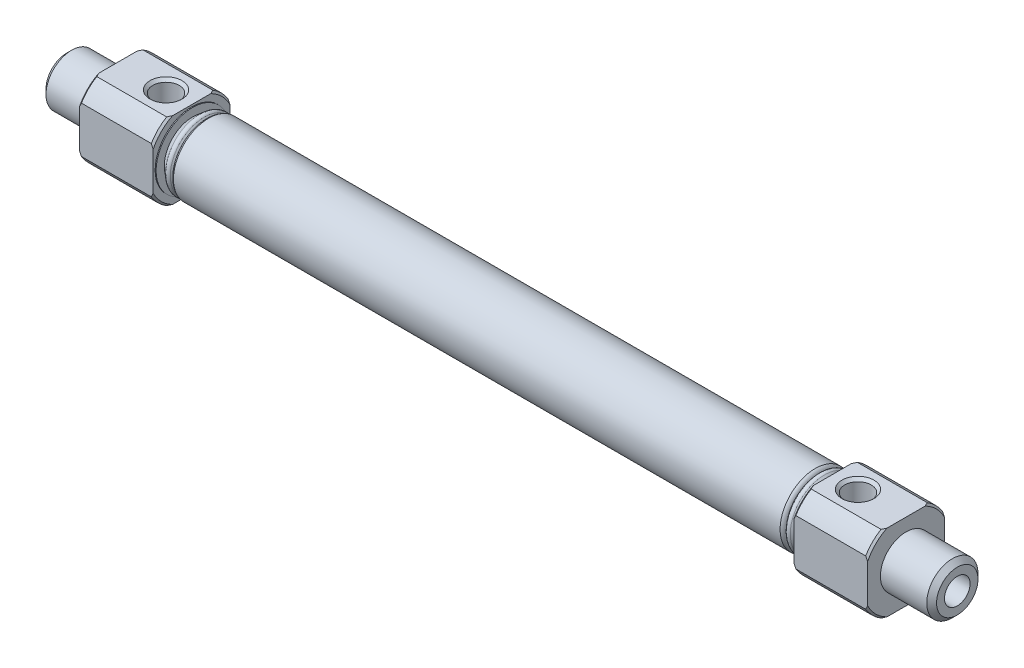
ISO-10303-21;
HEADER;
FILE_DESCRIPTION(('STEP AP214'),'2;1');
FILE_NAME('part.step','',(''),(''),'','','');
FILE_SCHEMA(('AUTOMOTIVE_DESIGN { 1 0 10303 214 1 1 1 1 }'));
ENDSEC;
DATA;
#1=APPLICATION_CONTEXT('core data for automotive mechanical design processes');
#2=APPLICATION_PROTOCOL_DEFINITION('international standard','automotive_design',2000,#1);
#3=PRODUCT_CONTEXT('',#1,'mechanical');
#4=PRODUCT('Part','Part','',(#3));
#5=PRODUCT_RELATED_PRODUCT_CATEGORY('part','',(#4));
#6=PRODUCT_DEFINITION_FORMATION('','',#4);
#7=PRODUCT_DEFINITION_CONTEXT('part definition',#1,'design');
#8=PRODUCT_DEFINITION('design','',#6,#7);
#9=PRODUCT_DEFINITION_SHAPE('','',#8);
#10=(LENGTH_UNIT() NAMED_UNIT(*) SI_UNIT(.MILLI.,.METRE.));
#11=(NAMED_UNIT(*) PLANE_ANGLE_UNIT() SI_UNIT($,.RADIAN.));
#12=(NAMED_UNIT(*) SI_UNIT($,.STERADIAN.) SOLID_ANGLE_UNIT());
#13=UNCERTAINTY_MEASURE_WITH_UNIT(LENGTH_MEASURE(1.E-05),#10,'distance_accuracy_value','');
#14=(GEOMETRIC_REPRESENTATION_CONTEXT(3) GLOBAL_UNCERTAINTY_ASSIGNED_CONTEXT((#13)) GLOBAL_UNIT_ASSIGNED_CONTEXT((#10,
#11,#12)) REPRESENTATION_CONTEXT('',''));
#15=CARTESIAN_POINT('',(0.,0.,0.));
#16=DIRECTION('',(0.,0.,1.));
#17=DIRECTION('',(1.,0.,0.));
#18=AXIS2_PLACEMENT_3D('',#15,#16,#17);
#19=CARTESIAN_POINT('',(139.,0.,0.));
#20=DIRECTION('',(-1.,0.,0.));
#21=DIRECTION('',(0.,0.,1.));
#22=AXIS2_PLACEMENT_3D('',#19,#20,#21);
#23=CYLINDRICAL_SURFACE('',#22,5.);
#24=CARTESIAN_POINT('',(25.5,0.,0.));
#25=DIRECTION('',(-1.,0.,0.));
#26=DIRECTION('',(0.,0.,1.));
#27=AXIS2_PLACEMENT_3D('',#24,#25,#26);
#28=CIRCLE('',#27,5.);
#29=CARTESIAN_POINT('',(25.5,0.,5.));
#30=VERTEX_POINT('',#29);
#31=EDGE_CURVE('E1446',#30,#30,#28,.F.);
#32=ORIENTED_EDGE('',*,*,#31,.F.);
#33=EDGE_LOOP('',(#32));
#34=FACE_BOUND('',#33,.T.);
#35=CARTESIAN_POINT('',(113.5,0.,0.));
#36=DIRECTION('',(-1.,0.,0.));
#37=DIRECTION('',(0.,0.,1.));
#38=AXIS2_PLACEMENT_3D('',#35,#36,#37);
#39=CIRCLE('',#38,5.);
#40=CARTESIAN_POINT('',(113.5,0.,5.));
#41=VERTEX_POINT('',#40);
#42=EDGE_CURVE('E20',#41,#41,#39,.T.);
#43=ORIENTED_EDGE('',*,*,#42,.F.);
#44=EDGE_LOOP('',(#43));
#45=FACE_BOUND('',#44,.T.);
#46=ADVANCED_FACE('F17',(#34,#45),#23,.F.);
#47=CARTESIAN_POINT('',(113.5,5.,0.));
#48=DIRECTION('',(-1.,0.,0.));
#49=DIRECTION('',(0.,0.,1.));
#50=AXIS2_PLACEMENT_3D('',#47,#48,#49);
#51=PLANE('',#50);
#52=CARTESIAN_POINT('',(113.5,0.,0.));
#53=DIRECTION('',(-1.,0.,0.));
#54=DIRECTION('',(0.,0.,1.));
#55=AXIS2_PLACEMENT_3D('',#52,#53,#54);
#56=CIRCLE('',#55,2.);
#57=CARTESIAN_POINT('',(113.5,0.,2.));
#58=VERTEX_POINT('',#57);
#59=EDGE_CURVE('E1450',#58,#58,#56,.F.);
#60=ORIENTED_EDGE('',*,*,#59,.T.);
#61=EDGE_LOOP('',(#60));
#62=FACE_BOUND('',#61,.T.);
#63=ORIENTED_EDGE('',*,*,#42,.T.);
#64=EDGE_LOOP('',(#63));
#65=FACE_BOUND('',#64,.T.);
#66=ADVANCED_FACE('F1420',(#62,#65),#51,.T.);
#67=CARTESIAN_POINT('',(139.,3.233,0.));
#68=DIRECTION('',(-1.,0.,0.));
#69=DIRECTION('',(0.,0.,1.));
#70=AXIS2_PLACEMENT_3D('',#67,#68,#69);
#71=PLANE('',#70);
#72=CARTESIAN_POINT('',(139.,0.,0.));
#73=DIRECTION('',(-1.,0.,0.));
#74=DIRECTION('',(0.,0.,1.));
#75=AXIS2_PLACEMENT_3D('',#72,#73,#74);
#76=CIRCLE('',#75,2.);
#77=CARTESIAN_POINT('',(139.,0.,2.));
#78=VERTEX_POINT('',#77);
#79=EDGE_CURVE('E265',#78,#78,#76,.T.);
#80=ORIENTED_EDGE('',*,*,#79,.T.);
#81=EDGE_LOOP('',(#80));
#82=FACE_BOUND('',#81,.T.);
#83=CARTESIAN_POINT('',(139.000000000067,0.,0.));
#84=DIRECTION('',(-1.,0.,0.));
#85=DIRECTION('',(0.,0.,1.));
#86=AXIS2_PLACEMENT_3D('',#83,#84,#85);
#87=CIRCLE('',#86,3.23299999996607);
#88=CARTESIAN_POINT('',(139.000000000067,0.,3.23299999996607));
#89=VERTEX_POINT('',#88);
#90=EDGE_CURVE('E427',#89,#89,#87,.T.);
#91=ORIENTED_EDGE('',*,*,#90,.F.);
#92=EDGE_LOOP('',(#91));
#93=FACE_BOUND('',#92,.T.);
#94=ADVANCED_FACE('F1410',(#82,#93),#71,.F.);
#95=CARTESIAN_POINT('',(25.5,2.,0.));
#96=DIRECTION('',(1.,0.,0.));
#97=DIRECTION('',(0.,0.,-1.));
#98=AXIS2_PLACEMENT_3D('',#95,#96,#97);
#99=PLANE('',#98);
#100=ORIENTED_EDGE('',*,*,#31,.T.);
#101=EDGE_LOOP('',(#100));
#102=FACE_BOUND('',#101,.T.);
#103=CARTESIAN_POINT('',(25.5,0.,0.));
#104=DIRECTION('',(-1.,0.,0.));
#105=DIRECTION('',(0.,0.,1.));
#106=AXIS2_PLACEMENT_3D('',#103,#104,#105);
#107=CIRCLE('',#106,2.);
#108=CARTESIAN_POINT('',(25.5,0.,2.));
#109=VERTEX_POINT('',#108);
#110=EDGE_CURVE('E498',#109,#109,#107,.T.);
#111=ORIENTED_EDGE('',*,*,#110,.T.);
#112=EDGE_LOOP('',(#111));
#113=FACE_BOUND('',#112,.T.);
#114=ADVANCED_FACE('F1400',(#102,#113),#99,.T.);
#115=CARTESIAN_POINT('',(0.,0.,0.));
#116=DIRECTION('',(1.,0.,0.));
#117=DIRECTION('',(0.,0.,-1.));
#118=AXIS2_PLACEMENT_3D('',#115,#116,#117);
#119=PLANE('',#118);
#120=CARTESIAN_POINT('',(0.,0.,0.));
#121=DIRECTION('',(-1.,0.,0.));
#122=DIRECTION('',(0.,0.,1.));
#123=AXIS2_PLACEMENT_3D('',#120,#121,#122);
#124=CIRCLE('',#123,2.);
#125=CARTESIAN_POINT('',(0.,0.,2.));
#126=VERTEX_POINT('',#125);
#127=EDGE_CURVE('E1458',#126,#126,#124,.F.);
#128=ORIENTED_EDGE('',*,*,#127,.T.);
#129=EDGE_LOOP('',(#128));
#130=FACE_BOUND('',#129,.T.);
#131=CARTESIAN_POINT('',(-5.6843418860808E-11,0.,0.));
#132=DIRECTION('',(1.,0.,0.));
#133=DIRECTION('',(0.,0.,-1.));
#134=AXIS2_PLACEMENT_3D('',#131,#132,#133);
#135=CIRCLE('',#134,3.23299999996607);
#136=CARTESIAN_POINT('',(-5.6843418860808E-11,0.,-3.23299999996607));
#137=VERTEX_POINT('',#136);
#138=EDGE_CURVE('E269',#137,#137,#135,.T.);
#139=ORIENTED_EDGE('',*,*,#138,.F.);
#140=EDGE_LOOP('',(#139));
#141=FACE_BOUND('',#140,.T.);
#142=ADVANCED_FACE('F1392',(#130,#141),#119,.F.);
#143=CARTESIAN_POINT('',(125.567,0.6,0.));
#144=DIRECTION('',(0.,1.,0.));
#145=DIRECTION('',(0.,0.,1.));
#146=AXIS2_PLACEMENT_3D('',#143,#144,#145);
#147=PLANE('',#146);
#148=CARTESIAN_POINT('',(123.5,0.6,0.));
#149=DIRECTION('',(0.,1.,0.));
#150=DIRECTION('',(0.,0.,1.));
#151=AXIS2_PLACEMENT_3D('',#148,#149,#150);
#152=CIRCLE('',#151,2.06700000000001);
#153=CARTESIAN_POINT('',(122.704708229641,0.599999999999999,1.90787840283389));
#154=VERTEX_POINT('',#153);
#155=CARTESIAN_POINT('',(124.295291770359,0.6,1.90787840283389));
#156=VERTEX_POINT('',#155);
#157=EDGE_CURVE('E251',#154,#156,#152,.T.);
#158=ORIENTED_EDGE('',*,*,#157,.T.);
#159=DIRECTION('',(-1.,0.,0.));
#160=VECTOR('',#159,1.);
#161=CARTESIAN_POINT('',(139.,0.6,1.90787840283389));
#162=LINE('',#161,#160);
#163=EDGE_CURVE('E261',#156,#154,#162,.T.);
#164=ORIENTED_EDGE('',*,*,#163,.T.);
#165=EDGE_LOOP('',(#158,#164));
#166=FACE_BOUND('',#165,.T.);
#167=ADVANCED_FACE('F262',(#166),#147,.T.);
#168=CARTESIAN_POINT('',(139.,0.,0.));
#169=DIRECTION('',(-1.,0.,0.));
#170=DIRECTION('',(0.,0.,1.));
#171=AXIS2_PLACEMENT_3D('',#168,#169,#170);
#172=CYLINDRICAL_SURFACE('',#171,2.);
#173=ORIENTED_EDGE('',*,*,#79,.F.);
#174=EDGE_LOOP('',(#173));
#175=FACE_BOUND('',#174,.T.);
#176=ORIENTED_EDGE('',*,*,#163,.F.);
#177=CARTESIAN_POINT('',(124.295291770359,0.6,1.90787840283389));
#178=CARTESIAN_POINT('',(124.319956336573,0.632652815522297,1.89760263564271));
#179=CARTESIAN_POINT('',(124.345013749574,0.664761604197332,1.88659072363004));
#180=CARTESIAN_POINT('',(124.395624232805,0.728028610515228,1.86309398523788));
#181=CARTESIAN_POINT('',(124.421177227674,0.759186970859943,1.85060938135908));
#182=CARTESIAN_POINT('',(124.498203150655,0.851513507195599,1.81091634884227));
#183=CARTESIAN_POINT('',(124.549996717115,0.911473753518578,1.78148754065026));
#184=CARTESIAN_POINT('',(124.653607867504,1.02912331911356,1.71623791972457));
#185=CARTESIAN_POINT('',(124.70541986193,1.0867817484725,1.68035252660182));
#186=CARTESIAN_POINT('',(124.80749671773,1.19899902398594,1.60220840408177));
#187=CARTESIAN_POINT('',(124.857762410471,1.25355954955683,1.55995317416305));
#188=CARTESIAN_POINT('',(124.978451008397,1.38352867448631,1.44783648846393));
#189=CARTESIAN_POINT('',(125.04753192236,1.45700703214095,1.37420792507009));
#190=CARTESIAN_POINT('',(125.177300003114,1.59415422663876,1.21237579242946));
#191=CARTESIAN_POINT('',(125.238019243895,1.65786066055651,1.12423093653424));
#192=CARTESIAN_POINT('',(125.335417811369,1.75966930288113,0.954495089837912));
#193=CARTESIAN_POINT('',(125.37444158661,1.80031601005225,0.875792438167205));
#194=CARTESIAN_POINT('',(125.443228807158,1.87182930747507,0.710192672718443));
#195=CARTESIAN_POINT('',(125.472993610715,1.90269733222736,0.623296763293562));
#196=CARTESIAN_POINT('',(125.521319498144,1.95276388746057,0.442263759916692));
#197=CARTESIAN_POINT('',(125.539779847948,1.97185750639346,0.348069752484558));
#198=CARTESIAN_POINT('',(125.563337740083,1.99621733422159,0.156293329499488));
#199=CARTESIAN_POINT('',(125.568448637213,2.0014973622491,0.0587143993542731));
#200=CARTESIAN_POINT('',(125.565088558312,1.99802435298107,-0.122031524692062));
#201=CARTESIAN_POINT('',(125.558440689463,1.99115499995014,-0.205280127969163));
#202=CARTESIAN_POINT('',(125.535482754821,1.96741205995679,-0.368955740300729));
#203=CARTESIAN_POINT('',(125.519171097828,1.95053682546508,-0.449382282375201));
#204=CARTESIAN_POINT('',(125.478015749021,1.90790154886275,-0.605346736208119));
#205=CARTESIAN_POINT('',(125.453186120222,1.88215615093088,-0.680892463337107));
#206=CARTESIAN_POINT('',(125.396381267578,1.82313912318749,-0.826020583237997));
#207=CARTESIAN_POINT('',(125.364406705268,1.78986819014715,-0.895603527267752));
#208=CARTESIAN_POINT('',(125.277613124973,1.6993123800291,-1.06066202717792));
#209=CARTESIAN_POINT('',(125.219256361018,1.63822772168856,-1.15222355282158));
#210=CARTESIAN_POINT('',(125.124995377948,1.53890521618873,-1.27854351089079));
#211=CARTESIAN_POINT('',(125.092342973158,1.50439679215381,-1.31892032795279));
#212=CARTESIAN_POINT('',(125.025196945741,1.43313604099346,-1.39601997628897));
#213=CARTESIAN_POINT('',(124.990703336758,1.39638373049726,-1.432742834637));
#214=CARTESIAN_POINT('',(124.903160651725,1.30260474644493,-1.51955936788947));
#215=CARTESIAN_POINT('',(124.849231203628,1.24439550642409,-1.5674918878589));
#216=CARTESIAN_POINT('',(124.73929101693,1.12425205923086,-1.65578419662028));
#217=CARTESIAN_POINT('',(124.68327853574,1.0623147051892,-1.69613746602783));
#218=CARTESIAN_POINT('',(124.571170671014,0.935830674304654,-1.76903437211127));
#219=CARTESIAN_POINT('',(124.515086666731,0.871330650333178,-1.80167630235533));
#220=CARTESIAN_POINT('',(124.431626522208,0.77185677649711,-1.84541208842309));
#221=CARTESIAN_POINT('',(124.403937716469,0.738270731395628,-1.85911128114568));
#222=CARTESIAN_POINT('',(124.349112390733,0.670000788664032,-1.88478659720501));
#223=CARTESIAN_POINT('',(124.321975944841,0.635316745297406,-1.89676249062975));
#224=CARTESIAN_POINT('',(124.295291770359,0.599999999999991,-1.90787840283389));
#225=B_SPLINE_CURVE_WITH_KNOTS('',3,(#177,#178,#179,#180,#181,#182,#183,#184,#185,#186,#187,
#188,#189,#190,#191,#192,#193,#194,#195,#196,#197,#198,#199,#200,#201,#202,#203,#204,#205,#206,
#207,#208,#209,#210,#211,#212,#213,#214,#215,#216,#217,#218,#219,#220,#221,#222,#223,#224),
.UNSPECIFIED.,.F.,.F.,(4,2,2,2,2,2,2,2,2,2,2,2,2,2,2,2,2,2,2,2,2,2,2,4),(0.,0.126543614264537,
0.253068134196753,0.506349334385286,0.762321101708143,1.01815275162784,1.39145172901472,
1.76327634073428,2.05256540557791,2.34181201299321,2.63359995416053,2.9250958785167,
3.17525855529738,3.42546243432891,3.67525520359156,3.92502485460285,4.29655635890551,
4.48347764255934,4.67039754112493,4.94803963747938,5.22591946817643,5.50003890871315,
5.63689601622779,5.77377136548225),.UNSPECIFIED.);
#226=CARTESIAN_POINT('',(124.295291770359,0.599999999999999,-1.90787840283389));
#227=VERTEX_POINT('',#226);
#228=EDGE_CURVE('E257',#156,#227,#225,.T.);
#229=ORIENTED_EDGE('',*,*,#228,.T.);
#230=DIRECTION('',(1.,0.,0.));
#231=VECTOR('',#230,1.);
#232=CARTESIAN_POINT('',(125.567,0.6,-1.90787840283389));
#233=LINE('',#232,#231);
#234=CARTESIAN_POINT('',(122.704708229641,0.6,-1.90787840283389));
#235=VERTEX_POINT('',#234);
#236=EDGE_CURVE('E264',#235,#227,#233,.T.);
#237=ORIENTED_EDGE('',*,*,#236,.F.);
#238=CARTESIAN_POINT('',(122.704708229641,0.6,-1.90787840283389));
#239=CARTESIAN_POINT('',(122.680043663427,0.632652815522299,-1.8976026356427));
#240=CARTESIAN_POINT('',(122.654986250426,0.664761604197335,-1.88659072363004));
#241=CARTESIAN_POINT('',(122.604375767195,0.72802861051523,-1.86309398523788));
#242=CARTESIAN_POINT('',(122.578822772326,0.759186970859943,-1.85060938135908));
#243=CARTESIAN_POINT('',(122.501796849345,0.851513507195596,-1.81091634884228));
#244=CARTESIAN_POINT('',(122.450003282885,0.911473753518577,-1.78148754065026));
#245=CARTESIAN_POINT('',(122.346392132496,1.02912331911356,-1.71623791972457));
#246=CARTESIAN_POINT('',(122.29458013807,1.0867817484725,-1.68035252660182));
#247=CARTESIAN_POINT('',(122.19250328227,1.19899902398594,-1.60220840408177));
#248=CARTESIAN_POINT('',(122.142237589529,1.25355954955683,-1.55995317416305));
#249=CARTESIAN_POINT('',(122.021548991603,1.38352867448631,-1.44783648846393));
#250=CARTESIAN_POINT('',(121.95246807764,1.45700703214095,-1.37420792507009));
#251=CARTESIAN_POINT('',(121.822699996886,1.59415422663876,-1.21237579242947));
#252=CARTESIAN_POINT('',(121.761980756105,1.65786066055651,-1.12423093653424));
#253=CARTESIAN_POINT('',(121.664582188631,1.75966930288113,-0.954495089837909));
#254=CARTESIAN_POINT('',(121.62555841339,1.80031601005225,-0.875792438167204));
#255=CARTESIAN_POINT('',(121.556771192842,1.87182930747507,-0.710192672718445));
#256=CARTESIAN_POINT('',(121.527006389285,1.90269733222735,-0.623296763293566));
#257=CARTESIAN_POINT('',(121.478680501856,1.95276388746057,-0.442263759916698));
#258=CARTESIAN_POINT('',(121.460220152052,1.97185750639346,-0.348069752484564));
#259=CARTESIAN_POINT('',(121.436662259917,1.99621733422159,-0.156293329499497));
#260=CARTESIAN_POINT('',(121.431551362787,2.0014973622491,-0.0587143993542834));
#261=CARTESIAN_POINT('',(121.434911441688,1.99802435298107,0.12203152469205));
#262=CARTESIAN_POINT('',(121.441559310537,1.99115499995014,0.205280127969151));
#263=CARTESIAN_POINT('',(121.464517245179,1.96741205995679,0.368955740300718));
#264=CARTESIAN_POINT('',(121.480828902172,1.95053682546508,0.44938228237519));
#265=CARTESIAN_POINT('',(121.521984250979,1.90790154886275,0.605346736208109));
#266=CARTESIAN_POINT('',(121.546813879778,1.88215615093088,0.680892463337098));
#267=CARTESIAN_POINT('',(121.603618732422,1.82313912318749,0.826020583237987));
#268=CARTESIAN_POINT('',(121.635593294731,1.78986819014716,0.895603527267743));
#269=CARTESIAN_POINT('',(121.722386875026,1.6993123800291,1.06066202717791));
#270=CARTESIAN_POINT('',(121.780743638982,1.63822772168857,1.15222355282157));
#271=CARTESIAN_POINT('',(121.875004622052,1.53890521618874,1.27854351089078));
#272=CARTESIAN_POINT('',(121.907657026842,1.50439679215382,1.31892032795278));
#273=CARTESIAN_POINT('',(121.974803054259,1.43313604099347,1.39601997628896));
#274=CARTESIAN_POINT('',(122.009296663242,1.39638373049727,1.43274283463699));
#275=CARTESIAN_POINT('',(122.096839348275,1.30260474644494,1.51955936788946));
#276=CARTESIAN_POINT('',(122.150768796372,1.2443955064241,1.56749188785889));
#277=CARTESIAN_POINT('',(122.26070898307,1.12425205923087,1.65578419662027));
#278=CARTESIAN_POINT('',(122.31672146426,1.06231470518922,1.69613746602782));
#279=CARTESIAN_POINT('',(122.428829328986,0.935830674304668,1.76903437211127));
#280=CARTESIAN_POINT('',(122.484913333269,0.87133065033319,1.80167630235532));
#281=CARTESIAN_POINT('',(122.568373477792,0.771856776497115,1.84541208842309));
#282=CARTESIAN_POINT('',(122.596062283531,0.738270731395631,1.85911128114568));
#283=CARTESIAN_POINT('',(122.650887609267,0.670000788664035,1.88478659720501));
#284=CARTESIAN_POINT('',(122.678024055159,0.635316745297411,1.89676249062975));
#285=CARTESIAN_POINT('',(122.704708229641,0.600000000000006,1.90787840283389));
#286=B_SPLINE_CURVE_WITH_KNOTS('',3,(#238,#239,#240,#241,#242,#243,#244,#245,#246,#247,#248,
#249,#250,#251,#252,#253,#254,#255,#256,#257,#258,#259,#260,#261,#262,#263,#264,#265,#266,#267,
#268,#269,#270,#271,#272,#273,#274,#275,#276,#277,#278,#279,#280,#281,#282,#283,#284,#285),
.UNSPECIFIED.,.F.,.F.,(4,2,2,2,2,2,2,2,2,2,2,2,2,2,2,2,2,2,2,2,2,2,2,4),(0.,0.12654361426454,
0.253068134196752,0.506349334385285,0.762321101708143,1.01815275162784,1.39145172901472,
1.76327634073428,2.05256540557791,2.34181201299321,2.63359995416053,2.9250958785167,
3.17525855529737,3.42546243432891,3.67525520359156,3.92502485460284,4.2965563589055,
4.48347764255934,4.67039754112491,4.94803963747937,5.22591946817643,5.50003890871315,
5.63689601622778,5.77377136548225),.UNSPECIFIED.);
#287=EDGE_CURVE('E256',#235,#154,#286,.T.);
#288=ORIENTED_EDGE('',*,*,#287,.T.);
#289=EDGE_LOOP('',(#176,#229,#237,#288));
#290=FACE_BOUND('',#289,.T.);
#291=ORIENTED_EDGE('',*,*,#59,.F.);
#292=EDGE_LOOP('',(#291));
#293=FACE_BOUND('',#292,.T.);
#294=ADVANCED_FACE('F267',(#175,#290,#293),#172,.F.);
#295=CARTESIAN_POINT('',(125.567,0.6,0.));
#296=DIRECTION('',(0.,1.,0.));
#297=DIRECTION('',(0.,0.,1.));
#298=AXIS2_PLACEMENT_3D('',#295,#296,#297);
#299=PLANE('',#298);
#300=CARTESIAN_POINT('',(123.5,0.6,0.));
#301=DIRECTION('',(0.,1.,0.));
#302=DIRECTION('',(0.,0.,1.));
#303=AXIS2_PLACEMENT_3D('',#300,#301,#302);
#304=CIRCLE('',#303,2.06700000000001);
#305=EDGE_CURVE('E245',#227,#235,#304,.T.);
#306=ORIENTED_EDGE('',*,*,#305,.T.);
#307=ORIENTED_EDGE('',*,*,#236,.T.);
#308=EDGE_LOOP('',(#306,#307));
#309=FACE_BOUND('',#308,.T.);
#310=ADVANCED_FACE('F1367',(#309),#299,.T.);
#311=CARTESIAN_POINT('',(138.233000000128,0.,0.));
#312=DIRECTION('',(-1.,0.,0.));
#313=DIRECTION('',(0.,0.,1.));
#314=AXIS2_PLACEMENT_3D('',#311,#312,#313);
#315=CONICAL_SURFACE('',#314,3.99999999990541,0.785398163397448);
#316=ORIENTED_EDGE('',*,*,#90,.T.);
#317=EDGE_LOOP('',(#316));
#318=FACE_BOUND('',#317,.T.);
#319=CARTESIAN_POINT('',(138.233,0.,0.));
#320=DIRECTION('',(-1.,0.,0.));
#321=DIRECTION('',(0.,0.,1.));
#322=AXIS2_PLACEMENT_3D('',#319,#320,#321);
#323=CIRCLE('',#322,4.);
#324=CARTESIAN_POINT('',(138.233,0.,4.));
#325=VERTEX_POINT('',#324);
#326=EDGE_CURVE('E472',#325,#325,#323,.T.);
#327=ORIENTED_EDGE('',*,*,#326,.F.);
#328=EDGE_LOOP('',(#327));
#329=FACE_BOUND('',#328,.T.);
#330=ADVANCED_FACE('F1358',(#318,#329),#315,.T.);
#331=CARTESIAN_POINT('',(17.567,0.6,0.));
#332=DIRECTION('',(0.,1.,0.));
#333=DIRECTION('',(0.,0.,1.));
#334=AXIS2_PLACEMENT_3D('',#331,#332,#333);
#335=PLANE('',#334);
#336=CARTESIAN_POINT('',(15.5,0.6,0.));
#337=DIRECTION('',(0.,1.,0.));
#338=DIRECTION('',(0.,0.,1.));
#339=AXIS2_PLACEMENT_3D('',#336,#337,#338);
#340=CIRCLE('',#339,2.067);
#341=CARTESIAN_POINT('',(14.7047082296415,0.6,1.90787840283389));
#342=VERTEX_POINT('',#341);
#343=CARTESIAN_POINT('',(16.2952917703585,0.6,1.90787840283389));
#344=VERTEX_POINT('',#343);
#345=EDGE_CURVE('E308',#342,#344,#340,.T.);
#346=ORIENTED_EDGE('',*,*,#345,.T.);
#347=DIRECTION('',(-1.,0.,0.));
#348=VECTOR('',#347,1.);
#349=CARTESIAN_POINT('',(139.,0.6,1.90787840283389));
#350=LINE('',#349,#348);
#351=EDGE_CURVE('E490',#344,#342,#350,.T.);
#352=ORIENTED_EDGE('',*,*,#351,.T.);
#353=EDGE_LOOP('',(#346,#352));
#354=FACE_BOUND('',#353,.T.);
#355=ADVANCED_FACE('F1349',(#354),#335,.T.);
#356=CARTESIAN_POINT('',(139.,0.,0.));
#357=DIRECTION('',(-1.,0.,0.));
#358=DIRECTION('',(0.,0.,1.));
#359=AXIS2_PLACEMENT_3D('',#356,#357,#358);
#360=CYLINDRICAL_SURFACE('',#359,2.);
#361=ORIENTED_EDGE('',*,*,#110,.F.);
#362=EDGE_LOOP('',(#361));
#363=FACE_BOUND('',#362,.T.);
#364=ORIENTED_EDGE('',*,*,#351,.F.);
#365=CARTESIAN_POINT('',(16.2952917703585,0.6,1.90787840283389));
#366=CARTESIAN_POINT('',(16.319956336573,0.632652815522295,1.89760263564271));
#367=CARTESIAN_POINT('',(16.3450137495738,0.664761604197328,1.88659072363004));
#368=CARTESIAN_POINT('',(16.3956242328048,0.728028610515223,1.86309398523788));
#369=CARTESIAN_POINT('',(16.4211772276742,0.759186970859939,1.85060938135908));
#370=CARTESIAN_POINT('',(16.4982031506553,0.851513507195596,1.81091634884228));
#371=CARTESIAN_POINT('',(16.5499967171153,0.911473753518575,1.78148754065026));
#372=CARTESIAN_POINT('',(16.6536078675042,1.02912331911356,1.71623791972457));
#373=CARTESIAN_POINT('',(16.7054198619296,1.0867817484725,1.68035252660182));
#374=CARTESIAN_POINT('',(16.8074967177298,1.19899902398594,1.60220840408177));
#375=CARTESIAN_POINT('',(16.8577624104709,1.25355954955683,1.55995317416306));
#376=CARTESIAN_POINT('',(16.978451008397,1.3835286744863,1.44783648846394));
#377=CARTESIAN_POINT('',(17.0475319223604,1.45700703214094,1.3742079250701));
#378=CARTESIAN_POINT('',(17.1773000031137,1.59415422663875,1.21237579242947));
#379=CARTESIAN_POINT('',(17.2380192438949,1.65786066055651,1.12423093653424));
#380=CARTESIAN_POINT('',(17.3354178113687,1.75966930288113,0.954495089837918));
#381=CARTESIAN_POINT('',(17.3744415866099,1.80031601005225,0.875792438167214));
#382=CARTESIAN_POINT('',(17.4432288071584,1.87182930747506,0.710192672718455));
#383=CARTESIAN_POINT('',(17.4729936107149,1.90269733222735,0.623296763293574));
#384=CARTESIAN_POINT('',(17.521319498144,1.95276388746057,0.442263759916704));
#385=CARTESIAN_POINT('',(17.539779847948,1.97185750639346,0.34806975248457));
#386=CARTESIAN_POINT('',(17.5633377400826,1.99621733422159,0.156293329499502));
#387=CARTESIAN_POINT('',(17.5684486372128,2.0014973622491,0.0587143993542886));
#388=CARTESIAN_POINT('',(17.5650885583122,1.99802435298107,-0.122031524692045));
#389=CARTESIAN_POINT('',(17.5584406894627,1.99115499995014,-0.205280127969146));
#390=CARTESIAN_POINT('',(17.5354827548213,1.9674120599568,-0.368955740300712));
#391=CARTESIAN_POINT('',(17.5191710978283,1.95053682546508,-0.449382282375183));
#392=CARTESIAN_POINT('',(17.4780157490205,1.90790154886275,-0.605346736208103));
#393=CARTESIAN_POINT('',(17.4531861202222,1.88215615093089,-0.680892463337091));
#394=CARTESIAN_POINT('',(17.3963812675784,1.8231391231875,-0.826020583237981));
#395=CARTESIAN_POINT('',(17.3644067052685,1.78986819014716,-0.895603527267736));
#396=CARTESIAN_POINT('',(17.2776131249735,1.69931238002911,-1.0606620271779));
#397=CARTESIAN_POINT('',(17.219256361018,1.63822772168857,-1.15222355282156));
#398=CARTESIAN_POINT('',(17.1249953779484,1.53890521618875,-1.27854351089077));
#399=CARTESIAN_POINT('',(17.0923429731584,1.50439679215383,-1.31892032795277));
#400=CARTESIAN_POINT('',(17.0251969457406,1.43313604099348,-1.39601997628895));
#401=CARTESIAN_POINT('',(16.990703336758,1.39638373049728,-1.43274283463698));
#402=CARTESIAN_POINT('',(16.9031606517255,1.30260474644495,-1.51955936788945));
#403=CARTESIAN_POINT('',(16.8492312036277,1.24439550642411,-1.56749188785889));
#404=CARTESIAN_POINT('',(16.7392910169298,1.12425205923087,-1.65578419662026));
#405=CARTESIAN_POINT('',(16.6832785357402,1.06231470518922,-1.69613746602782));
#406=CARTESIAN_POINT('',(16.5711706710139,0.935830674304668,-1.76903437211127));
#407=CARTESIAN_POINT('',(16.5150866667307,0.871330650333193,-1.80167630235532));
#408=CARTESIAN_POINT('',(16.4316265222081,0.771856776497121,-1.84541208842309));
#409=CARTESIAN_POINT('',(16.4039377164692,0.738270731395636,-1.85911128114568));
#410=CARTESIAN_POINT('',(16.3491123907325,0.670000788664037,-1.88478659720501));
#411=CARTESIAN_POINT('',(16.3219759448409,0.635316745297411,-1.89676249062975));
#412=CARTESIAN_POINT('',(16.2952917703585,0.600000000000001,-1.90787840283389));
#413=B_SPLINE_CURVE_WITH_KNOTS('',3,(#365,#366,#367,#368,#369,#370,#371,#372,#373,#374,#375,
#376,#377,#378,#379,#380,#381,#382,#383,#384,#385,#386,#387,#388,#389,#390,#391,#392,#393,#394,
#395,#396,#397,#398,#399,#400,#401,#402,#403,#404,#405,#406,#407,#408,#409,#410,#411,#412),
.UNSPECIFIED.,.F.,.F.,(4,2,2,2,2,2,2,2,2,2,2,2,2,2,2,2,2,2,2,2,2,2,2,4),(0.,0.126543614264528,
0.253068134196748,0.506349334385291,0.762321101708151,1.01815275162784,1.39145172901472,
1.76327634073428,2.05256540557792,2.34181201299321,2.63359995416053,2.9250958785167,
3.17525855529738,3.42546243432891,3.67525520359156,3.92502485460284,4.29655635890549,
4.48347764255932,4.67039754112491,4.94803963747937,5.22591946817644,5.50003890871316,
5.6368960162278,5.77377136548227),.UNSPECIFIED.);
#414=CARTESIAN_POINT('',(16.2952917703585,0.599999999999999,-1.90787840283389));
#415=VERTEX_POINT('',#414);
#416=EDGE_CURVE('E326',#344,#415,#413,.T.);
#417=ORIENTED_EDGE('',*,*,#416,.T.);
#418=DIRECTION('',(1.,0.,0.));
#419=VECTOR('',#418,1.);
#420=CARTESIAN_POINT('',(17.567,0.6,-1.90787840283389));
#421=LINE('',#420,#419);
#422=CARTESIAN_POINT('',(14.7047082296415,0.6,-1.90787840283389));
#423=VERTEX_POINT('',#422);
#424=EDGE_CURVE('E272',#423,#415,#421,.T.);
#425=ORIENTED_EDGE('',*,*,#424,.F.);
#426=CARTESIAN_POINT('',(14.7047082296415,0.6,-1.90787840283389));
#427=CARTESIAN_POINT('',(14.680043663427,0.632652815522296,-1.89760263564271));
#428=CARTESIAN_POINT('',(14.6549862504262,0.66476160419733,-1.88659072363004));
#429=CARTESIAN_POINT('',(14.6043757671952,0.728028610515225,-1.86309398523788));
#430=CARTESIAN_POINT('',(14.5788227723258,0.759186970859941,-1.85060938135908));
#431=CARTESIAN_POINT('',(14.5017968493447,0.851513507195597,-1.81091634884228));
#432=CARTESIAN_POINT('',(14.4500032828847,0.911473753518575,-1.78148754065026));
#433=CARTESIAN_POINT('',(14.3463921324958,1.02912331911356,-1.71623791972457));
#434=CARTESIAN_POINT('',(14.2945801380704,1.0867817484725,-1.68035252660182));
#435=CARTESIAN_POINT('',(14.1925032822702,1.19899902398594,-1.60220840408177));
#436=CARTESIAN_POINT('',(14.1422375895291,1.25355954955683,-1.55995317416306));
#437=CARTESIAN_POINT('',(14.021548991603,1.3835286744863,-1.44783648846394));
#438=CARTESIAN_POINT('',(13.9524680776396,1.45700703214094,-1.3742079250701));
#439=CARTESIAN_POINT('',(13.8226999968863,1.59415422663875,-1.21237579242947));
#440=CARTESIAN_POINT('',(13.7619807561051,1.65786066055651,-1.12423093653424));
#441=CARTESIAN_POINT('',(13.6645821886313,1.75966930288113,-0.954495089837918));
#442=CARTESIAN_POINT('',(13.6255584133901,1.80031601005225,-0.875792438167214));
#443=CARTESIAN_POINT('',(13.5567711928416,1.87182930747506,-0.710192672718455));
#444=CARTESIAN_POINT('',(13.5270063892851,1.90269733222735,-0.623296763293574));
#445=CARTESIAN_POINT('',(13.478680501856,1.95276388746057,-0.442263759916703));
#446=CARTESIAN_POINT('',(13.460220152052,1.97185750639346,-0.34806975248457));
#447=CARTESIAN_POINT('',(13.4366622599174,1.99621733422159,-0.156293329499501));
#448=CARTESIAN_POINT('',(13.4315513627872,2.0014973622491,-0.0587143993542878));
#449=CARTESIAN_POINT('',(13.4349114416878,1.99802435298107,0.122031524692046));
#450=CARTESIAN_POINT('',(13.4415593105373,1.99115499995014,0.205280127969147));
#451=CARTESIAN_POINT('',(13.4645172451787,1.9674120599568,0.368955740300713));
#452=CARTESIAN_POINT('',(13.4808289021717,1.95053682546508,0.449382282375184));
#453=CARTESIAN_POINT('',(13.5219842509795,1.90790154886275,0.605346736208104));
#454=CARTESIAN_POINT('',(13.5468138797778,1.88215615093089,0.680892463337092));
#455=CARTESIAN_POINT('',(13.6036187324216,1.8231391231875,0.826020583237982));
#456=CARTESIAN_POINT('',(13.6355932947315,1.78986819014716,0.895603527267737));
#457=CARTESIAN_POINT('',(13.7223868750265,1.69931238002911,1.0606620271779));
#458=CARTESIAN_POINT('',(13.7807436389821,1.63822772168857,1.15222355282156));
#459=CARTESIAN_POINT('',(13.8750046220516,1.53890521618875,1.27854351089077));
#460=CARTESIAN_POINT('',(13.9076570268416,1.50439679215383,1.31892032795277));
#461=CARTESIAN_POINT('',(13.9748030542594,1.43313604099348,1.39601997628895));
#462=CARTESIAN_POINT('',(14.009296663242,1.39638373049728,1.43274283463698));
#463=CARTESIAN_POINT('',(14.0968393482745,1.30260474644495,1.51955936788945));
#464=CARTESIAN_POINT('',(14.1507687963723,1.24439550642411,1.56749188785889));
#465=CARTESIAN_POINT('',(14.2607089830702,1.12425205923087,1.65578419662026));
#466=CARTESIAN_POINT('',(14.3167214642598,1.06231470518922,1.69613746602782));
#467=CARTESIAN_POINT('',(14.4288293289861,0.935830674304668,1.76903437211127));
#468=CARTESIAN_POINT('',(14.4849133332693,0.871330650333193,1.80167630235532));
#469=CARTESIAN_POINT('',(14.5683734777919,0.77185677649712,1.84541208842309));
#470=CARTESIAN_POINT('',(14.5960622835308,0.738270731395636,1.85911128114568));
#471=CARTESIAN_POINT('',(14.6508876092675,0.670000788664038,1.88478659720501));
#472=CARTESIAN_POINT('',(14.6780240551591,0.635316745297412,1.89676249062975));
#473=CARTESIAN_POINT('',(14.7047082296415,0.600000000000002,1.90787840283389));
#474=B_SPLINE_CURVE_WITH_KNOTS('',3,(#426,#427,#428,#429,#430,#431,#432,#433,#434,#435,#436,
#437,#438,#439,#440,#441,#442,#443,#444,#445,#446,#447,#448,#449,#450,#451,#452,#453,#454,#455,
#456,#457,#458,#459,#460,#461,#462,#463,#464,#465,#466,#467,#468,#469,#470,#471,#472,#473),
.UNSPECIFIED.,.F.,.F.,(4,2,2,2,2,2,2,2,2,2,2,2,2,2,2,2,2,2,2,2,2,2,2,4),(0.,0.126543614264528,
0.253068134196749,0.506349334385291,0.762321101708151,1.01815275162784,1.39145172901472,
1.76327634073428,2.05256540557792,2.34181201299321,2.63359995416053,2.9250958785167,
3.17525855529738,3.42546243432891,3.67525520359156,3.92502485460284,4.29655635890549,
4.48347764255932,4.67039754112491,4.94803963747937,5.22591946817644,5.50003890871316,
5.6368960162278,5.77377136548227),.UNSPECIFIED.);
#475=EDGE_CURVE('E300',#423,#342,#474,.T.);
#476=ORIENTED_EDGE('',*,*,#475,.T.);
#477=EDGE_LOOP('',(#364,#417,#425,#476));
#478=FACE_BOUND('',#477,.T.);
#479=ORIENTED_EDGE('',*,*,#127,.F.);
#480=EDGE_LOOP('',(#479));
#481=FACE_BOUND('',#480,.T.);
#482=ADVANCED_FACE('F311',(#363,#478,#481),#360,.F.);
#483=CARTESIAN_POINT('',(17.567,0.6,0.));
#484=DIRECTION('',(0.,1.,0.));
#485=DIRECTION('',(0.,0.,1.));
#486=AXIS2_PLACEMENT_3D('',#483,#484,#485);
#487=PLANE('',#486);
#488=CARTESIAN_POINT('',(15.5,0.6,0.));
#489=DIRECTION('',(0.,1.,0.));
#490=DIRECTION('',(0.,0.,1.));
#491=AXIS2_PLACEMENT_3D('',#488,#489,#490);
#492=CIRCLE('',#491,2.067);
#493=EDGE_CURVE('E331',#415,#423,#492,.T.);
#494=ORIENTED_EDGE('',*,*,#493,.T.);
#495=ORIENTED_EDGE('',*,*,#424,.T.);
#496=EDGE_LOOP('',(#494,#495));
#497=FACE_BOUND('',#496,.T.);
#498=ADVANCED_FACE('F1332',(#497),#487,.T.);
#499=CARTESIAN_POINT('',(0.766999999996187,0.,0.));
#500=DIRECTION('',(1.,0.,0.));
#501=DIRECTION('',(0.,0.,-1.));
#502=AXIS2_PLACEMENT_3D('',#499,#500,#501);
#503=CONICAL_SURFACE('',#502,4.0000000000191,0.785398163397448);
#504=ORIENTED_EDGE('',*,*,#138,.T.);
#505=EDGE_LOOP('',(#504));
#506=FACE_BOUND('',#505,.T.);
#507=CARTESIAN_POINT('',(0.767,0.,0.));
#508=DIRECTION('',(-1.,0.,0.));
#509=DIRECTION('',(0.,0.,1.));
#510=AXIS2_PLACEMENT_3D('',#507,#508,#509);
#511=CIRCLE('',#510,4.);
#512=CARTESIAN_POINT('',(0.767,0.,4.));
#513=VERTEX_POINT('',#512);
#514=EDGE_CURVE('E333',#513,#513,#511,.F.);
#515=ORIENTED_EDGE('',*,*,#514,.F.);
#516=EDGE_LOOP('',(#515));
#517=FACE_BOUND('',#516,.T.);
#518=ADVANCED_FACE('F289',(#506,#517),#503,.T.);
#519=CARTESIAN_POINT('',(123.5,0.6,0.));
#520=DIRECTION('',(0.,1.,0.));
#521=DIRECTION('',(0.,0.,1.));
#522=AXIS2_PLACEMENT_3D('',#519,#520,#521);
#523=CYLINDRICAL_SURFACE('',#522,2.06700000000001);
#524=ORIENTED_EDGE('',*,*,#157,.F.);
#525=ORIENTED_EDGE('',*,*,#287,.F.);
#526=ORIENTED_EDGE('',*,*,#305,.F.);
#527=ORIENTED_EDGE('',*,*,#228,.F.);
#528=EDGE_LOOP('',(#524,#525,#526,#527));
#529=FACE_BOUND('',#528,.T.);
#530=CARTESIAN_POINT('',(123.5,5.56699999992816,0.));
#531=DIRECTION('',(0.,1.,0.));
#532=DIRECTION('',(0.,0.,1.));
#533=AXIS2_PLACEMENT_3D('',#530,#531,#532);
#534=CIRCLE('',#533,2.06700000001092);
#535=CARTESIAN_POINT('',(123.5,5.56699999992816,2.06700000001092));
#536=VERTEX_POINT('',#535);
#537=EDGE_CURVE('E654',#536,#536,#534,.T.);
#538=ORIENTED_EDGE('',*,*,#537,.T.);
#539=EDGE_LOOP('',(#538));
#540=FACE_BOUND('',#539,.T.);
#541=ADVANCED_FACE('F253',(#529,#540),#523,.F.);
#542=CARTESIAN_POINT('',(130.7,0.,0.));
#543=DIRECTION('',(-1.,0.,0.));
#544=DIRECTION('',(0.,0.,1.));
#545=AXIS2_PLACEMENT_3D('',#542,#543,#544);
#546=CONICAL_SURFACE('',#545,7.,0.785398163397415);
#547=CARTESIAN_POINT('',(131.,6.,2.98161030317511));
#548=CARTESIAN_POINT('',(130.988535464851,5.99999999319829,3.007372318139));
#549=CARTESIAN_POINT('',(130.976971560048,5.99999993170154,3.03309006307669));
#550=CARTESIAN_POINT('',(130.953577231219,5.99999976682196,3.08459929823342));
#551=CARTESIAN_POINT('',(130.941745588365,5.99999966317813,3.11039023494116));
#552=CARTESIAN_POINT('',(130.917815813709,5.99999948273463,3.16204931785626));
#553=CARTESIAN_POINT('',(130.905716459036,5.99999940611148,3.18791689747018));
#554=CARTESIAN_POINT('',(130.881251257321,5.99999930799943,3.23973266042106));
#555=CARTESIAN_POINT('',(130.86888418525,5.99999928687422,3.26568026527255));
#556=CARTESIAN_POINT('',(130.843883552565,5.99999930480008,3.3176593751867));
#557=CARTESIAN_POINT('',(130.831248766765,5.99999934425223,3.34369029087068));
#558=CARTESIAN_POINT('',(130.805712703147,5.99999946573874,3.39583923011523));
#559=CARTESIAN_POINT('',(130.792810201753,5.99999954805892,3.4219566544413));
#560=CARTESIAN_POINT('',(130.766738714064,5.99999972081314,3.47428172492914));
#561=CARTESIAN_POINT('',(130.753568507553,5.9999998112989,3.50048876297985));
#562=CARTESIAN_POINT('',(130.726961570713,5.99999995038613,3.55299609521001));
#563=CARTESIAN_POINT('',(130.71352362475,5.99999999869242,3.57929577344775));
#564=CARTESIAN_POINT('',(130.7,6.,3.60555127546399));
#565=B_SPLINE_CURVE_WITH_KNOTS('',3,(#547,#548,#549,#550,#551,#552,#553,#554,#555,#556,#557,
#558,#559,#560,#561,#562,#563,#564),.UNSPECIFIED.,.F.,.F.,(4,2,2,2,2,2,2,2,4),(0.,
0.0845931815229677,0.169718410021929,0.255389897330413,0.341621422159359,0.428426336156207,
0.515817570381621,0.60380764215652,0.692408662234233),.UNSPECIFIED.);
#566=CARTESIAN_POINT('',(131.,6.,2.98161030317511));
#567=VERTEX_POINT('',#566);
#568=CARTESIAN_POINT('',(130.7,6.,3.60555127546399));
#569=VERTEX_POINT('',#568);
#570=EDGE_CURVE('E430',#567,#569,#565,.T.);
#571=ORIENTED_EDGE('',*,*,#570,.T.);
#572=CARTESIAN_POINT('',(130.7,0.,0.));
#573=DIRECTION('',(-1.,0.,0.));
#574=DIRECTION('',(0.,0.,1.));
#575=AXIS2_PLACEMENT_3D('',#572,#573,#574);
#576=CIRCLE('',#575,7.);
#577=CARTESIAN_POINT('',(130.7,3.60555127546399,6.));
#578=VERTEX_POINT('',#577);
#579=EDGE_CURVE('E646',#578,#569,#576,.T.);
#580=ORIENTED_EDGE('',*,*,#579,.F.);
#581=CARTESIAN_POINT('',(130.7,3.60555127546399,6.));
#582=CARTESIAN_POINT('',(130.71352362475,3.57929577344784,5.99999999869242));
#583=CARTESIAN_POINT('',(130.726961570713,3.5529960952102,5.99999995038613));
#584=CARTESIAN_POINT('',(130.753568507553,3.50048876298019,5.99999981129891));
#585=CARTESIAN_POINT('',(130.766738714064,3.47428172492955,5.99999972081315));
#586=CARTESIAN_POINT('',(130.792810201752,3.42195665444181,5.99999954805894));
#587=CARTESIAN_POINT('',(130.805712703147,3.39583923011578,5.99999946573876));
#588=CARTESIAN_POINT('',(130.831248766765,3.34369029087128,5.99999934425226));
#589=CARTESIAN_POINT('',(130.843883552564,3.31765937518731,5.99999930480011));
#590=CARTESIAN_POINT('',(130.868884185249,3.26568026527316,5.99999928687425));
#591=CARTESIAN_POINT('',(130.881251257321,3.23973266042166,5.99999930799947));
#592=CARTESIAN_POINT('',(130.905716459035,3.18791689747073,5.99999940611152));
#593=CARTESIAN_POINT('',(130.917815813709,3.16204931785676,5.99999948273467));
#594=CARTESIAN_POINT('',(130.941745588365,3.11039023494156,5.99999966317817));
#595=CARTESIAN_POINT('',(130.953577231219,3.08459929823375,5.99999976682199));
#596=CARTESIAN_POINT('',(130.976971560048,3.03309006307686,5.99999993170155));
#597=CARTESIAN_POINT('',(130.988535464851,3.00737231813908,5.99999999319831));
#598=CARTESIAN_POINT('',(131.,2.98161030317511,6.));
#599=B_SPLINE_CURVE_WITH_KNOTS('',3,(#581,#582,#583,#584,#585,#586,#587,#588,#589,#590,#591,
#592,#593,#594,#595,#596,#597,#598),.UNSPECIFIED.,.F.,.F.,(4,2,2,2,2,2,2,2,4),(0.,
0.0886010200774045,0.176591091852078,0.263982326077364,0.350787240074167,0.437018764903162,
0.522690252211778,0.60781548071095,0.692408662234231),.UNSPECIFIED.);
#600=CARTESIAN_POINT('',(131.,2.98161030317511,6.));
#601=VERTEX_POINT('',#600);
#602=EDGE_CURVE('E299',#578,#601,#599,.T.);
#603=ORIENTED_EDGE('',*,*,#602,.T.);
#604=CARTESIAN_POINT('',(131.,0.,0.));
#605=DIRECTION('',(-1.,0.,0.));
#606=DIRECTION('',(0.,0.,1.));
#607=AXIS2_PLACEMENT_3D('',#604,#605,#606);
#608=CIRCLE('',#607,6.7);
#609=EDGE_CURVE('E337',#567,#601,#608,.F.);
#610=ORIENTED_EDGE('',*,*,#609,.F.);
#611=EDGE_LOOP('',(#571,#580,#603,#610));
#612=FACE_BOUND('',#611,.T.);
#613=ADVANCED_FACE('F288',(#612),#546,.T.);
#614=CARTESIAN_POINT('',(130.7,0.,0.));
#615=DIRECTION('',(-1.,0.,0.));
#616=DIRECTION('',(0.,0.,1.));
#617=AXIS2_PLACEMENT_3D('',#614,#615,#616);
#618=CONICAL_SURFACE('',#617,7.,0.785398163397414);
#619=CARTESIAN_POINT('',(130.7,-6.,3.60555127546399));
#620=CARTESIAN_POINT('',(130.71352362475,-5.99999999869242,3.57929577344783));
#621=CARTESIAN_POINT('',(130.726961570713,-5.99999995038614,3.55299609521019));
#622=CARTESIAN_POINT('',(130.753568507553,-5.99999981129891,3.50048876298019));
#623=CARTESIAN_POINT('',(130.766738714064,-5.99999972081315,3.47428172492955));
#624=CARTESIAN_POINT('',(130.792810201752,-5.99999954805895,3.42195665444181));
#625=CARTESIAN_POINT('',(130.805712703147,-5.99999946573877,3.39583923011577));
#626=CARTESIAN_POINT('',(130.831248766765,-5.99999934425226,3.34369029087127));
#627=CARTESIAN_POINT('',(130.843883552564,-5.99999930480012,3.31765937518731));
#628=CARTESIAN_POINT('',(130.868884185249,-5.99999928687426,3.26568026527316));
#629=CARTESIAN_POINT('',(130.881251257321,-5.99999930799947,3.23973266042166));
#630=CARTESIAN_POINT('',(130.905716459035,-5.99999940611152,3.18791689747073));
#631=CARTESIAN_POINT('',(130.917815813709,-5.99999948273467,3.16204931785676));
#632=CARTESIAN_POINT('',(130.941745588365,-5.99999966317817,3.11039023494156));
#633=CARTESIAN_POINT('',(130.953577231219,-5.99999976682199,3.08459929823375));
#634=CARTESIAN_POINT('',(130.976971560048,-5.99999993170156,3.03309006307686));
#635=CARTESIAN_POINT('',(130.988535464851,-5.99999999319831,3.00737231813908));
#636=CARTESIAN_POINT('',(131.,-6.,2.98161030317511));
#637=B_SPLINE_CURVE_WITH_KNOTS('',3,(#619,#620,#621,#622,#623,#624,#625,#626,#627,#628,#629,
#630,#631,#632,#633,#634,#635,#636),.UNSPECIFIED.,.F.,.F.,(4,2,2,2,2,2,2,2,4),(0.,
0.0886010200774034,0.176591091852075,0.263982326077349,0.350787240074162,0.437018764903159,
0.522690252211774,0.60781548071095,0.692408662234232),.UNSPECIFIED.);
#638=CARTESIAN_POINT('',(130.7,-6.,3.60555127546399));
#639=VERTEX_POINT('',#638);
#640=CARTESIAN_POINT('',(131.,-6.,2.98161030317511));
#641=VERTEX_POINT('',#640);
#642=EDGE_CURVE('E446',#639,#641,#637,.T.);
#643=ORIENTED_EDGE('',*,*,#642,.T.);
#644=CARTESIAN_POINT('',(131.,0.,0.));
#645=DIRECTION('',(-1.,0.,0.));
#646=DIRECTION('',(0.,0.,1.));
#647=AXIS2_PLACEMENT_3D('',#644,#645,#646);
#648=CIRCLE('',#647,6.7);
#649=CARTESIAN_POINT('',(131.,-2.98161030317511,6.));
#650=VERTEX_POINT('',#649);
#651=EDGE_CURVE('E341',#650,#641,#648,.F.);
#652=ORIENTED_EDGE('',*,*,#651,.F.);
#653=CARTESIAN_POINT('',(131.,-2.98161030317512,6.));
#654=CARTESIAN_POINT('',(130.988535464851,-3.007372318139,5.99999999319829));
#655=CARTESIAN_POINT('',(130.976971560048,-3.03309006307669,5.99999993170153));
#656=CARTESIAN_POINT('',(130.953577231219,-3.08459929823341,5.99999976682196));
#657=CARTESIAN_POINT('',(130.941745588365,-3.11039023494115,5.99999966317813));
#658=CARTESIAN_POINT('',(130.917815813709,-3.16204931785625,5.99999948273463));
#659=CARTESIAN_POINT('',(130.905716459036,-3.18791689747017,5.99999940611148));
#660=CARTESIAN_POINT('',(130.881251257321,-3.23973266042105,5.99999930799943));
#661=CARTESIAN_POINT('',(130.86888418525,-3.26568026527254,5.99999928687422));
#662=CARTESIAN_POINT('',(130.843883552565,-3.31765937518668,5.99999930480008));
#663=CARTESIAN_POINT('',(130.831248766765,-3.34369029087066,5.99999934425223));
#664=CARTESIAN_POINT('',(130.805712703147,-3.39583923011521,5.99999946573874));
#665=CARTESIAN_POINT('',(130.792810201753,-3.42195665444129,5.99999954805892));
#666=CARTESIAN_POINT('',(130.766738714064,-3.47428172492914,5.99999972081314));
#667=CARTESIAN_POINT('',(130.753568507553,-3.50048876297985,5.9999998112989));
#668=CARTESIAN_POINT('',(130.726961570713,-3.55299609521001,5.99999995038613));
#669=CARTESIAN_POINT('',(130.71352362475,-3.57929577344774,5.99999999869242));
#670=CARTESIAN_POINT('',(130.7,-3.60555127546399,6.));
#671=B_SPLINE_CURVE_WITH_KNOTS('',3,(#653,#654,#655,#656,#657,#658,#659,#660,#661,#662,#663,
#664,#665,#666,#667,#668,#669,#670),.UNSPECIFIED.,.F.,.F.,(4,2,2,2,2,2,2,2,4),(0.,
0.0845931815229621,0.169718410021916,0.255389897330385,0.34162142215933,0.42842633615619,
0.515817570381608,0.603807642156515,0.692408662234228),.UNSPECIFIED.);
#672=CARTESIAN_POINT('',(130.7,-3.60555127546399,6.));
#673=VERTEX_POINT('',#672);
#674=EDGE_CURVE('E438',#650,#673,#671,.T.);
#675=ORIENTED_EDGE('',*,*,#674,.T.);
#676=CARTESIAN_POINT('',(130.7,0.,0.));
#677=DIRECTION('',(-1.,0.,0.));
#678=DIRECTION('',(0.,0.,1.));
#679=AXIS2_PLACEMENT_3D('',#676,#677,#678);
#680=CIRCLE('',#679,7.);
#681=EDGE_CURVE('E653',#639,#673,#680,.T.);
#682=ORIENTED_EDGE('',*,*,#681,.F.);
#683=EDGE_LOOP('',(#643,#652,#675,#682));
#684=FACE_BOUND('',#683,.T.);
#685=ADVANCED_FACE('F449',(#684),#618,.T.);
#686=CARTESIAN_POINT('',(130.7,0.,0.));
#687=DIRECTION('',(-1.,0.,0.));
#688=DIRECTION('',(0.,0.,1.));
#689=AXIS2_PLACEMENT_3D('',#686,#687,#688);
#690=CONICAL_SURFACE('',#689,7.,0.785398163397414);
#691=CARTESIAN_POINT('',(130.7,-3.60555127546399,-6.));
#692=CARTESIAN_POINT('',(130.71352362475,-3.57929577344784,-5.99999999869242));
#693=CARTESIAN_POINT('',(130.726961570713,-3.5529960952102,-5.99999995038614));
#694=CARTESIAN_POINT('',(130.753568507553,-3.50048876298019,-5.99999981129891));
#695=CARTESIAN_POINT('',(130.766738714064,-3.47428172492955,-5.99999972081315));
#696=CARTESIAN_POINT('',(130.792810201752,-3.42195665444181,-5.99999954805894));
#697=CARTESIAN_POINT('',(130.805712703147,-3.39583923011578,-5.99999946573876));
#698=CARTESIAN_POINT('',(130.831248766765,-3.34369029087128,-5.99999934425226));
#699=CARTESIAN_POINT('',(130.843883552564,-3.31765937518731,-5.99999930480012));
#700=CARTESIAN_POINT('',(130.868884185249,-3.26568026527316,-5.99999928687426));
#701=CARTESIAN_POINT('',(130.881251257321,-3.23973266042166,-5.99999930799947));
#702=CARTESIAN_POINT('',(130.905716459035,-3.18791689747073,-5.99999940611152));
#703=CARTESIAN_POINT('',(130.917815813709,-3.16204931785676,-5.99999948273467));
#704=CARTESIAN_POINT('',(130.941745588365,-3.11039023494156,-5.99999966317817));
#705=CARTESIAN_POINT('',(130.953577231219,-3.08459929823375,-5.99999976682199));
#706=CARTESIAN_POINT('',(130.976971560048,-3.03309006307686,-5.99999993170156));
#707=CARTESIAN_POINT('',(130.988535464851,-3.00737231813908,-5.99999999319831));
#708=CARTESIAN_POINT('',(131.,-2.98161030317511,-6.));
#709=B_SPLINE_CURVE_WITH_KNOTS('',3,(#691,#692,#693,#694,#695,#696,#697,#698,#699,#700,#701,
#702,#703,#704,#705,#706,#707,#708),.UNSPECIFIED.,.F.,.F.,(4,2,2,2,2,2,2,2,4),(0.,
0.0886010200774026,0.176591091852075,0.263982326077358,0.350787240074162,0.437018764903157,
0.522690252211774,0.60781548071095,0.692408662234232),.UNSPECIFIED.);
#710=CARTESIAN_POINT('',(130.7,-3.60555127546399,-6.));
#711=VERTEX_POINT('',#710);
#712=CARTESIAN_POINT('',(131.,-2.98161030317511,-6.));
#713=VERTEX_POINT('',#712);
#714=EDGE_CURVE('E469',#711,#713,#709,.T.);
#715=ORIENTED_EDGE('',*,*,#714,.T.);
#716=CARTESIAN_POINT('',(131.,0.,0.));
#717=DIRECTION('',(-1.,0.,0.));
#718=DIRECTION('',(0.,0.,1.));
#719=AXIS2_PLACEMENT_3D('',#716,#717,#718);
#720=CIRCLE('',#719,6.7);
#721=CARTESIAN_POINT('',(131.,-6.,-2.98161030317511));
#722=VERTEX_POINT('',#721);
#723=EDGE_CURVE('E344',#722,#713,#720,.F.);
#724=ORIENTED_EDGE('',*,*,#723,.F.);
#725=CARTESIAN_POINT('',(131.,-6.,-2.98161030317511));
#726=CARTESIAN_POINT('',(130.988535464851,-5.9999999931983,-3.007372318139));
#727=CARTESIAN_POINT('',(130.976971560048,-5.99999993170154,-3.03309006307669));
#728=CARTESIAN_POINT('',(130.953577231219,-5.99999976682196,-3.08459929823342));
#729=CARTESIAN_POINT('',(130.941745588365,-5.99999966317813,-3.11039023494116));
#730=CARTESIAN_POINT('',(130.917815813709,-5.99999948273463,-3.16204931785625));
#731=CARTESIAN_POINT('',(130.905716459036,-5.99999940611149,-3.18791689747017));
#732=CARTESIAN_POINT('',(130.881251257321,-5.99999930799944,-3.23973266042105));
#733=CARTESIAN_POINT('',(130.86888418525,-5.99999928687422,-3.26568026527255));
#734=CARTESIAN_POINT('',(130.843883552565,-5.99999930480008,-3.31765937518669));
#735=CARTESIAN_POINT('',(130.831248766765,-5.99999934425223,-3.34369029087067));
#736=CARTESIAN_POINT('',(130.805712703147,-5.99999946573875,-3.39583923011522));
#737=CARTESIAN_POINT('',(130.792810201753,-5.99999954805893,-3.4219566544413));
#738=CARTESIAN_POINT('',(130.766738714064,-5.99999972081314,-3.47428172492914));
#739=CARTESIAN_POINT('',(130.753568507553,-5.9999998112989,-3.50048876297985));
#740=CARTESIAN_POINT('',(130.726961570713,-5.99999995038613,-3.55299609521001));
#741=CARTESIAN_POINT('',(130.71352362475,-5.99999999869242,-3.57929577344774));
#742=CARTESIAN_POINT('',(130.7,-6.,-3.60555127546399));
#743=B_SPLINE_CURVE_WITH_KNOTS('',3,(#725,#726,#727,#728,#729,#730,#731,#732,#733,#734,#735,
#736,#737,#738,#739,#740,#741,#742),.UNSPECIFIED.,.F.,.F.,(4,2,2,2,2,2,2,2,4),(0.,
0.0845931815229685,0.169718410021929,0.255389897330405,0.341621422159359,0.428426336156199,
0.51581757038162,0.603807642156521,0.692408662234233),.UNSPECIFIED.);
#744=CARTESIAN_POINT('',(130.7,-6.,-3.60555127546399));
#745=VERTEX_POINT('',#744);
#746=EDGE_CURVE('E466',#722,#745,#743,.T.);
#747=ORIENTED_EDGE('',*,*,#746,.T.);
#748=CARTESIAN_POINT('',(130.7,0.,0.));
#749=DIRECTION('',(-1.,0.,0.));
#750=DIRECTION('',(0.,0.,1.));
#751=AXIS2_PLACEMENT_3D('',#748,#749,#750);
#752=CIRCLE('',#751,7.);
#753=EDGE_CURVE('E338',#711,#745,#752,.T.);
#754=ORIENTED_EDGE('',*,*,#753,.F.);
#755=EDGE_LOOP('',(#715,#724,#747,#754));
#756=FACE_BOUND('',#755,.T.);
#757=ADVANCED_FACE('F458',(#756),#690,.T.);
#758=CARTESIAN_POINT('',(139.,0.,0.));
#759=DIRECTION('',(-1.,0.,0.));
#760=DIRECTION('',(0.,0.,1.));
#761=AXIS2_PLACEMENT_3D('',#758,#759,#760);
#762=CYLINDRICAL_SURFACE('',#761,4.);
#763=ORIENTED_EDGE('',*,*,#326,.T.);
#764=EDGE_LOOP('',(#763));
#765=FACE_BOUND('',#764,.T.);
#766=CARTESIAN_POINT('',(131.,0.,0.));
#767=DIRECTION('',(-1.,0.,0.));
#768=DIRECTION('',(0.,0.,1.));
#769=AXIS2_PLACEMENT_3D('',#766,#767,#768);
#770=CIRCLE('',#769,4.);
#771=CARTESIAN_POINT('',(131.,0.,4.));
#772=VERTEX_POINT('',#771);
#773=EDGE_CURVE('E347',#772,#772,#770,.T.);
#774=ORIENTED_EDGE('',*,*,#773,.F.);
#775=EDGE_LOOP('',(#774));
#776=FACE_BOUND('',#775,.T.);
#777=ADVANCED_FACE('F463',(#765,#776),#762,.T.);
#778=CARTESIAN_POINT('',(130.7,0.,0.));
#779=DIRECTION('',(-1.,0.,0.));
#780=DIRECTION('',(0.,0.,1.));
#781=AXIS2_PLACEMENT_3D('',#778,#779,#780);
#782=CONICAL_SURFACE('',#781,7.,0.785398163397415);
#783=CARTESIAN_POINT('',(130.7,6.,-3.60555127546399));
#784=CARTESIAN_POINT('',(130.71352362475,5.99999999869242,-3.57929577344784));
#785=CARTESIAN_POINT('',(130.726961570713,5.99999995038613,-3.5529960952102));
#786=CARTESIAN_POINT('',(130.753568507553,5.99999981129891,-3.50048876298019));
#787=CARTESIAN_POINT('',(130.766738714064,5.99999972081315,-3.47428172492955));
#788=CARTESIAN_POINT('',(130.792810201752,5.99999954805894,-3.42195665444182));
#789=CARTESIAN_POINT('',(130.805712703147,5.99999946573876,-3.39583923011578));
#790=CARTESIAN_POINT('',(130.831248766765,5.99999934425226,-3.34369029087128));
#791=CARTESIAN_POINT('',(130.843883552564,5.99999930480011,-3.31765937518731));
#792=CARTESIAN_POINT('',(130.868884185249,5.99999928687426,-3.26568026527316));
#793=CARTESIAN_POINT('',(130.881251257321,5.99999930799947,-3.23973266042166));
#794=CARTESIAN_POINT('',(130.905716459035,5.99999940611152,-3.18791689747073));
#795=CARTESIAN_POINT('',(130.917815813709,5.99999948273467,-3.16204931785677));
#796=CARTESIAN_POINT('',(130.941745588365,5.99999966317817,-3.11039023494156));
#797=CARTESIAN_POINT('',(130.953577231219,5.99999976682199,-3.08459929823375));
#798=CARTESIAN_POINT('',(130.976971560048,5.99999993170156,-3.03309006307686));
#799=CARTESIAN_POINT('',(130.988535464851,5.99999999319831,-3.00737231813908));
#800=CARTESIAN_POINT('',(131.,6.,-2.98161030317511));
#801=B_SPLINE_CURVE_WITH_KNOTS('',3,(#783,#784,#785,#786,#787,#788,#789,#790,#791,#792,#793,
#794,#795,#796,#797,#798,#799,#800),.UNSPECIFIED.,.F.,.F.,(4,2,2,2,2,2,2,2,4),(0.,
0.0886010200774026,0.176591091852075,0.263982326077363,0.350787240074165,0.437018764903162,
0.522690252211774,0.60781548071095,0.692408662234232),.UNSPECIFIED.);
#802=CARTESIAN_POINT('',(130.7,6.,-3.60555127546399));
#803=VERTEX_POINT('',#802);
#804=CARTESIAN_POINT('',(131.,6.,-2.98161030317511));
#805=VERTEX_POINT('',#804);
#806=EDGE_CURVE('E309',#803,#805,#801,.T.);
#807=ORIENTED_EDGE('',*,*,#806,.T.);
#808=CARTESIAN_POINT('',(131.,0.,0.));
#809=DIRECTION('',(-1.,0.,0.));
#810=DIRECTION('',(0.,0.,1.));
#811=AXIS2_PLACEMENT_3D('',#808,#809,#810);
#812=CIRCLE('',#811,6.7);
#813=CARTESIAN_POINT('',(131.,2.98161030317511,-6.));
#814=VERTEX_POINT('',#813);
#815=EDGE_CURVE('E334',#814,#805,#812,.F.);
#816=ORIENTED_EDGE('',*,*,#815,.F.);
#817=CARTESIAN_POINT('',(131.,2.98161030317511,-6.));
#818=CARTESIAN_POINT('',(130.988535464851,3.007372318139,-5.99999999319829));
#819=CARTESIAN_POINT('',(130.976971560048,3.03309006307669,-5.99999993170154));
#820=CARTESIAN_POINT('',(130.953577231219,3.08459929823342,-5.99999976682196));
#821=CARTESIAN_POINT('',(130.941745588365,3.11039023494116,-5.99999966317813));
#822=CARTESIAN_POINT('',(130.917815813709,3.16204931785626,-5.99999948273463));
#823=CARTESIAN_POINT('',(130.905716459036,3.18791689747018,-5.99999940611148));
#824=CARTESIAN_POINT('',(130.881251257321,3.23973266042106,-5.99999930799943));
#825=CARTESIAN_POINT('',(130.86888418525,3.26568026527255,-5.99999928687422));
#826=CARTESIAN_POINT('',(130.843883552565,3.3176593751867,-5.99999930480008));
#827=CARTESIAN_POINT('',(130.831248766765,3.34369029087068,-5.99999934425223));
#828=CARTESIAN_POINT('',(130.805712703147,3.39583923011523,-5.99999946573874));
#829=CARTESIAN_POINT('',(130.792810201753,3.4219566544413,-5.99999954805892));
#830=CARTESIAN_POINT('',(130.766738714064,3.47428172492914,-5.99999972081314));
#831=CARTESIAN_POINT('',(130.753568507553,3.50048876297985,-5.9999998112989));
#832=CARTESIAN_POINT('',(130.726961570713,3.55299609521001,-5.99999995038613));
#833=CARTESIAN_POINT('',(130.71352362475,3.57929577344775,-5.99999999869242));
#834=CARTESIAN_POINT('',(130.7,3.60555127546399,-6.));
#835=B_SPLINE_CURVE_WITH_KNOTS('',3,(#817,#818,#819,#820,#821,#822,#823,#824,#825,#826,#827,
#828,#829,#830,#831,#832,#833,#834),.UNSPECIFIED.,.F.,.F.,(4,2,2,2,2,2,2,2,4),(0.,
0.0845931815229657,0.169718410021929,0.255389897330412,0.341621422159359,0.428426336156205,
0.51581757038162,0.603807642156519,0.692408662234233),.UNSPECIFIED.);
#836=CARTESIAN_POINT('',(130.7,3.60555127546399,-6.));
#837=VERTEX_POINT('',#836);
#838=EDGE_CURVE('E480',#814,#837,#835,.T.);
#839=ORIENTED_EDGE('',*,*,#838,.T.);
#840=CARTESIAN_POINT('',(130.7,0.,0.));
#841=DIRECTION('',(-1.,0.,0.));
#842=DIRECTION('',(0.,0.,1.));
#843=AXIS2_PLACEMENT_3D('',#840,#841,#842);
#844=CIRCLE('',#843,7.);
#845=EDGE_CURVE('E350',#803,#837,#844,.T.);
#846=ORIENTED_EDGE('',*,*,#845,.F.);
#847=EDGE_LOOP('',(#807,#816,#839,#846));
#848=FACE_BOUND('',#847,.T.);
#849=ADVANCED_FACE('F320',(#848),#782,.T.);
#850=CARTESIAN_POINT('',(15.5,0.6,0.));
#851=DIRECTION('',(0.,1.,0.));
#852=DIRECTION('',(0.,0.,1.));
#853=AXIS2_PLACEMENT_3D('',#850,#851,#852);
#854=CYLINDRICAL_SURFACE('',#853,2.067);
#855=ORIENTED_EDGE('',*,*,#345,.F.);
#856=ORIENTED_EDGE('',*,*,#475,.F.);
#857=ORIENTED_EDGE('',*,*,#493,.F.);
#858=ORIENTED_EDGE('',*,*,#416,.F.);
#859=EDGE_LOOP('',(#855,#856,#857,#858));
#860=FACE_BOUND('',#859,.T.);
#861=CARTESIAN_POINT('',(15.5,5.56700000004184,0.));
#862=DIRECTION('',(0.,1.,0.));
#863=DIRECTION('',(0.,0.,1.));
#864=AXIS2_PLACEMENT_3D('',#861,#862,#863);
#865=CIRCLE('',#864,2.06700000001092);
#866=CARTESIAN_POINT('',(15.5,5.56700000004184,2.06700000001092));
#867=VERTEX_POINT('',#866);
#868=EDGE_CURVE('E662',#867,#867,#865,.T.);
#869=ORIENTED_EDGE('',*,*,#868,.T.);
#870=EDGE_LOOP('',(#869));
#871=FACE_BOUND('',#870,.T.);
#872=ADVANCED_FACE('F314',(#860,#871),#854,.F.);
#873=CARTESIAN_POINT('',(8.,0.,0.));
#874=DIRECTION('',(-1.,0.,0.));
#875=DIRECTION('',(0.,0.,1.));
#876=AXIS2_PLACEMENT_3D('',#873,#874,#875);
#877=CYLINDRICAL_SURFACE('',#876,4.);
#878=CARTESIAN_POINT('',(8.,0.,0.));
#879=DIRECTION('',(-1.,0.,0.));
#880=DIRECTION('',(0.,0.,1.));
#881=AXIS2_PLACEMENT_3D('',#878,#879,#880);
#882=CIRCLE('',#881,4.);
#883=CARTESIAN_POINT('',(8.,0.,4.));
#884=VERTEX_POINT('',#883);
#885=EDGE_CURVE('E351',#884,#884,#882,.T.);
#886=ORIENTED_EDGE('',*,*,#885,.T.);
#887=EDGE_LOOP('',(#886));
#888=FACE_BOUND('',#887,.T.);
#889=ORIENTED_EDGE('',*,*,#514,.T.);
#890=EDGE_LOOP('',(#889));
#891=FACE_BOUND('',#890,.T.);
#892=ADVANCED_FACE('F319',(#888,#891),#877,.T.);
#893=CARTESIAN_POINT('',(8.29999999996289,0.,0.));
#894=DIRECTION('',(1.,0.,0.));
#895=DIRECTION('',(0.,0.,-1.));
#896=AXIS2_PLACEMENT_3D('',#893,#894,#895);
#897=CONICAL_SURFACE('',#896,7.00000000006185,0.785398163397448);
#898=CARTESIAN_POINT('',(8.29999999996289,6.00000000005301,3.60555127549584));
#899=CARTESIAN_POINT('',(8.28647637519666,5.99999999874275,3.57929577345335));
#900=CARTESIAN_POINT('',(8.27303842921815,5.99999995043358,3.55299609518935));
#901=CARTESIAN_POINT('',(8.24643149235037,5.99999981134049,3.50048876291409));
#902=CARTESIAN_POINT('',(8.23326128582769,5.99999972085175,3.47428172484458));
#903=CARTESIAN_POINT('',(8.20718979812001,5.99999954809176,3.42195665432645));
#904=CARTESIAN_POINT('',(8.19428729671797,5.99999946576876,3.39583922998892));
#905=CARTESIAN_POINT('',(8.16875123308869,5.99999934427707,3.34369029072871));
#906=CARTESIAN_POINT('',(8.15611644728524,5.99999930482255,3.31765937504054));
#907=CARTESIAN_POINT('',(8.13111581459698,5.99999928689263,3.26568026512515));
#908=CARTESIAN_POINT('',(8.11874874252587,5.99999930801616,3.23973266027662));
#909=CARTESIAN_POINT('',(8.0942835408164,5.9999994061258,3.18791689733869));
#910=CARTESIAN_POINT('',(8.08218418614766,5.99999948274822,3.16204931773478));
#911=CARTESIAN_POINT('',(8.05825441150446,5.99999966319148,3.11039023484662));
#912=CARTESIAN_POINT('',(8.04642276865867,5.99999976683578,3.08459929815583));
#913=CARTESIAN_POINT('',(8.02302843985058,5.99999993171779,3.03309006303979));
#914=CARTESIAN_POINT('',(8.01146453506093,5.99999999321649,3.00737231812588));
#915=CARTESIAN_POINT('',(7.99999999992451,6.00000000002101,2.98161030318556));
#916=B_SPLINE_CURVE_WITH_KNOTS('',3,(#898,#899,#900,#901,#902,#903,#904,#905,#906,#907,#908,
#909,#910,#911,#912,#913,#914,#915),.UNSPECIFIED.,.F.,.F.,(4,2,2,2,2,2,2,2,4),(0.,
0.0886010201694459,0.176591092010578,0.263982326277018,0.350787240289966,0.437018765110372,
0.522690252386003,0.607815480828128,0.692408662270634),.UNSPECIFIED.);
#917=CARTESIAN_POINT('',(8.29999999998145,6.00000000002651,3.60555127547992));
#918=VERTEX_POINT('',#917);
#919=CARTESIAN_POINT('',(7.99999999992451,6.00000000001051,2.9816103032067));
#920=VERTEX_POINT('',#919);
#921=EDGE_CURVE('E506',#918,#920,#916,.T.);
#922=ORIENTED_EDGE('',*,*,#921,.T.);
#923=CARTESIAN_POINT('',(7.99999999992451,0.,0.));
#924=DIRECTION('',(1.,0.,0.));
#925=DIRECTION('',(0.,0.,-1.));
#926=AXIS2_PLACEMENT_3D('',#923,#924,#925);
#927=CIRCLE('',#926,6.70000000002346);
#928=CARTESIAN_POINT('',(7.99999999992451,2.9816103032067,6.00000000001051));
#929=VERTEX_POINT('',#928);
#930=EDGE_CURVE('E354',#920,#929,#927,.T.);
#931=ORIENTED_EDGE('',*,*,#930,.T.);
#932=CARTESIAN_POINT('',(7.99999999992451,2.98161030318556,6.00000000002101));
#933=CARTESIAN_POINT('',(8.01146453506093,3.0073723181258,5.99999999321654));
#934=CARTESIAN_POINT('',(8.02302843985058,3.03309006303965,5.99999993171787));
#935=CARTESIAN_POINT('',(8.04642276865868,3.08459929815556,5.99999976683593));
#936=CARTESIAN_POINT('',(8.05825441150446,3.1103902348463,5.99999966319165));
#937=CARTESIAN_POINT('',(8.08218418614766,3.16204931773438,5.99999948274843));
#938=CARTESIAN_POINT('',(8.09428354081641,3.18791689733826,5.99999940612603));
#939=CARTESIAN_POINT('',(8.11874874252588,3.23973266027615,5.99999930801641));
#940=CARTESIAN_POINT('',(8.13111581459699,3.26568026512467,5.99999928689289));
#941=CARTESIAN_POINT('',(8.15611644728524,3.31765937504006,5.99999930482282));
#942=CARTESIAN_POINT('',(8.16875123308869,3.34369029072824,5.99999934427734));
#943=CARTESIAN_POINT('',(8.19428729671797,3.3958392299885,5.99999946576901));
#944=CARTESIAN_POINT('',(8.20718979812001,3.42195665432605,5.99999954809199));
#945=CARTESIAN_POINT('',(8.23326128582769,3.47428172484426,5.99999972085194));
#946=CARTESIAN_POINT('',(8.24643149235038,3.50048876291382,5.99999981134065));
#947=CARTESIAN_POINT('',(8.27303842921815,3.55299609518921,5.99999995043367));
#948=CARTESIAN_POINT('',(8.28647637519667,3.57929577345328,5.99999999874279));
#949=CARTESIAN_POINT('',(8.29999999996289,3.60555127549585,6.00000000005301));
#950=B_SPLINE_CURVE_WITH_KNOTS('',3,(#932,#933,#934,#935,#936,#937,#938,#939,#940,#941,#942,
#943,#944,#945,#946,#947,#948,#949),.UNSPECIFIED.,.F.,.F.,(4,2,2,2,2,2,2,2,4),(0.,
0.0845931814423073,0.169718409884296,0.255389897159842,0.341621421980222,0.428426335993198,
0.51581757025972,0.60380764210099,0.692408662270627),.UNSPECIFIED.);
#951=CARTESIAN_POINT('',(8.29999999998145,3.60555127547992,6.00000000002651));
#952=VERTEX_POINT('',#951);
#953=EDGE_CURVE('E503',#929,#952,#950,.T.);
#954=ORIENTED_EDGE('',*,*,#953,.T.);
#955=CARTESIAN_POINT('',(8.3,0.,0.));
#956=DIRECTION('',(-1.,0.,0.));
#957=DIRECTION('',(0.,0.,1.));
#958=AXIS2_PLACEMENT_3D('',#955,#956,#957);
#959=CIRCLE('',#958,7.);
#960=EDGE_CURVE('E664',#918,#952,#959,.F.);
#961=ORIENTED_EDGE('',*,*,#960,.F.);
#962=EDGE_LOOP('',(#922,#931,#954,#961));
#963=FACE_BOUND('',#962,.T.);
#964=ADVANCED_FACE('F509',(#963),#897,.T.);
#965=CARTESIAN_POINT('',(8.29999999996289,0.,0.));
#966=DIRECTION('',(1.,0.,0.));
#967=DIRECTION('',(0.,0.,-1.));
#968=AXIS2_PLACEMENT_3D('',#965,#966,#967);
#969=CONICAL_SURFACE('',#968,7.00000000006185,0.785398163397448);
#970=CARTESIAN_POINT('',(7.99999999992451,-6.00000000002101,2.98161030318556));
#971=CARTESIAN_POINT('',(8.01146453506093,-5.99999999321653,3.0073723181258));
#972=CARTESIAN_POINT('',(8.02302843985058,-5.99999993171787,3.03309006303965));
#973=CARTESIAN_POINT('',(8.04642276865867,-5.99999976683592,3.08459929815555));
#974=CARTESIAN_POINT('',(8.05825441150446,-5.99999966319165,3.11039023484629));
#975=CARTESIAN_POINT('',(8.08218418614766,-5.99999948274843,3.16204931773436));
#976=CARTESIAN_POINT('',(8.0942835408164,-5.99999940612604,3.18791689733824));
#977=CARTESIAN_POINT('',(8.11874874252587,-5.99999930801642,3.23973266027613));
#978=CARTESIAN_POINT('',(8.13111581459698,-5.9999992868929,3.26568026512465));
#979=CARTESIAN_POINT('',(8.15611644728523,-5.99999930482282,3.31765937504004));
#980=CARTESIAN_POINT('',(8.16875123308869,-5.99999934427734,3.34369029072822));
#981=CARTESIAN_POINT('',(8.19428729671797,-5.99999946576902,3.39583922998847));
#982=CARTESIAN_POINT('',(8.20718979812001,-5.99999954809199,3.42195665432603));
#983=CARTESIAN_POINT('',(8.23326128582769,-5.99999972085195,3.47428172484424));
#984=CARTESIAN_POINT('',(8.24643149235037,-5.99999981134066,3.50048876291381));
#985=CARTESIAN_POINT('',(8.27303842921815,-5.99999995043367,3.5529960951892));
#986=CARTESIAN_POINT('',(8.28647637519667,-5.99999999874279,3.57929577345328));
#987=CARTESIAN_POINT('',(8.29999999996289,-6.00000000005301,3.60555127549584));
#988=B_SPLINE_CURVE_WITH_KNOTS('',3,(#970,#971,#972,#973,#974,#975,#976,#977,#978,#979,#980,
#981,#982,#983,#984,#985,#986,#987),.UNSPECIFIED.,.F.,.F.,(4,2,2,2,2,2,2,2,4),(0.,
0.0845931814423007,0.169718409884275,0.255389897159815,0.341621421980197,0.428426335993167,
0.515817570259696,0.603807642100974,0.69240866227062),.UNSPECIFIED.);
#989=CARTESIAN_POINT('',(7.99999999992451,-6.00000000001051,2.9816103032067));
#990=VERTEX_POINT('',#989);
#991=CARTESIAN_POINT('',(8.29999999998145,-6.00000000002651,3.60555127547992));
#992=VERTEX_POINT('',#991);
#993=EDGE_CURVE('E532',#990,#992,#988,.T.);
#994=ORIENTED_EDGE('',*,*,#993,.T.);
#995=CARTESIAN_POINT('',(8.3,0.,0.));
#996=DIRECTION('',(-1.,0.,0.));
#997=DIRECTION('',(0.,0.,1.));
#998=AXIS2_PLACEMENT_3D('',#995,#996,#997);
#999=CIRCLE('',#998,7.);
#1000=CARTESIAN_POINT('',(8.29999999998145,-3.60555127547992,6.00000000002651));
#1001=VERTEX_POINT('',#1000);
#1002=EDGE_CURVE('E355',#1001,#992,#999,.F.);
#1003=ORIENTED_EDGE('',*,*,#1002,.F.);
#1004=CARTESIAN_POINT('',(8.29999999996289,-3.60555127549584,6.00000000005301));
#1005=CARTESIAN_POINT('',(8.28647637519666,-3.57929577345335,5.99999999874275));
#1006=CARTESIAN_POINT('',(8.27303842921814,-3.55299609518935,5.99999995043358));
#1007=CARTESIAN_POINT('',(8.24643149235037,-3.50048876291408,5.9999998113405));
#1008=CARTESIAN_POINT('',(8.23326128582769,-3.47428172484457,5.99999972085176));
#1009=CARTESIAN_POINT('',(8.20718979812,-3.42195665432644,5.99999954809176));
#1010=CARTESIAN_POINT('',(8.19428729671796,-3.39583922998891,5.99999946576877));
#1011=CARTESIAN_POINT('',(8.16875123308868,-3.3436902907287,5.99999934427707));
#1012=CARTESIAN_POINT('',(8.15611644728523,-3.31765937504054,5.99999930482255));
#1013=CARTESIAN_POINT('',(8.13111581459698,-3.26568026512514,5.99999928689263));
#1014=CARTESIAN_POINT('',(8.11874874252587,-3.23973266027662,5.99999930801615));
#1015=CARTESIAN_POINT('',(8.0942835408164,-3.18791689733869,5.9999994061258));
#1016=CARTESIAN_POINT('',(8.08218418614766,-3.16204931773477,5.99999948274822));
#1017=CARTESIAN_POINT('',(8.05825441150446,-3.11039023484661,5.99999966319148));
#1018=CARTESIAN_POINT('',(8.04642276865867,-3.08459929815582,5.99999976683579));
#1019=CARTESIAN_POINT('',(8.02302843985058,-3.03309006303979,5.99999993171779));
#1020=CARTESIAN_POINT('',(8.01146453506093,-3.00737231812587,5.99999999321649));
#1021=CARTESIAN_POINT('',(7.99999999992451,-2.98161030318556,6.00000000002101));
#1022=B_SPLINE_CURVE_WITH_KNOTS('',3,(#1004,#1005,#1006,#1007,#1008,#1009,#1010,#1011,#1012,
#1013,#1014,#1015,#1016,#1017,#1018,#1019,#1020,#1021),.UNSPECIFIED.,.F.,.F.,(4,2,2,2,2,2,2,2,
4),(0.,0.0886010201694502,0.176591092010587,0.263982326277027,0.350787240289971,
0.437018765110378,0.52269025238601,0.607815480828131,0.692408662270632),.UNSPECIFIED.);
#1023=CARTESIAN_POINT('',(7.99999999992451,-2.9816103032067,6.00000000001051));
#1024=VERTEX_POINT('',#1023);
#1025=EDGE_CURVE('E529',#1001,#1024,#1022,.T.);
#1026=ORIENTED_EDGE('',*,*,#1025,.T.);
#1027=CARTESIAN_POINT('',(7.99999999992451,0.,0.));
#1028=DIRECTION('',(1.,0.,0.));
#1029=DIRECTION('',(0.,0.,-1.));
#1030=AXIS2_PLACEMENT_3D('',#1027,#1028,#1029);
#1031=CIRCLE('',#1030,6.70000000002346);
#1032=EDGE_CURVE('E358',#1024,#990,#1031,.T.);
#1033=ORIENTED_EDGE('',*,*,#1032,.T.);
#1034=EDGE_LOOP('',(#994,#1003,#1026,#1033));
#1035=FACE_BOUND('',#1034,.T.);
#1036=ADVANCED_FACE('F518',(#1035),#969,.T.);
#1037=CARTESIAN_POINT('',(8.29999999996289,0.,0.));
#1038=DIRECTION('',(1.,0.,0.));
#1039=DIRECTION('',(0.,0.,-1.));
#1040=AXIS2_PLACEMENT_3D('',#1037,#1038,#1039);
#1041=CONICAL_SURFACE('',#1040,7.00000000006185,0.785398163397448);
#1042=CARTESIAN_POINT('',(7.99999999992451,6.00000000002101,-2.98161030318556));
#1043=CARTESIAN_POINT('',(8.01146453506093,5.99999999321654,-3.0073723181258));
#1044=CARTESIAN_POINT('',(8.02302843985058,5.99999993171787,-3.03309006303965));
#1045=CARTESIAN_POINT('',(8.04642276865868,5.99999976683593,-3.08459929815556));
#1046=CARTESIAN_POINT('',(8.05825441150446,5.99999966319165,-3.1103902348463));
#1047=CARTESIAN_POINT('',(8.08218418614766,5.99999948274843,-3.16204931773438));
#1048=CARTESIAN_POINT('',(8.09428354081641,5.99999940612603,-3.18791689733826));
#1049=CARTESIAN_POINT('',(8.11874874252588,5.99999930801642,-3.23973266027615));
#1050=CARTESIAN_POINT('',(8.13111581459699,5.99999928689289,-3.26568026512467));
#1051=CARTESIAN_POINT('',(8.15611644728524,5.99999930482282,-3.31765937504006));
#1052=CARTESIAN_POINT('',(8.16875123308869,5.99999934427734,-3.34369029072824));
#1053=CARTESIAN_POINT('',(8.19428729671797,5.99999946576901,-3.39583922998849));
#1054=CARTESIAN_POINT('',(8.20718979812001,5.99999954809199,-3.42195665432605));
#1055=CARTESIAN_POINT('',(8.23326128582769,5.99999972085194,-3.47428172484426));
#1056=CARTESIAN_POINT('',(8.24643149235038,5.99999981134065,-3.50048876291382));
#1057=CARTESIAN_POINT('',(8.27303842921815,5.99999995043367,-3.55299609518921));
#1058=CARTESIAN_POINT('',(8.28647637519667,5.99999999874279,-3.57929577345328));
#1059=CARTESIAN_POINT('',(8.29999999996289,6.00000000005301,-3.60555127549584));
#1060=B_SPLINE_CURVE_WITH_KNOTS('',3,(#1042,#1043,#1044,#1045,#1046,#1047,#1048,#1049,#1050,
#1051,#1052,#1053,#1054,#1055,#1056,#1057,#1058,#1059),.UNSPECIFIED.,.F.,.F.,(4,2,2,2,2,2,2,2,
4),(0.,0.0845931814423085,0.169718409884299,0.255389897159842,0.341621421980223,
0.428426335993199,0.515817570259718,0.60380764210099,0.692408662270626),.UNSPECIFIED.);
#1061=CARTESIAN_POINT('',(7.99999999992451,6.00000000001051,-2.9816103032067));
#1062=VERTEX_POINT('',#1061);
#1063=CARTESIAN_POINT('',(8.29999999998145,6.00000000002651,-3.60555127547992));
#1064=VERTEX_POINT('',#1063);
#1065=EDGE_CURVE('E543',#1062,#1064,#1060,.T.);
#1066=ORIENTED_EDGE('',*,*,#1065,.T.);
#1067=CARTESIAN_POINT('',(8.3,0.,0.));
#1068=DIRECTION('',(-1.,0.,0.));
#1069=DIRECTION('',(0.,0.,1.));
#1070=AXIS2_PLACEMENT_3D('',#1067,#1068,#1069);
#1071=CIRCLE('',#1070,7.);
#1072=CARTESIAN_POINT('',(8.29999999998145,3.60555127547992,-6.00000000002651));
#1073=VERTEX_POINT('',#1072);
#1074=EDGE_CURVE('E665',#1073,#1064,#1071,.F.);
#1075=ORIENTED_EDGE('',*,*,#1074,.F.);
#1076=CARTESIAN_POINT('',(8.29999999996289,3.60555127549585,-6.00000000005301));
#1077=CARTESIAN_POINT('',(8.28647637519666,3.57929577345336,-5.99999999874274));
#1078=CARTESIAN_POINT('',(8.27303842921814,3.55299609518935,-5.99999995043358));
#1079=CARTESIAN_POINT('',(8.24643149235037,3.50048876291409,-5.99999981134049));
#1080=CARTESIAN_POINT('',(8.23326128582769,3.47428172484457,-5.99999972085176));
#1081=CARTESIAN_POINT('',(8.20718979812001,3.42195665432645,-5.99999954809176));
#1082=CARTESIAN_POINT('',(8.19428729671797,3.39583922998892,-5.99999946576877));
#1083=CARTESIAN_POINT('',(8.16875123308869,3.34369029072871,-5.99999934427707));
#1084=CARTESIAN_POINT('',(8.15611644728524,3.31765937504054,-5.99999930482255));
#1085=CARTESIAN_POINT('',(8.13111581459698,3.26568026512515,-5.99999928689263));
#1086=CARTESIAN_POINT('',(8.11874874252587,3.23973266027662,-5.99999930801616));
#1087=CARTESIAN_POINT('',(8.0942835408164,3.18791689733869,-5.9999994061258));
#1088=CARTESIAN_POINT('',(8.08218418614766,3.16204931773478,-5.99999948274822));
#1089=CARTESIAN_POINT('',(8.05825441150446,3.11039023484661,-5.99999966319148));
#1090=CARTESIAN_POINT('',(8.04642276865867,3.08459929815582,-5.99999976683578));
#1091=CARTESIAN_POINT('',(8.02302843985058,3.03309006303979,-5.99999993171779));
#1092=CARTESIAN_POINT('',(8.01146453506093,3.00737231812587,-5.99999999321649));
#1093=CARTESIAN_POINT('',(7.99999999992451,2.98161030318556,-6.00000000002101));
#1094=B_SPLINE_CURVE_WITH_KNOTS('',3,(#1076,#1077,#1078,#1079,#1080,#1081,#1082,#1083,#1084,
#1085,#1086,#1087,#1088,#1089,#1090,#1091,#1092,#1093),.UNSPECIFIED.,.F.,.F.,(4,2,2,2,2,2,2,2,
4),(0.,0.0886010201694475,0.176591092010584,0.263982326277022,0.350787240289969,
0.437018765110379,0.522690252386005,0.607815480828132,0.692408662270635),.UNSPECIFIED.);
#1095=CARTESIAN_POINT('',(7.99999999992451,2.9816103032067,-6.00000000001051));
#1096=VERTEX_POINT('',#1095);
#1097=EDGE_CURVE('E535',#1073,#1096,#1094,.T.);
#1098=ORIENTED_EDGE('',*,*,#1097,.T.);
#1099=CARTESIAN_POINT('',(7.99999999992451,0.,0.));
#1100=DIRECTION('',(1.,0.,0.));
#1101=DIRECTION('',(0.,0.,-1.));
#1102=AXIS2_PLACEMENT_3D('',#1099,#1100,#1101);
#1103=CIRCLE('',#1102,6.70000000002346);
#1104=EDGE_CURVE('E364',#1096,#1062,#1103,.T.);
#1105=ORIENTED_EDGE('',*,*,#1104,.T.);
#1106=EDGE_LOOP('',(#1066,#1075,#1098,#1105));
#1107=FACE_BOUND('',#1106,.T.);
#1108=ADVANCED_FACE('F524',(#1107),#1041,.T.);
#1109=CARTESIAN_POINT('',(8.29999999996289,0.,0.));
#1110=DIRECTION('',(1.,0.,0.));
#1111=DIRECTION('',(0.,0.,-1.));
#1112=AXIS2_PLACEMENT_3D('',#1109,#1110,#1111);
#1113=CONICAL_SURFACE('',#1112,7.00000000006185,0.785398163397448);
#1114=CARTESIAN_POINT('',(7.99999999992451,-2.98161030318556,-6.00000000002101));
#1115=CARTESIAN_POINT('',(8.01146453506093,-3.0073723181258,-5.99999999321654));
#1116=CARTESIAN_POINT('',(8.02302843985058,-3.03309006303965,-5.99999993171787));
#1117=CARTESIAN_POINT('',(8.04642276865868,-3.08459929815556,-5.99999976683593));
#1118=CARTESIAN_POINT('',(8.05825441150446,-3.1103902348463,-5.99999966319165));
#1119=CARTESIAN_POINT('',(8.08218418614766,-3.16204931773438,-5.99999948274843));
#1120=CARTESIAN_POINT('',(8.09428354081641,-3.18791689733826,-5.99999940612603));
#1121=CARTESIAN_POINT('',(8.11874874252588,-3.23973266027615,-5.99999930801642));
#1122=CARTESIAN_POINT('',(8.13111581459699,-3.26568026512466,-5.9999992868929));
#1123=CARTESIAN_POINT('',(8.15611644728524,-3.31765937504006,-5.99999930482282));
#1124=CARTESIAN_POINT('',(8.16875123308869,-3.34369029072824,-5.99999934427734));
#1125=CARTESIAN_POINT('',(8.19428729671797,-3.39583922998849,-5.99999946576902));
#1126=CARTESIAN_POINT('',(8.20718979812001,-3.42195665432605,-5.99999954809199));
#1127=CARTESIAN_POINT('',(8.23326128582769,-3.47428172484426,-5.99999972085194));
#1128=CARTESIAN_POINT('',(8.24643149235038,-3.50048876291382,-5.99999981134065));
#1129=CARTESIAN_POINT('',(8.27303842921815,-3.55299609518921,-5.99999995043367));
#1130=CARTESIAN_POINT('',(8.28647637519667,-3.57929577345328,-5.9999999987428));
#1131=CARTESIAN_POINT('',(8.29999999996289,-3.60555127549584,-6.00000000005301));
#1132=B_SPLINE_CURVE_WITH_KNOTS('',3,(#1114,#1115,#1116,#1117,#1118,#1119,#1120,#1121,#1122,
#1123,#1124,#1125,#1126,#1127,#1128,#1129,#1130,#1131),.UNSPECIFIED.,.F.,.F.,(4,2,2,2,2,2,2,2,
4),(0.,0.0845931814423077,0.169718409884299,0.25538989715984,0.341621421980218,
0.428426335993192,0.51581757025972,0.603807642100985,0.692408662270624),.UNSPECIFIED.);
#1133=CARTESIAN_POINT('',(7.99999999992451,-2.9816103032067,-6.00000000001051));
#1134=VERTEX_POINT('',#1133);
#1135=CARTESIAN_POINT('',(8.29999999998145,-3.60555127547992,-6.00000000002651));
#1136=VERTEX_POINT('',#1135);
#1137=EDGE_CURVE('E559',#1134,#1136,#1132,.T.);
#1138=ORIENTED_EDGE('',*,*,#1137,.T.);
#1139=CARTESIAN_POINT('',(8.3,0.,0.));
#1140=DIRECTION('',(-1.,0.,0.));
#1141=DIRECTION('',(0.,0.,1.));
#1142=AXIS2_PLACEMENT_3D('',#1139,#1140,#1141);
#1143=CIRCLE('',#1142,7.);
#1144=CARTESIAN_POINT('',(8.29999999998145,-6.00000000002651,-3.60555127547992));
#1145=VERTEX_POINT('',#1144);
#1146=EDGE_CURVE('E367',#1145,#1136,#1143,.F.);
#1147=ORIENTED_EDGE('',*,*,#1146,.F.);
#1148=CARTESIAN_POINT('',(8.29999999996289,-6.00000000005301,-3.60555127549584));
#1149=CARTESIAN_POINT('',(8.28647637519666,-5.99999999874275,-3.57929577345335));
#1150=CARTESIAN_POINT('',(8.27303842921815,-5.99999995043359,-3.55299609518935));
#1151=CARTESIAN_POINT('',(8.24643149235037,-5.9999998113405,-3.50048876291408));
#1152=CARTESIAN_POINT('',(8.23326128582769,-5.99999972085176,-3.47428172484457));
#1153=CARTESIAN_POINT('',(8.20718979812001,-5.99999954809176,-3.42195665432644));
#1154=CARTESIAN_POINT('',(8.19428729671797,-5.99999946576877,-3.39583922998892));
#1155=CARTESIAN_POINT('',(8.16875123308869,-5.99999934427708,-3.3436902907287));
#1156=CARTESIAN_POINT('',(8.15611644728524,-5.99999930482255,-3.31765937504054));
#1157=CARTESIAN_POINT('',(8.13111581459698,-5.99999928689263,-3.26568026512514));
#1158=CARTESIAN_POINT('',(8.11874874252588,-5.99999930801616,-3.23973266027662));
#1159=CARTESIAN_POINT('',(8.0942835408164,-5.9999994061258,-3.18791689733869));
#1160=CARTESIAN_POINT('',(8.08218418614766,-5.99999948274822,-3.16204931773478));
#1161=CARTESIAN_POINT('',(8.05825441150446,-5.99999966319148,-3.11039023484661));
#1162=CARTESIAN_POINT('',(8.04642276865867,-5.99999976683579,-3.08459929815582));
#1163=CARTESIAN_POINT('',(8.02302843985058,-5.9999999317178,-3.03309006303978));
#1164=CARTESIAN_POINT('',(8.01146453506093,-5.9999999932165,-3.00737231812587));
#1165=CARTESIAN_POINT('',(7.99999999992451,-6.00000000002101,-2.98161030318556));
#1166=B_SPLINE_CURVE_WITH_KNOTS('',3,(#1148,#1149,#1150,#1151,#1152,#1153,#1154,#1155,#1156,
#1157,#1158,#1159,#1160,#1161,#1162,#1163,#1164,#1165),.UNSPECIFIED.,.F.,.F.,(4,2,2,2,2,2,2,2,
4),(0.,0.0886010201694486,0.176591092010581,0.263982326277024,0.350787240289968,
0.437018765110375,0.522690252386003,0.607815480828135,0.692408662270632),.UNSPECIFIED.);
#1167=CARTESIAN_POINT('',(7.99999999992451,-6.00000000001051,-2.9816103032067));
#1168=VERTEX_POINT('',#1167);
#1169=EDGE_CURVE('E551',#1145,#1168,#1166,.T.);
#1170=ORIENTED_EDGE('',*,*,#1169,.T.);
#1171=CARTESIAN_POINT('',(7.99999999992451,0.,0.));
#1172=DIRECTION('',(1.,0.,0.));
#1173=DIRECTION('',(0.,0.,-1.));
#1174=AXIS2_PLACEMENT_3D('',#1171,#1172,#1173);
#1175=CIRCLE('',#1174,6.70000000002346);
#1176=EDGE_CURVE('E361',#1168,#1134,#1175,.T.);
#1177=ORIENTED_EDGE('',*,*,#1176,.T.);
#1178=EDGE_LOOP('',(#1138,#1147,#1170,#1177));
#1179=FACE_BOUND('',#1178,.T.);
#1180=ADVANCED_FACE('F562',(#1179),#1113,.T.);
#1181=CARTESIAN_POINT('',(123.5,5.99999999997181,0.));
#1182=DIRECTION('',(0.,1.,0.));
#1183=DIRECTION('',(0.,0.,1.));
#1184=AXIS2_PLACEMENT_3D('',#1181,#1182,#1183);
#1185=CONICAL_SURFACE('',#1184,2.49999999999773,0.785398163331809);
#1186=ORIENTED_EDGE('',*,*,#537,.F.);
#1187=EDGE_LOOP('',(#1186));
#1188=FACE_BOUND('',#1187,.T.);
#1189=CARTESIAN_POINT('',(123.5,5.99999999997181,0.));
#1190=DIRECTION('',(0.,1.,0.));
#1191=DIRECTION('',(0.,0.,1.));
#1192=AXIS2_PLACEMENT_3D('',#1189,#1190,#1191);
#1193=CIRCLE('',#1192,2.49999999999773);
#1194=CARTESIAN_POINT('',(123.5,5.99999999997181,2.49999999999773));
#1195=VERTEX_POINT('',#1194);
#1196=EDGE_CURVE('E368',#1195,#1195,#1193,.T.);
#1197=ORIENTED_EDGE('',*,*,#1196,.T.);
#1198=EDGE_LOOP('',(#1197));
#1199=FACE_BOUND('',#1198,.T.);
#1200=ADVANCED_FACE('F571',(#1188,#1199),#1185,.F.);
#1201=CARTESIAN_POINT('',(131.,0.,0.));
#1202=DIRECTION('',(-1.,0.,0.));
#1203=DIRECTION('',(0.,0.,1.));
#1204=AXIS2_PLACEMENT_3D('',#1201,#1202,#1203);
#1205=CYLINDRICAL_SURFACE('',#1204,7.);
#1206=DIRECTION('',(1.,0.,0.));
#1207=VECTOR('',#1206,1.);
#1208=CARTESIAN_POINT('',(131.,6.,3.60555127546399));
#1209=LINE('',#1208,#1207);
#1210=CARTESIAN_POINT('',(119.800000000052,6.00000000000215,3.60555127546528));
#1211=VERTEX_POINT('',#1210);
#1212=EDGE_CURVE('E372',#569,#1211,#1209,.F.);
#1213=ORIENTED_EDGE('',*,*,#1212,.T.);
#1214=CARTESIAN_POINT('',(119.800000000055,0.,0.));
#1215=DIRECTION('',(1.,0.,0.));
#1216=DIRECTION('',(0.,0.,-1.));
#1217=AXIS2_PLACEMENT_3D('',#1214,#1215,#1216);
#1218=CIRCLE('',#1217,7.000000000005);
#1219=CARTESIAN_POINT('',(119.80000000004,3.60555127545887,5.99999999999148));
#1220=VERTEX_POINT('',#1219);
#1221=EDGE_CURVE('E371',#1220,#1211,#1218,.F.);
#1222=ORIENTED_EDGE('',*,*,#1221,.F.);
#1223=DIRECTION('',(-1.,0.,0.));
#1224=VECTOR('',#1223,1.);
#1225=CARTESIAN_POINT('',(131.,3.60555127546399,6.));
#1226=LINE('',#1225,#1224);
#1227=EDGE_CURVE('E864',#1220,#578,#1226,.F.);
#1228=ORIENTED_EDGE('',*,*,#1227,.T.);
#1229=ORIENTED_EDGE('',*,*,#579,.T.);
#1230=EDGE_LOOP('',(#1213,#1222,#1228,#1229));
#1231=FACE_BOUND('',#1230,.T.);
#1232=ADVANCED_FACE('F576',(#1231),#1205,.T.);
#1233=CARTESIAN_POINT('',(131.,0.,0.));
#1234=DIRECTION('',(-1.,0.,0.));
#1235=DIRECTION('',(0.,0.,1.));
#1236=AXIS2_PLACEMENT_3D('',#1233,#1234,#1235);
#1237=CYLINDRICAL_SURFACE('',#1236,7.);
#1238=DIRECTION('',(1.,0.,0.));
#1239=VECTOR('',#1238,1.);
#1240=CARTESIAN_POINT('',(131.,-6.,3.60555127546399));
#1241=LINE('',#1240,#1239);
#1242=CARTESIAN_POINT('',(119.80000000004,-5.99999999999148,3.60555127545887));
#1243=VERTEX_POINT('',#1242);
#1244=EDGE_CURVE('E772',#1243,#639,#1241,.T.);
#1245=ORIENTED_EDGE('',*,*,#1244,.T.);
#1246=ORIENTED_EDGE('',*,*,#681,.T.);
#1247=DIRECTION('',(-1.,0.,0.));
#1248=VECTOR('',#1247,1.);
#1249=CARTESIAN_POINT('',(131.,-3.60555127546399,6.));
#1250=LINE('',#1249,#1248);
#1251=CARTESIAN_POINT('',(119.800000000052,-3.60555127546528,6.00000000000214));
#1252=VERTEX_POINT('',#1251);
#1253=EDGE_CURVE('E644',#673,#1252,#1250,.T.);
#1254=ORIENTED_EDGE('',*,*,#1253,.T.);
#1255=CARTESIAN_POINT('',(119.800000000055,0.,0.));
#1256=DIRECTION('',(1.,0.,0.));
#1257=DIRECTION('',(0.,0.,-1.));
#1258=AXIS2_PLACEMENT_3D('',#1255,#1256,#1257);
#1259=CIRCLE('',#1258,7.000000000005);
#1260=EDGE_CURVE('E764',#1243,#1252,#1259,.F.);
#1261=ORIENTED_EDGE('',*,*,#1260,.F.);
#1262=EDGE_LOOP('',(#1245,#1246,#1254,#1261));
#1263=FACE_BOUND('',#1262,.T.);
#1264=ADVANCED_FACE('F580',(#1263),#1237,.T.);
#1265=CARTESIAN_POINT('',(131.,0.,0.));
#1266=DIRECTION('',(-1.,0.,0.));
#1267=DIRECTION('',(0.,0.,1.));
#1268=AXIS2_PLACEMENT_3D('',#1265,#1266,#1267);
#1269=CYLINDRICAL_SURFACE('',#1268,7.);
#1270=DIRECTION('',(1.,0.,0.));
#1271=VECTOR('',#1270,1.);
#1272=CARTESIAN_POINT('',(131.,-3.60555127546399,-6.));
#1273=LINE('',#1272,#1271);
#1274=CARTESIAN_POINT('',(119.80000000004,-3.60555127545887,-5.99999999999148));
#1275=VERTEX_POINT('',#1274);
#1276=EDGE_CURVE('E851',#1275,#711,#1273,.T.);
#1277=ORIENTED_EDGE('',*,*,#1276,.T.);
#1278=ORIENTED_EDGE('',*,*,#753,.T.);
#1279=DIRECTION('',(1.,0.,0.));
#1280=VECTOR('',#1279,1.);
#1281=CARTESIAN_POINT('',(131.,-6.,-3.60555127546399));
#1282=LINE('',#1281,#1280);
#1283=CARTESIAN_POINT('',(119.800000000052,-6.00000000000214,-3.60555127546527));
#1284=VERTEX_POINT('',#1283);
#1285=EDGE_CURVE('E775',#745,#1284,#1282,.F.);
#1286=ORIENTED_EDGE('',*,*,#1285,.T.);
#1287=CARTESIAN_POINT('',(119.800000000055,0.,0.));
#1288=DIRECTION('',(1.,0.,0.));
#1289=DIRECTION('',(0.,0.,-1.));
#1290=AXIS2_PLACEMENT_3D('',#1287,#1288,#1289);
#1291=CIRCLE('',#1290,7.000000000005);
#1292=EDGE_CURVE('E745',#1275,#1284,#1291,.F.);
#1293=ORIENTED_EDGE('',*,*,#1292,.F.);
#1294=EDGE_LOOP('',(#1277,#1278,#1286,#1293));
#1295=FACE_BOUND('',#1294,.T.);
#1296=ADVANCED_FACE('F584',(#1295),#1269,.T.);
#1297=CARTESIAN_POINT('',(131.,-4.02455846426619E-13,4.10262102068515E-13));
#1298=DIRECTION('',(1.,0.,0.));
#1299=DIRECTION('',(0.,0.,-1.));
#1300=AXIS2_PLACEMENT_3D('',#1297,#1298,#1299);
#1301=PLANE('',#1300);
#1302=ORIENTED_EDGE('',*,*,#773,.T.);
#1303=EDGE_LOOP('',(#1302));
#1304=FACE_BOUND('',#1303,.T.);
#1305=DIRECTION('',(0.,0.,1.));
#1306=VECTOR('',#1305,1.);
#1307=CARTESIAN_POINT('',(131.,-6.,5.29150262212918));
#1308=LINE('',#1307,#1306);
#1309=EDGE_CURVE('E855',#641,#722,#1308,.F.);
#1310=ORIENTED_EDGE('',*,*,#1309,.T.);
#1311=ORIENTED_EDGE('',*,*,#723,.T.);
#1312=DIRECTION('',(0.,1.,0.));
#1313=VECTOR('',#1312,1.);
#1314=CARTESIAN_POINT('',(131.,-5.29150262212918,-6.));
#1315=LINE('',#1314,#1313);
#1316=EDGE_CURVE('E742',#713,#814,#1315,.T.);
#1317=ORIENTED_EDGE('',*,*,#1316,.T.);
#1318=ORIENTED_EDGE('',*,*,#815,.T.);
#1319=DIRECTION('',(0.,0.,-1.));
#1320=VECTOR('',#1319,1.);
#1321=CARTESIAN_POINT('',(131.,6.,-5.29150262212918));
#1322=LINE('',#1321,#1320);
#1323=EDGE_CURVE('E867',#805,#567,#1322,.F.);
#1324=ORIENTED_EDGE('',*,*,#1323,.T.);
#1325=ORIENTED_EDGE('',*,*,#609,.T.);
#1326=DIRECTION('',(0.,1.,0.));
#1327=VECTOR('',#1326,1.);
#1328=CARTESIAN_POINT('',(131.,5.29150262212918,6.));
#1329=LINE('',#1328,#1327);
#1330=EDGE_CURVE('E861',#601,#650,#1329,.F.);
#1331=ORIENTED_EDGE('',*,*,#1330,.T.);
#1332=ORIENTED_EDGE('',*,*,#651,.T.);
#1333=EDGE_LOOP('',(#1310,#1311,#1317,#1318,#1324,#1325,#1331,#1332));
#1334=FACE_BOUND('',#1333,.T.);
#1335=ADVANCED_FACE('F588',(#1304,#1334),#1301,.T.);
#1336=CARTESIAN_POINT('',(131.,0.,0.));
#1337=DIRECTION('',(-1.,0.,0.));
#1338=DIRECTION('',(0.,0.,1.));
#1339=AXIS2_PLACEMENT_3D('',#1336,#1337,#1338);
#1340=CYLINDRICAL_SURFACE('',#1339,7.);
#1341=DIRECTION('',(1.,0.,0.));
#1342=VECTOR('',#1341,1.);
#1343=CARTESIAN_POINT('',(131.,6.,-3.60555127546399));
#1344=LINE('',#1343,#1342);
#1345=CARTESIAN_POINT('',(119.800000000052,6.00000000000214,-3.60555127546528));
#1346=VERTEX_POINT('',#1345);
#1347=EDGE_CURVE('E870',#1346,#803,#1344,.T.);
#1348=ORIENTED_EDGE('',*,*,#1347,.T.);
#1349=ORIENTED_EDGE('',*,*,#845,.T.);
#1350=DIRECTION('',(1.,0.,0.));
#1351=VECTOR('',#1350,1.);
#1352=CARTESIAN_POINT('',(131.,3.60555127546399,-6.));
#1353=LINE('',#1352,#1351);
#1354=CARTESIAN_POINT('',(119.800000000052,3.60555127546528,-6.00000000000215));
#1355=VERTEX_POINT('',#1354);
#1356=EDGE_CURVE('E736',#837,#1355,#1353,.F.);
#1357=ORIENTED_EDGE('',*,*,#1356,.T.);
#1358=CARTESIAN_POINT('',(119.800000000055,0.,0.));
#1359=DIRECTION('',(1.,0.,0.));
#1360=DIRECTION('',(0.,0.,-1.));
#1361=AXIS2_PLACEMENT_3D('',#1358,#1359,#1360);
#1362=CIRCLE('',#1361,7.000000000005);
#1363=EDGE_CURVE('E689',#1346,#1355,#1362,.F.);
#1364=ORIENTED_EDGE('',*,*,#1363,.F.);
#1365=EDGE_LOOP('',(#1348,#1349,#1357,#1364));
#1366=FACE_BOUND('',#1365,.T.);
#1367=ADVANCED_FACE('F592',(#1366),#1340,.T.);
#1368=CARTESIAN_POINT('',(19.5,0.,0.));
#1369=DIRECTION('',(-1.,0.,0.));
#1370=DIRECTION('',(0.,0.,1.));
#1371=AXIS2_PLACEMENT_3D('',#1368,#1369,#1370);
#1372=CYLINDRICAL_SURFACE('',#1371,7.);
#1373=DIRECTION('',(1.,0.,0.));
#1374=VECTOR('',#1373,1.);
#1375=CARTESIAN_POINT('',(19.5,6.,-3.60555127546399));
#1376=LINE('',#1375,#1374);
#1377=CARTESIAN_POINT('',(19.2,6.,-3.60555127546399));
#1378=VERTEX_POINT('',#1377);
#1379=EDGE_CURVE('E841',#1064,#1378,#1376,.T.);
#1380=ORIENTED_EDGE('',*,*,#1379,.T.);
#1381=CARTESIAN_POINT('',(19.2,0.,0.));
#1382=DIRECTION('',(-1.,0.,0.));
#1383=DIRECTION('',(0.,0.,1.));
#1384=AXIS2_PLACEMENT_3D('',#1381,#1382,#1383);
#1385=CIRCLE('',#1384,7.);
#1386=CARTESIAN_POINT('',(19.2,3.60555127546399,-6.));
#1387=VERTEX_POINT('',#1386);
#1388=EDGE_CURVE('E687',#1387,#1378,#1385,.F.);
#1389=ORIENTED_EDGE('',*,*,#1388,.F.);
#1390=DIRECTION('',(1.,0.,0.));
#1391=VECTOR('',#1390,1.);
#1392=CARTESIAN_POINT('',(19.5,3.60555127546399,-6.));
#1393=LINE('',#1392,#1391);
#1394=EDGE_CURVE('E845',#1387,#1073,#1393,.F.);
#1395=ORIENTED_EDGE('',*,*,#1394,.T.);
#1396=ORIENTED_EDGE('',*,*,#1074,.T.);
#1397=EDGE_LOOP('',(#1380,#1389,#1395,#1396));
#1398=FACE_BOUND('',#1397,.T.);
#1399=ADVANCED_FACE('F596',(#1398),#1372,.T.);
#1400=CARTESIAN_POINT('',(15.5,6.00000000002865,0.));
#1401=DIRECTION('',(0.,1.,0.));
#1402=DIRECTION('',(0.,0.,1.));
#1403=AXIS2_PLACEMENT_3D('',#1400,#1401,#1402);
#1404=CONICAL_SURFACE('',#1403,2.49999999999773,0.785398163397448);
#1405=ORIENTED_EDGE('',*,*,#868,.F.);
#1406=EDGE_LOOP('',(#1405));
#1407=FACE_BOUND('',#1406,.T.);
#1408=CARTESIAN_POINT('',(15.5,6.00000000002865,0.));
#1409=DIRECTION('',(0.,1.,0.));
#1410=DIRECTION('',(0.,0.,1.));
#1411=AXIS2_PLACEMENT_3D('',#1408,#1409,#1410);
#1412=CIRCLE('',#1411,2.49999999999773);
#1413=CARTESIAN_POINT('',(15.5,6.00000000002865,2.49999999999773));
#1414=VERTEX_POINT('',#1413);
#1415=EDGE_CURVE('E373',#1414,#1414,#1412,.T.);
#1416=ORIENTED_EDGE('',*,*,#1415,.T.);
#1417=EDGE_LOOP('',(#1416));
#1418=FACE_BOUND('',#1417,.T.);
#1419=ADVANCED_FACE('F600',(#1407,#1418),#1404,.F.);
#1420=CARTESIAN_POINT('',(19.5,0.,0.));
#1421=DIRECTION('',(-1.,0.,0.));
#1422=DIRECTION('',(0.,0.,1.));
#1423=AXIS2_PLACEMENT_3D('',#1420,#1421,#1422);
#1424=CYLINDRICAL_SURFACE('',#1423,7.);
#1425=DIRECTION('',(1.,0.,0.));
#1426=VECTOR('',#1425,1.);
#1427=CARTESIAN_POINT('',(19.5,6.,3.60555127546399));
#1428=LINE('',#1427,#1426);
#1429=CARTESIAN_POINT('',(19.2,6.,3.60555127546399));
#1430=VERTEX_POINT('',#1429);
#1431=EDGE_CURVE('E838',#1430,#918,#1428,.F.);
#1432=ORIENTED_EDGE('',*,*,#1431,.T.);
#1433=ORIENTED_EDGE('',*,*,#960,.T.);
#1434=DIRECTION('',(-1.,0.,0.));
#1435=VECTOR('',#1434,1.);
#1436=CARTESIAN_POINT('',(19.5,3.60555127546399,6.));
#1437=LINE('',#1436,#1435);
#1438=CARTESIAN_POINT('',(19.2,3.60555127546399,6.));
#1439=VERTEX_POINT('',#1438);
#1440=EDGE_CURVE('E833',#952,#1439,#1437,.F.);
#1441=ORIENTED_EDGE('',*,*,#1440,.T.);
#1442=CARTESIAN_POINT('',(19.2,0.,0.));
#1443=DIRECTION('',(-1.,0.,0.));
#1444=DIRECTION('',(0.,0.,1.));
#1445=AXIS2_PLACEMENT_3D('',#1442,#1443,#1444);
#1446=CIRCLE('',#1445,7.);
#1447=EDGE_CURVE('E835',#1430,#1439,#1446,.F.);
#1448=ORIENTED_EDGE('',*,*,#1447,.F.);
#1449=EDGE_LOOP('',(#1432,#1433,#1441,#1448));
#1450=FACE_BOUND('',#1449,.T.);
#1451=ADVANCED_FACE('F604',(#1450),#1424,.T.);
#1452=CARTESIAN_POINT('',(19.5,0.,0.));
#1453=DIRECTION('',(-1.,0.,0.));
#1454=DIRECTION('',(0.,0.,1.));
#1455=AXIS2_PLACEMENT_3D('',#1452,#1453,#1454);
#1456=CYLINDRICAL_SURFACE('',#1455,7.);
#1457=DIRECTION('',(1.,0.,0.));
#1458=VECTOR('',#1457,1.);
#1459=CARTESIAN_POINT('',(19.5,-6.,3.60555127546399));
#1460=LINE('',#1459,#1458);
#1461=CARTESIAN_POINT('',(19.2,-6.,3.60555127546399));
#1462=VERTEX_POINT('',#1461);
#1463=EDGE_CURVE('E822',#992,#1462,#1460,.T.);
#1464=ORIENTED_EDGE('',*,*,#1463,.T.);
#1465=CARTESIAN_POINT('',(19.2,0.,0.));
#1466=DIRECTION('',(-1.,0.,0.));
#1467=DIRECTION('',(0.,0.,1.));
#1468=AXIS2_PLACEMENT_3D('',#1465,#1466,#1467);
#1469=CIRCLE('',#1468,7.);
#1470=CARTESIAN_POINT('',(19.2,-3.60555127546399,6.));
#1471=VERTEX_POINT('',#1470);
#1472=EDGE_CURVE('E824',#1471,#1462,#1469,.F.);
#1473=ORIENTED_EDGE('',*,*,#1472,.F.);
#1474=DIRECTION('',(-1.,0.,0.));
#1475=VECTOR('',#1474,1.);
#1476=CARTESIAN_POINT('',(19.5,-3.60555127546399,6.));
#1477=LINE('',#1476,#1475);
#1478=EDGE_CURVE('E829',#1471,#1001,#1477,.T.);
#1479=ORIENTED_EDGE('',*,*,#1478,.T.);
#1480=ORIENTED_EDGE('',*,*,#1002,.T.);
#1481=EDGE_LOOP('',(#1464,#1473,#1479,#1480));
#1482=FACE_BOUND('',#1481,.T.);
#1483=ADVANCED_FACE('F608',(#1482),#1456,.T.);
#1484=CARTESIAN_POINT('',(8.,-4.02455846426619E-13,4.10262102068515E-13));
#1485=DIRECTION('',(1.,0.,0.));
#1486=DIRECTION('',(0.,0.,-1.));
#1487=AXIS2_PLACEMENT_3D('',#1484,#1485,#1486);
#1488=PLANE('',#1487);
#1489=DIRECTION('',(0.,1.,0.));
#1490=VECTOR('',#1489,1.);
#1491=CARTESIAN_POINT('',(8.,-5.29150262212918,-6.));
#1492=LINE('',#1491,#1490);
#1493=EDGE_CURVE('E688',#1096,#1134,#1492,.F.);
#1494=ORIENTED_EDGE('',*,*,#1493,.T.);
#1495=ORIENTED_EDGE('',*,*,#1176,.F.);
#1496=DIRECTION('',(0.,0.,1.));
#1497=VECTOR('',#1496,1.);
#1498=CARTESIAN_POINT('',(8.,-6.,5.29150262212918));
#1499=LINE('',#1498,#1497);
#1500=EDGE_CURVE('E815',#1168,#990,#1499,.T.);
#1501=ORIENTED_EDGE('',*,*,#1500,.T.);
#1502=ORIENTED_EDGE('',*,*,#1032,.F.);
#1503=DIRECTION('',(0.,1.,0.));
#1504=VECTOR('',#1503,1.);
#1505=CARTESIAN_POINT('',(8.,5.29150262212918,6.));
#1506=LINE('',#1505,#1504);
#1507=EDGE_CURVE('E825',#1024,#929,#1506,.T.);
#1508=ORIENTED_EDGE('',*,*,#1507,.T.);
#1509=ORIENTED_EDGE('',*,*,#930,.F.);
#1510=DIRECTION('',(0.,0.,-1.));
#1511=VECTOR('',#1510,1.);
#1512=CARTESIAN_POINT('',(8.,6.,-5.29150262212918));
#1513=LINE('',#1512,#1511);
#1514=EDGE_CURVE('E377',#920,#1062,#1513,.T.);
#1515=ORIENTED_EDGE('',*,*,#1514,.T.);
#1516=ORIENTED_EDGE('',*,*,#1104,.F.);
#1517=EDGE_LOOP('',(#1494,#1495,#1501,#1502,#1508,#1509,#1515,#1516));
#1518=FACE_BOUND('',#1517,.T.);
#1519=ORIENTED_EDGE('',*,*,#885,.F.);
#1520=EDGE_LOOP('',(#1519));
#1521=FACE_BOUND('',#1520,.T.);
#1522=ADVANCED_FACE('F612',(#1518,#1521),#1488,.F.);
#1523=CARTESIAN_POINT('',(19.5,0.,0.));
#1524=DIRECTION('',(-1.,0.,0.));
#1525=DIRECTION('',(0.,0.,1.));
#1526=AXIS2_PLACEMENT_3D('',#1523,#1524,#1525);
#1527=CYLINDRICAL_SURFACE('',#1526,7.);
#1528=DIRECTION('',(1.,0.,0.));
#1529=VECTOR('',#1528,1.);
#1530=CARTESIAN_POINT('',(19.5,-3.60555127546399,-6.));
#1531=LINE('',#1530,#1529);
#1532=CARTESIAN_POINT('',(19.2,-3.60555127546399,-6.));
#1533=VERTEX_POINT('',#1532);
#1534=EDGE_CURVE('E730',#1136,#1533,#1531,.T.);
#1535=ORIENTED_EDGE('',*,*,#1534,.T.);
#1536=CARTESIAN_POINT('',(19.2,0.,0.));
#1537=DIRECTION('',(-1.,0.,0.));
#1538=DIRECTION('',(0.,0.,1.));
#1539=AXIS2_PLACEMENT_3D('',#1536,#1537,#1538);
#1540=CIRCLE('',#1539,7.);
#1541=CARTESIAN_POINT('',(19.2,-6.,-3.60555127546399));
#1542=VERTEX_POINT('',#1541);
#1543=EDGE_CURVE('E873',#1542,#1533,#1540,.F.);
#1544=ORIENTED_EDGE('',*,*,#1543,.F.);
#1545=DIRECTION('',(1.,0.,0.));
#1546=VECTOR('',#1545,1.);
#1547=CARTESIAN_POINT('',(19.5,-6.,-3.60555127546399));
#1548=LINE('',#1547,#1546);
#1549=EDGE_CURVE('E818',#1542,#1145,#1548,.F.);
#1550=ORIENTED_EDGE('',*,*,#1549,.T.);
#1551=ORIENTED_EDGE('',*,*,#1146,.T.);
#1552=EDGE_LOOP('',(#1535,#1544,#1550,#1551));
#1553=FACE_BOUND('',#1552,.T.);
#1554=ADVANCED_FACE('F616',(#1553),#1527,.T.);
#1555=CARTESIAN_POINT('',(131.,6.,-5.29150262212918));
#1556=DIRECTION('',(0.,-1.,0.));
#1557=DIRECTION('',(0.,0.,-1.));
#1558=AXIS2_PLACEMENT_3D('',#1555,#1556,#1557);
#1559=PLANE('',#1558);
#1560=ORIENTED_EDGE('',*,*,#1196,.F.);
#1561=EDGE_LOOP('',(#1560));
#1562=FACE_BOUND('',#1561,.T.);
#1563=DIRECTION('',(0.,0.,-1.));
#1564=VECTOR('',#1563,1.);
#1565=CARTESIAN_POINT('',(119.5,6.,4.10262102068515E-13));
#1566=LINE('',#1565,#1564);
#1567=CARTESIAN_POINT('',(119.500000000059,6.00000000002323,-2.9816103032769));
#1568=VERTEX_POINT('',#1567);
#1569=CARTESIAN_POINT('',(119.500000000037,6.,2.98161030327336));
#1570=VERTEX_POINT('',#1569);
#1571=EDGE_CURVE('E381',#1568,#1570,#1566,.F.);
#1572=ORIENTED_EDGE('',*,*,#1571,.T.);
#1573=CARTESIAN_POINT('',(119.800000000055,6.00000000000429,3.60555127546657));
#1574=CARTESIAN_POINT('',(119.786476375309,5.99999999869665,3.57929577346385));
#1575=CARTESIAN_POINT('',(119.773038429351,5.99999995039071,3.55299609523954));
#1576=CARTESIAN_POINT('',(119.746431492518,5.99999981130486,3.50048876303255));
#1577=CARTESIAN_POINT('',(119.73326128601,5.99999972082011,3.4742817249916));
#1578=CARTESIAN_POINT('',(119.707189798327,5.99999954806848,3.42195665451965));
#1579=CARTESIAN_POINT('',(119.694287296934,5.99999946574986,3.39583923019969));
#1580=CARTESIAN_POINT('',(119.668751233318,5.99999934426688,3.34369029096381));
#1581=CARTESIAN_POINT('',(119.656116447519,5.9999993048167,3.31765937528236));
#1582=CARTESIAN_POINT('',(119.631115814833,5.99999928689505,3.26568026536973));
#1583=CARTESIAN_POINT('',(119.61874874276,5.99999930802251,3.23973266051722));
#1584=CARTESIAN_POINT('',(119.594283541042,5.99999940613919,3.18791689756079));
#1585=CARTESIAN_POINT('',(119.582184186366,5.99999948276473,3.16204931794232));
#1586=CARTESIAN_POINT('',(119.558254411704,5.99999966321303,3.11039023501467));
#1587=CARTESIAN_POINT('',(119.546422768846,5.99999976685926,3.08459929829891));
#1588=CARTESIAN_POINT('',(119.523028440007,5.99999993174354,3.03309006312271));
#1589=CARTESIAN_POINT('',(119.5114645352,5.99999999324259,3.00737231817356));
#1590=CARTESIAN_POINT('',(119.500000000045,6.00000000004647,2.98161030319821));
#1591=B_SPLINE_CURVE_WITH_KNOTS('',3,(#1573,#1574,#1575,#1576,#1577,#1578,#1579,#1580,#1581,
#1582,#1583,#1584,#1585,#1586,#1587,#1588,#1589,#1590),.UNSPECIFIED.,.F.,.F.,(4,2,2,2,2,2,2,2,
4),(0.,0.0886010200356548,0.176591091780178,0.263982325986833,0.350787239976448,
0.437018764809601,0.522690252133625,0.607815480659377,0.692408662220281),.UNSPECIFIED.);
#1592=EDGE_CURVE('E634',#1211,#1570,#1591,.T.);
#1593=ORIENTED_EDGE('',*,*,#1592,.F.);
#1594=ORIENTED_EDGE('',*,*,#1212,.F.);
#1595=ORIENTED_EDGE('',*,*,#570,.F.);
#1596=ORIENTED_EDGE('',*,*,#1323,.F.);
#1597=ORIENTED_EDGE('',*,*,#806,.F.);
#1598=ORIENTED_EDGE('',*,*,#1347,.F.);
#1599=CARTESIAN_POINT('',(119.500000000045,6.00000000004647,-2.98161030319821));
#1600=CARTESIAN_POINT('',(119.5114645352,5.99999999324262,-3.0073723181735));
#1601=CARTESIAN_POINT('',(119.523028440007,5.9999999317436,-3.03309006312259));
#1602=CARTESIAN_POINT('',(119.546422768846,5.99999976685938,-3.08459929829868));
#1603=CARTESIAN_POINT('',(119.558254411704,5.99999966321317,-3.11039023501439));
#1604=CARTESIAN_POINT('',(119.582184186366,5.99999948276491,-3.16204931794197));
#1605=CARTESIAN_POINT('',(119.594283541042,5.99999940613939,-3.18791689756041));
#1606=CARTESIAN_POINT('',(119.61874874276,5.99999930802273,-3.23973266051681));
#1607=CARTESIAN_POINT('',(119.631115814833,5.99999928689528,-3.26568026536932));
#1608=CARTESIAN_POINT('',(119.656116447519,5.99999930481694,-3.31765937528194));
#1609=CARTESIAN_POINT('',(119.668751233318,5.99999934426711,-3.3436902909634));
#1610=CARTESIAN_POINT('',(119.694287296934,5.99999946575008,-3.39583923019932));
#1611=CARTESIAN_POINT('',(119.707189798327,5.99999954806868,-3.4219566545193));
#1612=CARTESIAN_POINT('',(119.73326128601,5.99999972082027,-3.47428172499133));
#1613=CARTESIAN_POINT('',(119.746431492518,5.99999981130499,-3.50048876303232));
#1614=CARTESIAN_POINT('',(119.773038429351,5.99999995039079,-3.55299609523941));
#1615=CARTESIAN_POINT('',(119.786476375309,5.9999999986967,-3.57929577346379));
#1616=CARTESIAN_POINT('',(119.800000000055,6.00000000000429,-3.60555127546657));
#1617=B_SPLINE_CURVE_WITH_KNOTS('',3,(#1599,#1600,#1601,#1602,#1603,#1604,#1605,#1606,#1607,
#1608,#1609,#1610,#1611,#1612,#1613,#1614,#1615,#1616),.UNSPECIFIED.,.F.,.F.,(4,2,2,2,2,2,2,2,
4),(0.,0.0845931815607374,0.169718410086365,0.255389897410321,0.341621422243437,
0.42842633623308,0.515817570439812,0.603807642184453,0.692408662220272),.UNSPECIFIED.);
#1618=EDGE_CURVE('E721',#1568,#1346,#1617,.T.);
#1619=ORIENTED_EDGE('',*,*,#1618,.F.);
#1620=EDGE_LOOP('',(#1572,#1593,#1594,#1595,#1596,#1597,#1598,#1619));
#1621=FACE_BOUND('',#1620,.T.);
#1622=ADVANCED_FACE('F620',(#1562,#1621),#1559,.F.);
#1623=CARTESIAN_POINT('',(119.799999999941,0.,0.));
#1624=DIRECTION('',(1.,0.,0.));
#1625=DIRECTION('',(0.,1.,0.));
#1626=AXIS2_PLACEMENT_3D('',#1623,#1624,#1625);
#1627=CONICAL_SURFACE('',#1626,6.99999999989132,0.785398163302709);
#1628=ORIENTED_EDGE('',*,*,#1592,.T.);
#1629=CARTESIAN_POINT('',(119.500000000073,0.,0.));
#1630=DIRECTION('',(1.,0.,0.));
#1631=DIRECTION('',(0.,1.,0.));
#1632=AXIS2_PLACEMENT_3D('',#1629,#1630,#1631);
#1633=CIRCLE('',#1632,6.70000000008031);
#1634=CARTESIAN_POINT('',(119.500000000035,2.98161030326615,6.0000000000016));
#1635=VERTEX_POINT('',#1634);
#1636=EDGE_CURVE('E378',#1570,#1635,#1633,.T.);
#1637=ORIENTED_EDGE('',*,*,#1636,.T.);
#1638=CARTESIAN_POINT('',(119.499999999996,2.9816103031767,6.00000000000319));
#1639=CARTESIAN_POINT('',(119.511464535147,3.0073723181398,5.99999999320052));
#1640=CARTESIAN_POINT('',(119.52302843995,3.03309006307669,5.99999993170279));
#1641=CARTESIAN_POINT('',(119.546422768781,3.08459929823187,5.99999976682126));
#1642=CARTESIAN_POINT('',(119.558254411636,3.11039023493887,5.99999966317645));
#1643=CARTESIAN_POINT('',(119.582184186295,3.16204931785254,5.99999948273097));
#1644=CARTESIAN_POINT('',(119.594283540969,3.18791689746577,5.99999940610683));
#1645=CARTESIAN_POINT('',(119.618748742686,3.23973266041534,5.99999930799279));
#1646=CARTESIAN_POINT('',(119.631115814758,3.2656802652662,5.99999928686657));
#1647=CARTESIAN_POINT('',(119.656116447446,3.31765937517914,5.9999993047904));
#1648=CARTESIAN_POINT('',(119.668751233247,3.34369029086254,5.99999934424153));
#1649=CARTESIAN_POINT('',(119.694287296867,3.395839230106,5.99999946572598));
#1650=CARTESIAN_POINT('',(119.707189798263,3.42195665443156,5.99999954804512));
#1651=CARTESIAN_POINT('',(119.733261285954,3.47428172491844,5.99999972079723));
#1652=CARTESIAN_POINT('',(119.746431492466,3.50048876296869,5.99999981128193));
#1653=CARTESIAN_POINT('',(119.773038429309,3.552996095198,5.999999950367));
#1654=CARTESIAN_POINT('',(119.786476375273,3.57929577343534,5.9999999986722));
#1655=CARTESIAN_POINT('',(119.800000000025,3.60555127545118,5.99999999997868));
#1656=B_SPLINE_CURVE_WITH_KNOTS('',3,(#1638,#1639,#1640,#1641,#1642,#1643,#1644,#1645,#1646,
#1647,#1648,#1649,#1650,#1651,#1652,#1653,#1654,#1655),.UNSPECIFIED.,.F.,.F.,(4,2,2,2,2,2,2,2,
4),(0.,0.0845931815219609,0.169718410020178,0.255389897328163,0.341621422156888,
0.428426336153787,0.515817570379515,0.603807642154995,0.692408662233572),.UNSPECIFIED.);
#1657=EDGE_CURVE('E639',#1635,#1220,#1656,.T.);
#1658=ORIENTED_EDGE('',*,*,#1657,.T.);
#1659=ORIENTED_EDGE('',*,*,#1221,.T.);
#1660=EDGE_LOOP('',(#1628,#1637,#1658,#1659));
#1661=FACE_BOUND('',#1660,.T.);
#1662=ADVANCED_FACE('F624',(#1661),#1627,.T.);
#1663=CARTESIAN_POINT('',(131.,5.29150262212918,6.));
#1664=DIRECTION('',(0.,0.,-1.));
#1665=DIRECTION('',(-1.,0.,0.));
#1666=AXIS2_PLACEMENT_3D('',#1663,#1664,#1665);
#1667=PLANE('',#1666);
#1668=DIRECTION('',(0.,1.,0.));
#1669=VECTOR('',#1668,1.);
#1670=CARTESIAN_POINT('',(119.5,-4.02455846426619E-13,6.));
#1671=LINE('',#1670,#1669);
#1672=CARTESIAN_POINT('',(119.500000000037,-2.98161030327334,6.));
#1673=VERTEX_POINT('',#1672);
#1674=EDGE_CURVE('E380',#1635,#1673,#1671,.F.);
#1675=ORIENTED_EDGE('',*,*,#1674,.T.);
#1676=CARTESIAN_POINT('',(119.800000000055,-3.60555127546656,6.00000000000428));
#1677=CARTESIAN_POINT('',(119.786476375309,-3.57929577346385,5.99999999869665));
#1678=CARTESIAN_POINT('',(119.773038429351,-3.55299609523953,5.99999995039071));
#1679=CARTESIAN_POINT('',(119.746431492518,-3.50048876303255,5.99999981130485));
#1680=CARTESIAN_POINT('',(119.73326128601,-3.4742817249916,5.9999997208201));
#1681=CARTESIAN_POINT('',(119.707189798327,-3.42195665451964,5.99999954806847));
#1682=CARTESIAN_POINT('',(119.694287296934,-3.39583923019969,5.99999946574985));
#1683=CARTESIAN_POINT('',(119.668751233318,-3.34369029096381,5.99999934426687));
#1684=CARTESIAN_POINT('',(119.656116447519,-3.31765937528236,5.9999993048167));
#1685=CARTESIAN_POINT('',(119.631115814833,-3.26568026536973,5.99999928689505));
#1686=CARTESIAN_POINT('',(119.61874874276,-3.23973266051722,5.9999993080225));
#1687=CARTESIAN_POINT('',(119.594283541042,-3.18791689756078,5.99999940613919));
#1688=CARTESIAN_POINT('',(119.582184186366,-3.16204931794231,5.99999948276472));
#1689=CARTESIAN_POINT('',(119.558254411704,-3.11039023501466,5.99999966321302));
#1690=CARTESIAN_POINT('',(119.546422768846,-3.0845992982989,5.99999976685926));
#1691=CARTESIAN_POINT('',(119.523028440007,-3.03309006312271,5.99999993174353));
#1692=CARTESIAN_POINT('',(119.5114645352,-3.00737231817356,5.99999999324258));
#1693=CARTESIAN_POINT('',(119.500000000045,-2.9816103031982,6.00000000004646));
#1694=B_SPLINE_CURVE_WITH_KNOTS('',3,(#1676,#1677,#1678,#1679,#1680,#1681,#1682,#1683,#1684,
#1685,#1686,#1687,#1688,#1689,#1690,#1691,#1692,#1693),.UNSPECIFIED.,.F.,.F.,(4,2,2,2,2,2,2,2,
4),(0.,0.0886010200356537,0.176591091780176,0.263982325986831,0.350787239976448,
0.437018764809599,0.522690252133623,0.607815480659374,0.69240866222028),.UNSPECIFIED.);
#1695=EDGE_CURVE('E643',#1252,#1673,#1694,.T.);
#1696=ORIENTED_EDGE('',*,*,#1695,.F.);
#1697=ORIENTED_EDGE('',*,*,#1253,.F.);
#1698=ORIENTED_EDGE('',*,*,#674,.F.);
#1699=ORIENTED_EDGE('',*,*,#1330,.F.);
#1700=ORIENTED_EDGE('',*,*,#602,.F.);
#1701=ORIENTED_EDGE('',*,*,#1227,.F.);
#1702=ORIENTED_EDGE('',*,*,#1657,.F.);
#1703=EDGE_LOOP('',(#1675,#1696,#1697,#1698,#1699,#1700,#1701,#1702));
#1704=FACE_BOUND('',#1703,.T.);
#1705=ADVANCED_FACE('F629',(#1704),#1667,.F.);
#1706=CARTESIAN_POINT('',(119.799999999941,0.,0.));
#1707=DIRECTION('',(1.,0.,0.));
#1708=DIRECTION('',(0.,1.,0.));
#1709=AXIS2_PLACEMENT_3D('',#1706,#1707,#1708);
#1710=CONICAL_SURFACE('',#1709,6.99999999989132,0.785398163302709);
#1711=CARTESIAN_POINT('',(119.499999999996,-6.00000000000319,2.9816103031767));
#1712=CARTESIAN_POINT('',(119.511464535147,-5.99999999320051,3.00737231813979));
#1713=CARTESIAN_POINT('',(119.52302843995,-5.99999993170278,3.03309006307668));
#1714=CARTESIAN_POINT('',(119.546422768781,-5.99999976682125,3.08459929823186));
#1715=CARTESIAN_POINT('',(119.558254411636,-5.99999966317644,3.11039023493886));
#1716=CARTESIAN_POINT('',(119.582184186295,-5.99999948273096,3.16204931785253));
#1717=CARTESIAN_POINT('',(119.594283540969,-5.99999940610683,3.18791689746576));
#1718=CARTESIAN_POINT('',(119.618748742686,-5.99999930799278,3.23973266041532));
#1719=CARTESIAN_POINT('',(119.631115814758,-5.99999928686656,3.26568026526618));
#1720=CARTESIAN_POINT('',(119.656116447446,-5.9999993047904,3.31765937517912));
#1721=CARTESIAN_POINT('',(119.668751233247,-5.99999934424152,3.34369029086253));
#1722=CARTESIAN_POINT('',(119.694287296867,-5.99999946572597,3.39583923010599));
#1723=CARTESIAN_POINT('',(119.707189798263,-5.99999954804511,3.42195665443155));
#1724=CARTESIAN_POINT('',(119.733261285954,-5.99999972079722,3.47428172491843));
#1725=CARTESIAN_POINT('',(119.746431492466,-5.99999981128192,3.50048876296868));
#1726=CARTESIAN_POINT('',(119.773038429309,-5.99999995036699,3.55299609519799));
#1727=CARTESIAN_POINT('',(119.786476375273,-5.99999999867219,3.57929577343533));
#1728=CARTESIAN_POINT('',(119.800000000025,-5.99999999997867,3.60555127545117));
#1729=B_SPLINE_CURVE_WITH_KNOTS('',3,(#1711,#1712,#1713,#1714,#1715,#1716,#1717,#1718,#1719,
#1720,#1721,#1722,#1723,#1724,#1725,#1726,#1727,#1728),.UNSPECIFIED.,.F.,.F.,(4,2,2,2,2,2,2,2,
4),(0.,0.0845931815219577,0.169718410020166,0.255389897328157,0.341621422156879,
0.428426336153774,0.515817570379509,0.603807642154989,0.692408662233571),.UNSPECIFIED.);
#1730=CARTESIAN_POINT('',(119.500000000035,-6.00000000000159,2.98161030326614));
#1731=VERTEX_POINT('',#1730);
#1732=EDGE_CURVE('E763',#1731,#1243,#1729,.T.);
#1733=ORIENTED_EDGE('',*,*,#1732,.T.);
#1734=ORIENTED_EDGE('',*,*,#1260,.T.);
#1735=ORIENTED_EDGE('',*,*,#1695,.T.);
#1736=CARTESIAN_POINT('',(119.500000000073,0.,0.));
#1737=DIRECTION('',(1.,0.,0.));
#1738=DIRECTION('',(0.,1.,0.));
#1739=AXIS2_PLACEMENT_3D('',#1736,#1737,#1738);
#1740=CIRCLE('',#1739,6.70000000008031);
#1741=EDGE_CURVE('E382',#1673,#1731,#1740,.T.);
#1742=ORIENTED_EDGE('',*,*,#1741,.T.);
#1743=EDGE_LOOP('',(#1733,#1734,#1735,#1742));
#1744=FACE_BOUND('',#1743,.T.);
#1745=ADVANCED_FACE('F776',(#1744),#1710,.T.);
#1746=CARTESIAN_POINT('',(131.,-6.,5.29150262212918));
#1747=DIRECTION('',(0.,1.,0.));
#1748=DIRECTION('',(0.,0.,1.));
#1749=AXIS2_PLACEMENT_3D('',#1746,#1747,#1748);
#1750=PLANE('',#1749);
#1751=DIRECTION('',(0.,0.,-1.));
#1752=VECTOR('',#1751,1.);
#1753=CARTESIAN_POINT('',(119.5,-6.,4.10262102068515E-13));
#1754=LINE('',#1753,#1752);
#1755=CARTESIAN_POINT('',(119.500000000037,-6.,-2.98161030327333));
#1756=VERTEX_POINT('',#1755);
#1757=EDGE_CURVE('E384',#1731,#1756,#1754,.T.);
#1758=ORIENTED_EDGE('',*,*,#1757,.T.);
#1759=CARTESIAN_POINT('',(119.800000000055,-6.00000000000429,-3.60555127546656));
#1760=CARTESIAN_POINT('',(119.786476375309,-5.99999999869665,-3.57929577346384));
#1761=CARTESIAN_POINT('',(119.773038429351,-5.99999995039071,-3.55299609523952));
#1762=CARTESIAN_POINT('',(119.746431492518,-5.99999981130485,-3.50048876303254));
#1763=CARTESIAN_POINT('',(119.73326128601,-5.99999972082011,-3.47428172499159));
#1764=CARTESIAN_POINT('',(119.707189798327,-5.99999954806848,-3.42195665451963));
#1765=CARTESIAN_POINT('',(119.694287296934,-5.99999946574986,-3.39583923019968));
#1766=CARTESIAN_POINT('',(119.668751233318,-5.99999934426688,-3.3436902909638));
#1767=CARTESIAN_POINT('',(119.656116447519,-5.9999993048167,-3.31765937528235));
#1768=CARTESIAN_POINT('',(119.631115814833,-5.99999928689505,-3.26568026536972));
#1769=CARTESIAN_POINT('',(119.61874874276,-5.99999930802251,-3.2397326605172));
#1770=CARTESIAN_POINT('',(119.594283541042,-5.99999940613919,-3.18791689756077));
#1771=CARTESIAN_POINT('',(119.582184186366,-5.99999948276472,-3.16204931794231));
#1772=CARTESIAN_POINT('',(119.558254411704,-5.99999966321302,-3.11039023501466));
#1773=CARTESIAN_POINT('',(119.546422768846,-5.99999976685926,-3.08459929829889));
#1774=CARTESIAN_POINT('',(119.523028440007,-5.99999993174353,-3.0330900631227));
#1775=CARTESIAN_POINT('',(119.5114645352,-5.99999999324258,-3.00737231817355));
#1776=CARTESIAN_POINT('',(119.500000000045,-6.00000000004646,-2.9816103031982));
#1777=B_SPLINE_CURVE_WITH_KNOTS('',3,(#1759,#1760,#1761,#1762,#1763,#1764,#1765,#1766,#1767,
#1768,#1769,#1770,#1771,#1772,#1773,#1774,#1775,#1776),.UNSPECIFIED.,.F.,.F.,(4,2,2,2,2,2,2,2,
4),(0.,0.0886010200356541,0.176591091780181,0.263982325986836,0.350787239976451,
0.437018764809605,0.522690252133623,0.607815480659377,0.692408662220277),.UNSPECIFIED.);
#1778=EDGE_CURVE('E759',#1284,#1756,#1777,.T.);
#1779=ORIENTED_EDGE('',*,*,#1778,.F.);
#1780=ORIENTED_EDGE('',*,*,#1285,.F.);
#1781=ORIENTED_EDGE('',*,*,#746,.F.);
#1782=ORIENTED_EDGE('',*,*,#1309,.F.);
#1783=ORIENTED_EDGE('',*,*,#642,.F.);
#1784=ORIENTED_EDGE('',*,*,#1244,.F.);
#1785=ORIENTED_EDGE('',*,*,#1732,.F.);
#1786=EDGE_LOOP('',(#1758,#1779,#1780,#1781,#1782,#1783,#1784,#1785));
#1787=FACE_BOUND('',#1786,.T.);
#1788=ADVANCED_FACE('F756',(#1787),#1750,.F.);
#1789=CARTESIAN_POINT('',(119.799999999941,0.,0.));
#1790=DIRECTION('',(1.,0.,0.));
#1791=DIRECTION('',(0.,1.,0.));
#1792=AXIS2_PLACEMENT_3D('',#1789,#1790,#1791);
#1793=CONICAL_SURFACE('',#1792,6.99999999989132,0.785398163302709);
#1794=CARTESIAN_POINT('',(119.499999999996,-2.9816103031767,-6.00000000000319));
#1795=CARTESIAN_POINT('',(119.511464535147,-3.00737231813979,-5.99999999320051));
#1796=CARTESIAN_POINT('',(119.52302843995,-3.03309006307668,-5.99999993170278));
#1797=CARTESIAN_POINT('',(119.546422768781,-3.08459929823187,-5.99999976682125));
#1798=CARTESIAN_POINT('',(119.558254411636,-3.11039023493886,-5.99999966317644));
#1799=CARTESIAN_POINT('',(119.582184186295,-3.16204931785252,-5.99999948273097));
#1800=CARTESIAN_POINT('',(119.594283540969,-3.18791689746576,-5.99999940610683));
#1801=CARTESIAN_POINT('',(119.618748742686,-3.23973266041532,-5.99999930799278));
#1802=CARTESIAN_POINT('',(119.631115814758,-3.26568026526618,-5.99999928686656));
#1803=CARTESIAN_POINT('',(119.656116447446,-3.31765937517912,-5.9999993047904));
#1804=CARTESIAN_POINT('',(119.668751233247,-3.34369029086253,-5.99999934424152));
#1805=CARTESIAN_POINT('',(119.694287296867,-3.39583923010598,-5.99999946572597));
#1806=CARTESIAN_POINT('',(119.707189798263,-3.42195665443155,-5.99999954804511));
#1807=CARTESIAN_POINT('',(119.733261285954,-3.47428172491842,-5.99999972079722));
#1808=CARTESIAN_POINT('',(119.746431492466,-3.50048876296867,-5.99999981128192));
#1809=CARTESIAN_POINT('',(119.773038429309,-3.55299609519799,-5.999999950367));
#1810=CARTESIAN_POINT('',(119.786476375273,-3.57929577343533,-5.99999999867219));
#1811=CARTESIAN_POINT('',(119.800000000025,-3.60555127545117,-5.99999999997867));
#1812=B_SPLINE_CURVE_WITH_KNOTS('',3,(#1794,#1795,#1796,#1797,#1798,#1799,#1800,#1801,#1802,
#1803,#1804,#1805,#1806,#1807,#1808,#1809,#1810,#1811),.UNSPECIFIED.,.F.,.F.,(4,2,2,2,2,2,2,2,
4),(0.,0.0845931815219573,0.169718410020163,0.255389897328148,0.341621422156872,
0.428426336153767,0.5158175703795,0.60380764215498,0.692408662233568),.UNSPECIFIED.);
#1813=CARTESIAN_POINT('',(119.500000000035,-2.98161030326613,-6.00000000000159));
#1814=VERTEX_POINT('',#1813);
#1815=EDGE_CURVE('E732',#1814,#1275,#1812,.T.);
#1816=ORIENTED_EDGE('',*,*,#1815,.T.);
#1817=ORIENTED_EDGE('',*,*,#1292,.T.);
#1818=ORIENTED_EDGE('',*,*,#1778,.T.);
#1819=CARTESIAN_POINT('',(119.500000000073,0.,0.));
#1820=DIRECTION('',(1.,0.,0.));
#1821=DIRECTION('',(0.,1.,0.));
#1822=AXIS2_PLACEMENT_3D('',#1819,#1820,#1821);
#1823=CIRCLE('',#1822,6.7000000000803);
#1824=EDGE_CURVE('E385',#1756,#1814,#1823,.T.);
#1825=ORIENTED_EDGE('',*,*,#1824,.T.);
#1826=EDGE_LOOP('',(#1816,#1817,#1818,#1825));
#1827=FACE_BOUND('',#1826,.T.);
#1828=ADVANCED_FACE('F747',(#1827),#1793,.T.);
#1829=CARTESIAN_POINT('',(131.,-5.29150262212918,-6.));
#1830=DIRECTION('',(0.,0.,1.));
#1831=DIRECTION('',(1.,0.,0.));
#1832=AXIS2_PLACEMENT_3D('',#1829,#1830,#1831);
#1833=PLANE('',#1832);
#1834=DIRECTION('',(0.,1.,0.));
#1835=VECTOR('',#1834,1.);
#1836=CARTESIAN_POINT('',(119.5,-4.02455846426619E-13,-6.));
#1837=LINE('',#1836,#1835);
#1838=CARTESIAN_POINT('',(119.500000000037,2.98161030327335,-6.));
#1839=VERTEX_POINT('',#1838);
#1840=EDGE_CURVE('E387',#1814,#1839,#1837,.T.);
#1841=ORIENTED_EDGE('',*,*,#1840,.T.);
#1842=CARTESIAN_POINT('',(119.800000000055,3.60555127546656,-6.00000000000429));
#1843=CARTESIAN_POINT('',(119.786476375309,3.57929577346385,-5.99999999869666));
#1844=CARTESIAN_POINT('',(119.773038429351,3.55299609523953,-5.99999995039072));
#1845=CARTESIAN_POINT('',(119.746431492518,3.50048876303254,-5.99999981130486));
#1846=CARTESIAN_POINT('',(119.73326128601,3.47428172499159,-5.99999972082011));
#1847=CARTESIAN_POINT('',(119.707189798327,3.42195665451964,-5.99999954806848));
#1848=CARTESIAN_POINT('',(119.694287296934,3.39583923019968,-5.99999946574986));
#1849=CARTESIAN_POINT('',(119.668751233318,3.34369029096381,-5.99999934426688));
#1850=CARTESIAN_POINT('',(119.656116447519,3.31765937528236,-5.9999993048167));
#1851=CARTESIAN_POINT('',(119.631115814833,3.26568026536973,-5.99999928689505));
#1852=CARTESIAN_POINT('',(119.61874874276,3.23973266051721,-5.99999930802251));
#1853=CARTESIAN_POINT('',(119.594283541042,3.18791689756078,-5.99999940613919));
#1854=CARTESIAN_POINT('',(119.582184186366,3.16204931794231,-5.99999948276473));
#1855=CARTESIAN_POINT('',(119.558254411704,3.11039023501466,-5.99999966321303));
#1856=CARTESIAN_POINT('',(119.546422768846,3.0845992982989,-5.99999976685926));
#1857=CARTESIAN_POINT('',(119.523028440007,3.0330900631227,-5.99999993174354));
#1858=CARTESIAN_POINT('',(119.5114645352,3.00737231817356,-5.99999999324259));
#1859=CARTESIAN_POINT('',(119.500000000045,2.98161030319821,-6.00000000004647));
#1860=B_SPLINE_CURVE_WITH_KNOTS('',3,(#1842,#1843,#1844,#1845,#1846,#1847,#1848,#1849,#1850,
#1851,#1852,#1853,#1854,#1855,#1856,#1857,#1858,#1859),.UNSPECIFIED.,.F.,.F.,(4,2,2,2,2,2,2,2,
4),(0.,0.0886010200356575,0.17659109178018,0.263982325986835,0.350787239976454,
0.437018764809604,0.522690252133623,0.607815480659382,0.692408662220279),.UNSPECIFIED.);
#1861=EDGE_CURVE('E718',#1355,#1839,#1860,.T.);
#1862=ORIENTED_EDGE('',*,*,#1861,.F.);
#1863=ORIENTED_EDGE('',*,*,#1356,.F.);
#1864=ORIENTED_EDGE('',*,*,#838,.F.);
#1865=ORIENTED_EDGE('',*,*,#1316,.F.);
#1866=ORIENTED_EDGE('',*,*,#714,.F.);
#1867=ORIENTED_EDGE('',*,*,#1276,.F.);
#1868=ORIENTED_EDGE('',*,*,#1815,.F.);
#1869=EDGE_LOOP('',(#1841,#1862,#1863,#1864,#1865,#1866,#1867,#1868));
#1870=FACE_BOUND('',#1869,.T.);
#1871=ADVANCED_FACE('F713',(#1870),#1833,.F.);
#1872=CARTESIAN_POINT('',(119.799999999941,0.,0.));
#1873=DIRECTION('',(1.,0.,0.));
#1874=DIRECTION('',(0.,1.,0.));
#1875=AXIS2_PLACEMENT_3D('',#1872,#1873,#1874);
#1876=CONICAL_SURFACE('',#1875,6.99999999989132,0.785398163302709);
#1877=ORIENTED_EDGE('',*,*,#1618,.T.);
#1878=ORIENTED_EDGE('',*,*,#1363,.T.);
#1879=ORIENTED_EDGE('',*,*,#1861,.T.);
#1880=CARTESIAN_POINT('',(119.500000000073,0.,0.));
#1881=DIRECTION('',(1.,0.,0.));
#1882=DIRECTION('',(0.,1.,0.));
#1883=AXIS2_PLACEMENT_3D('',#1880,#1881,#1882);
#1884=CIRCLE('',#1883,6.70000000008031);
#1885=EDGE_CURVE('E388',#1839,#1568,#1884,.T.);
#1886=ORIENTED_EDGE('',*,*,#1885,.T.);
#1887=EDGE_LOOP('',(#1877,#1878,#1879,#1886));
#1888=FACE_BOUND('',#1887,.T.);
#1889=ADVANCED_FACE('F708',(#1888),#1876,.T.);
#1890=CARTESIAN_POINT('',(19.5,-5.29150262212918,-6.));
#1891=DIRECTION('',(0.,0.,1.));
#1892=DIRECTION('',(1.,0.,0.));
#1893=AXIS2_PLACEMENT_3D('',#1890,#1891,#1892);
#1894=PLANE('',#1893);
#1895=ORIENTED_EDGE('',*,*,#1493,.F.);
#1896=ORIENTED_EDGE('',*,*,#1097,.F.);
#1897=ORIENTED_EDGE('',*,*,#1394,.F.);
#1898=CARTESIAN_POINT('',(19.5,2.98161030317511,-6.));
#1899=CARTESIAN_POINT('',(19.4885354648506,3.00737231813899,-5.9999999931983));
#1900=CARTESIAN_POINT('',(19.4769715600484,3.03309006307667,-5.99999993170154));
#1901=CARTESIAN_POINT('',(19.4535772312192,3.08459929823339,-5.99999976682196));
#1902=CARTESIAN_POINT('',(19.441745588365,3.11039023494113,-5.99999966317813));
#1903=CARTESIAN_POINT('',(19.4178158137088,3.16204931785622,-5.99999948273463));
#1904=CARTESIAN_POINT('',(19.4057164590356,3.18791689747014,-5.99999940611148));
#1905=CARTESIAN_POINT('',(19.3812512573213,3.23973266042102,-5.99999930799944));
#1906=CARTESIAN_POINT('',(19.3688841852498,3.26568026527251,-5.99999928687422));
#1907=CARTESIAN_POINT('',(19.3438835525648,3.31765937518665,-5.99999930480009));
#1908=CARTESIAN_POINT('',(19.331248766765,3.34369029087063,-5.99999934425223));
#1909=CARTESIAN_POINT('',(19.305712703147,3.39583923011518,-5.99999946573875));
#1910=CARTESIAN_POINT('',(19.2928102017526,3.42195665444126,-5.99999954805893));
#1911=CARTESIAN_POINT('',(19.2667387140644,3.47428172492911,-5.99999972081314));
#1912=CARTESIAN_POINT('',(19.2535685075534,3.50048876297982,-5.99999981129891));
#1913=CARTESIAN_POINT('',(19.2269615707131,3.55299609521,-5.99999995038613));
#1914=CARTESIAN_POINT('',(19.2135236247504,3.57929577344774,-5.99999999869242));
#1915=CARTESIAN_POINT('',(19.2,3.60555127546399,-6.));
#1916=B_SPLINE_CURVE_WITH_KNOTS('',3,(#1898,#1899,#1900,#1901,#1902,#1903,#1904,#1905,#1906,
#1907,#1908,#1909,#1910,#1911,#1912,#1913,#1914,#1915),.UNSPECIFIED.,.F.,.F.,(4,2,2,2,2,2,2,2,
4),(0.,0.0845931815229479,0.169718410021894,0.25538989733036,0.3416214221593,0.428426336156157,
0.515817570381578,0.603807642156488,0.692408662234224),.UNSPECIFIED.);
#1917=CARTESIAN_POINT('',(19.5,2.98161030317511,-6.));
#1918=VERTEX_POINT('',#1917);
#1919=EDGE_CURVE('E683',#1918,#1387,#1916,.T.);
#1920=ORIENTED_EDGE('',*,*,#1919,.F.);
#1921=DIRECTION('',(0.,1.,0.));
#1922=VECTOR('',#1921,1.);
#1923=CARTESIAN_POINT('',(19.5,-4.02455846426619E-13,-6.));
#1924=LINE('',#1923,#1922);
#1925=CARTESIAN_POINT('',(19.5,-2.98161030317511,-6.));
#1926=VERTEX_POINT('',#1925);
#1927=EDGE_CURVE('E391',#1926,#1918,#1924,.T.);
#1928=ORIENTED_EDGE('',*,*,#1927,.F.);
#1929=CARTESIAN_POINT('',(19.2,-3.60555127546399,-6.));
#1930=CARTESIAN_POINT('',(19.2135236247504,-3.57929577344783,-5.99999999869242));
#1931=CARTESIAN_POINT('',(19.226961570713,-3.55299609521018,-5.99999995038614));
#1932=CARTESIAN_POINT('',(19.2535685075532,-3.50048876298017,-5.99999981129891));
#1933=CARTESIAN_POINT('',(19.2667387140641,-3.47428172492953,-5.99999972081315));
#1934=CARTESIAN_POINT('',(19.2928102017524,-3.42195665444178,-5.99999954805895));
#1935=CARTESIAN_POINT('',(19.3057127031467,-3.39583923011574,-5.99999946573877));
#1936=CARTESIAN_POINT('',(19.3312487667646,-3.34369029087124,-5.99999934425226));
#1937=CARTESIAN_POINT('',(19.3438835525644,-3.31765937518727,-5.99999930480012));
#1938=CARTESIAN_POINT('',(19.3688841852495,-3.26568026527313,-5.99999928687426));
#1939=CARTESIAN_POINT('',(19.381251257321,-3.23973266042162,-5.99999930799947));
#1940=CARTESIAN_POINT('',(19.4057164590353,-3.18791689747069,-5.99999940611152));
#1941=CARTESIAN_POINT('',(19.4178158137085,-3.16204931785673,-5.99999948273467));
#1942=CARTESIAN_POINT('',(19.4417455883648,-3.11039023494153,-5.99999966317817));
#1943=CARTESIAN_POINT('',(19.4535772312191,-3.08459929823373,-5.99999976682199));
#1944=CARTESIAN_POINT('',(19.4769715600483,-3.03309006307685,-5.99999993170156));
#1945=CARTESIAN_POINT('',(19.4885354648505,-3.00737231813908,-5.99999999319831));
#1946=CARTESIAN_POINT('',(19.5,-2.98161030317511,-6.));
#1947=B_SPLINE_CURVE_WITH_KNOTS('',3,(#1929,#1930,#1931,#1932,#1933,#1934,#1935,#1936,#1937,
#1938,#1939,#1940,#1941,#1942,#1943,#1944,#1945,#1946),.UNSPECIFIED.,.F.,.F.,(4,2,2,2,2,2,2,2,
4),(0.,0.0886010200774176,0.176591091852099,0.263982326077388,0.350787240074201,
0.437018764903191,0.522690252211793,0.607815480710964,0.692408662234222),.UNSPECIFIED.);
#1948=EDGE_CURVE('E814',#1533,#1926,#1947,.T.);
#1949=ORIENTED_EDGE('',*,*,#1948,.F.);
#1950=ORIENTED_EDGE('',*,*,#1534,.F.);
#1951=ORIENTED_EDGE('',*,*,#1137,.F.);
#1952=EDGE_LOOP('',(#1895,#1896,#1897,#1920,#1928,#1949,#1950,#1951));
#1953=FACE_BOUND('',#1952,.T.);
#1954=ADVANCED_FACE('F702',(#1953),#1894,.F.);
#1955=CARTESIAN_POINT('',(19.2,0.,0.));
#1956=DIRECTION('',(-1.,0.,0.));
#1957=DIRECTION('',(0.,0.,1.));
#1958=AXIS2_PLACEMENT_3D('',#1955,#1956,#1957);
#1959=CONICAL_SURFACE('',#1958,7.,0.785398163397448);
#1960=CARTESIAN_POINT('',(19.2,6.,-3.60555127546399));
#1961=CARTESIAN_POINT('',(19.2135236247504,5.99999999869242,-3.57929577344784));
#1962=CARTESIAN_POINT('',(19.226961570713,5.99999995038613,-3.55299609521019));
#1963=CARTESIAN_POINT('',(19.2535685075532,5.99999981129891,-3.50048876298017));
#1964=CARTESIAN_POINT('',(19.2667387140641,5.99999972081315,-3.47428172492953));
#1965=CARTESIAN_POINT('',(19.2928102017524,5.99999954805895,-3.42195665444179));
#1966=CARTESIAN_POINT('',(19.3057127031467,5.99999946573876,-3.39583923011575));
#1967=CARTESIAN_POINT('',(19.3312487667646,5.99999934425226,-3.34369029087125));
#1968=CARTESIAN_POINT('',(19.3438835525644,5.99999930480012,-3.31765937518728));
#1969=CARTESIAN_POINT('',(19.3688841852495,5.99999928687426,-3.26568026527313));
#1970=CARTESIAN_POINT('',(19.381251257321,5.99999930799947,-3.23973266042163));
#1971=CARTESIAN_POINT('',(19.4057164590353,5.99999940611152,-3.1879168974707));
#1972=CARTESIAN_POINT('',(19.4178158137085,5.99999948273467,-3.16204931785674));
#1973=CARTESIAN_POINT('',(19.4417455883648,5.99999966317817,-3.11039023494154));
#1974=CARTESIAN_POINT('',(19.4535772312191,5.99999976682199,-3.08459929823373));
#1975=CARTESIAN_POINT('',(19.4769715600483,5.99999993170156,-3.03309006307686));
#1976=CARTESIAN_POINT('',(19.4885354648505,5.99999999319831,-3.00737231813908));
#1977=CARTESIAN_POINT('',(19.5,6.,-2.98161030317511));
#1978=B_SPLINE_CURVE_WITH_KNOTS('',3,(#1960,#1961,#1962,#1963,#1964,#1965,#1966,#1967,#1968,
#1969,#1970,#1971,#1972,#1973,#1974,#1975,#1976,#1977),.UNSPECIFIED.,.F.,.F.,(4,2,2,2,2,2,2,2,
4),(0.,0.0886010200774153,0.176591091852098,0.263982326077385,0.350787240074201,
0.437018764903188,0.522690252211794,0.607815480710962,0.692408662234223),.UNSPECIFIED.);
#1979=CARTESIAN_POINT('',(19.5,6.,-2.98161030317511));
#1980=VERTEX_POINT('',#1979);
#1981=EDGE_CURVE('E679',#1378,#1980,#1978,.T.);
#1982=ORIENTED_EDGE('',*,*,#1981,.T.);
#1983=CARTESIAN_POINT('',(19.5,0.,0.));
#1984=DIRECTION('',(-1.,0.,0.));
#1985=DIRECTION('',(0.,0.,1.));
#1986=AXIS2_PLACEMENT_3D('',#1983,#1984,#1985);
#1987=CIRCLE('',#1986,6.7);
#1988=EDGE_CURVE('E392',#1918,#1980,#1987,.F.);
#1989=ORIENTED_EDGE('',*,*,#1988,.F.);
#1990=ORIENTED_EDGE('',*,*,#1919,.T.);
#1991=ORIENTED_EDGE('',*,*,#1388,.T.);
#1992=EDGE_LOOP('',(#1982,#1989,#1990,#1991));
#1993=FACE_BOUND('',#1992,.T.);
#1994=ADVANCED_FACE('F691',(#1993),#1959,.T.);
#1995=CARTESIAN_POINT('',(19.5,6.,-5.29150262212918));
#1996=DIRECTION('',(0.,-1.,0.));
#1997=DIRECTION('',(0.,0.,-1.));
#1998=AXIS2_PLACEMENT_3D('',#1995,#1996,#1997);
#1999=PLANE('',#1998);
#2000=ORIENTED_EDGE('',*,*,#1415,.F.);
#2001=EDGE_LOOP('',(#2000));
#2002=FACE_BOUND('',#2001,.T.);
#2003=ORIENTED_EDGE('',*,*,#1514,.F.);
#2004=ORIENTED_EDGE('',*,*,#921,.F.);
#2005=ORIENTED_EDGE('',*,*,#1431,.F.);
#2006=CARTESIAN_POINT('',(19.5,6.,2.98161030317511));
#2007=CARTESIAN_POINT('',(19.4885354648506,5.99999999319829,3.00737231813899));
#2008=CARTESIAN_POINT('',(19.4769715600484,5.99999993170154,3.03309006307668));
#2009=CARTESIAN_POINT('',(19.4535772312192,5.99999976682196,3.08459929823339));
#2010=CARTESIAN_POINT('',(19.441745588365,5.99999966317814,3.11039023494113));
#2011=CARTESIAN_POINT('',(19.4178158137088,5.99999948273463,3.16204931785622));
#2012=CARTESIAN_POINT('',(19.4057164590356,5.99999940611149,3.18791689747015));
#2013=CARTESIAN_POINT('',(19.3812512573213,5.99999930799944,3.23973266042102));
#2014=CARTESIAN_POINT('',(19.3688841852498,5.99999928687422,3.26568026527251));
#2015=CARTESIAN_POINT('',(19.3438835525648,5.99999930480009,3.31765937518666));
#2016=CARTESIAN_POINT('',(19.331248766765,5.99999934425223,3.34369029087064));
#2017=CARTESIAN_POINT('',(19.305712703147,5.99999946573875,3.39583923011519));
#2018=CARTESIAN_POINT('',(19.2928102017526,5.99999954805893,3.42195665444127));
#2019=CARTESIAN_POINT('',(19.2667387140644,5.99999972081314,3.47428172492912));
#2020=CARTESIAN_POINT('',(19.2535685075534,5.99999981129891,3.50048876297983));
#2021=CARTESIAN_POINT('',(19.2269615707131,5.99999995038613,3.55299609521));
#2022=CARTESIAN_POINT('',(19.2135236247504,5.99999999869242,3.57929577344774));
#2023=CARTESIAN_POINT('',(19.2,6.,3.60555127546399));
#2024=B_SPLINE_CURVE_WITH_KNOTS('',3,(#2006,#2007,#2008,#2009,#2010,#2011,#2012,#2013,#2014,
#2015,#2016,#2017,#2018,#2019,#2020,#2021,#2022,#2023),.UNSPECIFIED.,.F.,.F.,(4,2,2,2,2,2,2,2,
4),(0.,0.0845931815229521,0.169718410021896,0.255389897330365,0.341621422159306,
0.428426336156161,0.515817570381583,0.603807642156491,0.692408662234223),.UNSPECIFIED.);
#2025=CARTESIAN_POINT('',(19.5,6.,2.98161030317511));
#2026=VERTEX_POINT('',#2025);
#2027=EDGE_CURVE('E376',#2026,#1430,#2024,.T.);
#2028=ORIENTED_EDGE('',*,*,#2027,.F.);
#2029=DIRECTION('',(0.,0.,-1.));
#2030=VECTOR('',#2029,1.);
#2031=CARTESIAN_POINT('',(19.5,6.,4.10262102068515E-13));
#2032=LINE('',#2031,#2030);
#2033=EDGE_CURVE('E395',#1980,#2026,#2032,.F.);
#2034=ORIENTED_EDGE('',*,*,#2033,.F.);
#2035=ORIENTED_EDGE('',*,*,#1981,.F.);
#2036=ORIENTED_EDGE('',*,*,#1379,.F.);
#2037=ORIENTED_EDGE('',*,*,#1065,.F.);
#2038=EDGE_LOOP('',(#2003,#2004,#2005,#2028,#2034,#2035,#2036,#2037));
#2039=FACE_BOUND('',#2038,.T.);
#2040=ADVANCED_FACE('F701',(#2002,#2039),#1999,.F.);
#2041=CARTESIAN_POINT('',(19.2,0.,0.));
#2042=DIRECTION('',(-1.,0.,0.));
#2043=DIRECTION('',(0.,0.,1.));
#2044=AXIS2_PLACEMENT_3D('',#2041,#2042,#2043);
#2045=CONICAL_SURFACE('',#2044,7.,0.78539816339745);
#2046=ORIENTED_EDGE('',*,*,#2027,.T.);
#2047=ORIENTED_EDGE('',*,*,#1447,.T.);
#2048=CARTESIAN_POINT('',(19.2,3.60555127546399,6.));
#2049=CARTESIAN_POINT('',(19.2135236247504,3.57929577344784,5.99999999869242));
#2050=CARTESIAN_POINT('',(19.226961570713,3.55299609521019,5.99999995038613));
#2051=CARTESIAN_POINT('',(19.2535685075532,3.50048876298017,5.99999981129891));
#2052=CARTESIAN_POINT('',(19.2667387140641,3.47428172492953,5.99999972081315));
#2053=CARTESIAN_POINT('',(19.2928102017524,3.42195665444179,5.99999954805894));
#2054=CARTESIAN_POINT('',(19.3057127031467,3.39583923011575,5.99999946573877));
#2055=CARTESIAN_POINT('',(19.3312487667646,3.34369029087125,5.99999934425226));
#2056=CARTESIAN_POINT('',(19.3438835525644,3.31765937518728,5.99999930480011));
#2057=CARTESIAN_POINT('',(19.3688841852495,3.26568026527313,5.99999928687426));
#2058=CARTESIAN_POINT('',(19.381251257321,3.23973266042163,5.99999930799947));
#2059=CARTESIAN_POINT('',(19.4057164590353,3.1879168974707,5.99999940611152));
#2060=CARTESIAN_POINT('',(19.4178158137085,3.16204931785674,5.99999948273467));
#2061=CARTESIAN_POINT('',(19.4417455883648,3.11039023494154,5.99999966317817));
#2062=CARTESIAN_POINT('',(19.4535772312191,3.08459929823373,5.99999976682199));
#2063=CARTESIAN_POINT('',(19.4769715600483,3.03309006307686,5.99999993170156));
#2064=CARTESIAN_POINT('',(19.4885354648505,3.00737231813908,5.99999999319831));
#2065=CARTESIAN_POINT('',(19.5,2.98161030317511,6.));
#2066=B_SPLINE_CURVE_WITH_KNOTS('',3,(#2048,#2049,#2050,#2051,#2052,#2053,#2054,#2055,#2056,
#2057,#2058,#2059,#2060,#2061,#2062,#2063,#2064,#2065),.UNSPECIFIED.,.F.,.F.,(4,2,2,2,2,2,2,2,
4),(0.,0.0886010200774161,0.176591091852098,0.263982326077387,0.3507872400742,0.437018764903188,
0.522690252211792,0.607815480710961,0.692408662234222),.UNSPECIFIED.);
#2067=CARTESIAN_POINT('',(19.5,2.98161030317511,6.));
#2068=VERTEX_POINT('',#2067);
#2069=EDGE_CURVE('E832',#1439,#2068,#2066,.T.);
#2070=ORIENTED_EDGE('',*,*,#2069,.T.);
#2071=CARTESIAN_POINT('',(19.5,0.,0.));
#2072=DIRECTION('',(-1.,0.,0.));
#2073=DIRECTION('',(0.,0.,1.));
#2074=AXIS2_PLACEMENT_3D('',#2071,#2072,#2073);
#2075=CIRCLE('',#2074,6.7);
#2076=EDGE_CURVE('E396',#2026,#2068,#2075,.F.);
#2077=ORIENTED_EDGE('',*,*,#2076,.F.);
#2078=EDGE_LOOP('',(#2046,#2047,#2070,#2077));
#2079=FACE_BOUND('',#2078,.T.);
#2080=ADVANCED_FACE('F965',(#2079),#2045,.T.);
#2081=CARTESIAN_POINT('',(19.5,5.29150262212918,6.));
#2082=DIRECTION('',(0.,0.,-1.));
#2083=DIRECTION('',(-1.,0.,0.));
#2084=AXIS2_PLACEMENT_3D('',#2081,#2082,#2083);
#2085=PLANE('',#2084);
#2086=ORIENTED_EDGE('',*,*,#1507,.F.);
#2087=ORIENTED_EDGE('',*,*,#1025,.F.);
#2088=ORIENTED_EDGE('',*,*,#1478,.F.);
#2089=CARTESIAN_POINT('',(19.5,-2.98161030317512,6.));
#2090=CARTESIAN_POINT('',(19.4885354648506,-3.00737231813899,5.99999999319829));
#2091=CARTESIAN_POINT('',(19.4769715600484,-3.03309006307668,5.99999993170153));
#2092=CARTESIAN_POINT('',(19.4535772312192,-3.0845992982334,5.99999976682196));
#2093=CARTESIAN_POINT('',(19.441745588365,-3.11039023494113,5.99999966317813));
#2094=CARTESIAN_POINT('',(19.4178158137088,-3.16204931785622,5.99999948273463));
#2095=CARTESIAN_POINT('',(19.4057164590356,-3.18791689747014,5.99999940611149));
#2096=CARTESIAN_POINT('',(19.3812512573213,-3.23973266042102,5.99999930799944));
#2097=CARTESIAN_POINT('',(19.3688841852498,-3.26568026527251,5.99999928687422));
#2098=CARTESIAN_POINT('',(19.3438835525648,-3.31765937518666,5.99999930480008));
#2099=CARTESIAN_POINT('',(19.331248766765,-3.34369029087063,5.99999934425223));
#2100=CARTESIAN_POINT('',(19.305712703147,-3.39583923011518,5.99999946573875));
#2101=CARTESIAN_POINT('',(19.2928102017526,-3.42195665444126,5.99999954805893));
#2102=CARTESIAN_POINT('',(19.2667387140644,-3.47428172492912,5.99999972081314));
#2103=CARTESIAN_POINT('',(19.2535685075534,-3.50048876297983,5.9999998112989));
#2104=CARTESIAN_POINT('',(19.2269615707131,-3.55299609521,5.99999995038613));
#2105=CARTESIAN_POINT('',(19.2135236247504,-3.57929577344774,5.99999999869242));
#2106=CARTESIAN_POINT('',(19.2,-3.60555127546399,6.));
#2107=B_SPLINE_CURVE_WITH_KNOTS('',3,(#2089,#2090,#2091,#2092,#2093,#2094,#2095,#2096,#2097,
#2098,#2099,#2100,#2101,#2102,#2103,#2104,#2105,#2106),.UNSPECIFIED.,.F.,.F.,(4,2,2,2,2,2,2,2,
4),(0.,0.0845931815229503,0.169718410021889,0.255389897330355,0.341621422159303,
0.428426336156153,0.515817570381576,0.60380764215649,0.692408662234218),.UNSPECIFIED.);
#2108=CARTESIAN_POINT('',(19.5,-2.98161030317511,6.));
#2109=VERTEX_POINT('',#2108);
#2110=EDGE_CURVE('E828',#2109,#1471,#2107,.T.);
#2111=ORIENTED_EDGE('',*,*,#2110,.F.);
#2112=DIRECTION('',(0.,1.,0.));
#2113=VECTOR('',#2112,1.);
#2114=CARTESIAN_POINT('',(19.5,-4.02455846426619E-13,6.));
#2115=LINE('',#2114,#2113);
#2116=EDGE_CURVE('E399',#2068,#2109,#2115,.F.);
#2117=ORIENTED_EDGE('',*,*,#2116,.F.);
#2118=ORIENTED_EDGE('',*,*,#2069,.F.);
#2119=ORIENTED_EDGE('',*,*,#1440,.F.);
#2120=ORIENTED_EDGE('',*,*,#953,.F.);
#2121=EDGE_LOOP('',(#2086,#2087,#2088,#2111,#2117,#2118,#2119,#2120));
#2122=FACE_BOUND('',#2121,.T.);
#2123=ADVANCED_FACE('F902',(#2122),#2085,.F.);
#2124=CARTESIAN_POINT('',(19.2,0.,0.));
#2125=DIRECTION('',(-1.,0.,0.));
#2126=DIRECTION('',(0.,0.,1.));
#2127=AXIS2_PLACEMENT_3D('',#2124,#2125,#2126);
#2128=CONICAL_SURFACE('',#2127,7.,0.78539816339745);
#2129=CARTESIAN_POINT('',(19.2,-6.,3.60555127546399));
#2130=CARTESIAN_POINT('',(19.2135236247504,-5.99999999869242,3.57929577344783));
#2131=CARTESIAN_POINT('',(19.226961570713,-5.99999995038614,3.55299609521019));
#2132=CARTESIAN_POINT('',(19.2535685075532,-5.99999981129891,3.50048876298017));
#2133=CARTESIAN_POINT('',(19.2667387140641,-5.99999972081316,3.47428172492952));
#2134=CARTESIAN_POINT('',(19.2928102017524,-5.99999954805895,3.42195665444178));
#2135=CARTESIAN_POINT('',(19.3057127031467,-5.99999946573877,3.39583923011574));
#2136=CARTESIAN_POINT('',(19.3312487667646,-5.99999934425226,3.34369029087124));
#2137=CARTESIAN_POINT('',(19.3438835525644,-5.99999930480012,3.31765937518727));
#2138=CARTESIAN_POINT('',(19.3688841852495,-5.99999928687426,3.26568026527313));
#2139=CARTESIAN_POINT('',(19.381251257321,-5.99999930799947,3.23973266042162));
#2140=CARTESIAN_POINT('',(19.4057164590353,-5.99999940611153,3.18791689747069));
#2141=CARTESIAN_POINT('',(19.4178158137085,-5.99999948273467,3.16204931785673));
#2142=CARTESIAN_POINT('',(19.4417455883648,-5.99999966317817,3.11039023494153));
#2143=CARTESIAN_POINT('',(19.4535772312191,-5.99999976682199,3.08459929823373));
#2144=CARTESIAN_POINT('',(19.4769715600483,-5.99999993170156,3.03309006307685));
#2145=CARTESIAN_POINT('',(19.4885354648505,-5.99999999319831,3.00737231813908));
#2146=CARTESIAN_POINT('',(19.5,-6.,2.98161030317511));
#2147=B_SPLINE_CURVE_WITH_KNOTS('',3,(#2129,#2130,#2131,#2132,#2133,#2134,#2135,#2136,#2137,
#2138,#2139,#2140,#2141,#2142,#2143,#2144,#2145,#2146),.UNSPECIFIED.,.F.,.F.,(4,2,2,2,2,2,2,2,
4),(0.,0.0886010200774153,0.176591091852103,0.263982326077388,0.350787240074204,
0.43701876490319,0.522690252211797,0.607815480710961,0.692408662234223),.UNSPECIFIED.);
#2148=CARTESIAN_POINT('',(19.5,-6.,2.98161030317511));
#2149=VERTEX_POINT('',#2148);
#2150=EDGE_CURVE('E821',#1462,#2149,#2147,.T.);
#2151=ORIENTED_EDGE('',*,*,#2150,.T.);
#2152=CARTESIAN_POINT('',(19.5,0.,0.));
#2153=DIRECTION('',(-1.,0.,0.));
#2154=DIRECTION('',(0.,0.,1.));
#2155=AXIS2_PLACEMENT_3D('',#2152,#2153,#2154);
#2156=CIRCLE('',#2155,6.7);
#2157=EDGE_CURVE('E400',#2109,#2149,#2156,.F.);
#2158=ORIENTED_EDGE('',*,*,#2157,.F.);
#2159=ORIENTED_EDGE('',*,*,#2110,.T.);
#2160=ORIENTED_EDGE('',*,*,#1472,.T.);
#2161=EDGE_LOOP('',(#2151,#2158,#2159,#2160));
#2162=FACE_BOUND('',#2161,.T.);
#2163=ADVANCED_FACE('F898',(#2162),#2128,.T.);
#2164=CARTESIAN_POINT('',(19.5,-6.,5.29150262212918));
#2165=DIRECTION('',(0.,1.,0.));
#2166=DIRECTION('',(0.,0.,1.));
#2167=AXIS2_PLACEMENT_3D('',#2164,#2165,#2166);
#2168=PLANE('',#2167);
#2169=ORIENTED_EDGE('',*,*,#1500,.F.);
#2170=ORIENTED_EDGE('',*,*,#1169,.F.);
#2171=ORIENTED_EDGE('',*,*,#1549,.F.);
#2172=CARTESIAN_POINT('',(19.5,-6.,-2.98161030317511));
#2173=CARTESIAN_POINT('',(19.4885354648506,-5.9999999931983,-3.00737231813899));
#2174=CARTESIAN_POINT('',(19.4769715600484,-5.99999993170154,-3.03309006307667));
#2175=CARTESIAN_POINT('',(19.4535772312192,-5.99999976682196,-3.08459929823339));
#2176=CARTESIAN_POINT('',(19.441745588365,-5.99999966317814,-3.11039023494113));
#2177=CARTESIAN_POINT('',(19.4178158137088,-5.99999948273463,-3.16204931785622));
#2178=CARTESIAN_POINT('',(19.4057164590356,-5.99999940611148,-3.18791689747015));
#2179=CARTESIAN_POINT('',(19.3812512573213,-5.99999930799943,-3.23973266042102));
#2180=CARTESIAN_POINT('',(19.3688841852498,-5.99999928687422,-3.26568026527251));
#2181=CARTESIAN_POINT('',(19.3438835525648,-5.99999930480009,-3.31765937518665));
#2182=CARTESIAN_POINT('',(19.331248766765,-5.99999934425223,-3.34369029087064));
#2183=CARTESIAN_POINT('',(19.305712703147,-5.99999946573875,-3.39583923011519));
#2184=CARTESIAN_POINT('',(19.2928102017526,-5.99999954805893,-3.42195665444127));
#2185=CARTESIAN_POINT('',(19.2667387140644,-5.99999972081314,-3.47428172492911));
#2186=CARTESIAN_POINT('',(19.2535685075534,-5.99999981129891,-3.50048876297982));
#2187=CARTESIAN_POINT('',(19.2269615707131,-5.99999995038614,-3.55299609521));
#2188=CARTESIAN_POINT('',(19.2135236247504,-5.99999999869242,-3.57929577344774));
#2189=CARTESIAN_POINT('',(19.2,-6.,-3.60555127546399));
#2190=B_SPLINE_CURVE_WITH_KNOTS('',3,(#2172,#2173,#2174,#2175,#2176,#2177,#2178,#2179,#2180,
#2181,#2182,#2183,#2184,#2185,#2186,#2187,#2188,#2189),.UNSPECIFIED.,.F.,.F.,(4,2,2,2,2,2,2,2,
4),(0.,0.0845931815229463,0.169718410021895,0.255389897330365,0.341621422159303,
0.428426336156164,0.515817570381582,0.603807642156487,0.692408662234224),.UNSPECIFIED.);
#2191=CARTESIAN_POINT('',(19.5,-6.,-2.98161030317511));
#2192=VERTEX_POINT('',#2191);
#2193=EDGE_CURVE('E35',#2192,#1542,#2190,.T.);
#2194=ORIENTED_EDGE('',*,*,#2193,.F.);
#2195=DIRECTION('',(0.,0.,-1.));
#2196=VECTOR('',#2195,1.);
#2197=CARTESIAN_POINT('',(19.5,-6.,4.10262102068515E-13));
#2198=LINE('',#2197,#2196);
#2199=EDGE_CURVE('E403',#2149,#2192,#2198,.T.);
#2200=ORIENTED_EDGE('',*,*,#2199,.F.);
#2201=ORIENTED_EDGE('',*,*,#2150,.F.);
#2202=ORIENTED_EDGE('',*,*,#1463,.F.);
#2203=ORIENTED_EDGE('',*,*,#993,.F.);
#2204=EDGE_LOOP('',(#2169,#2170,#2171,#2194,#2200,#2201,#2202,#2203));
#2205=FACE_BOUND('',#2204,.T.);
#2206=ADVANCED_FACE('F892',(#2205),#2168,.F.);
#2207=CARTESIAN_POINT('',(19.2,0.,0.));
#2208=DIRECTION('',(-1.,0.,0.));
#2209=DIRECTION('',(0.,0.,1.));
#2210=AXIS2_PLACEMENT_3D('',#2207,#2208,#2209);
#2211=CONICAL_SURFACE('',#2210,7.,0.785398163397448);
#2212=ORIENTED_EDGE('',*,*,#1948,.T.);
#2213=CARTESIAN_POINT('',(19.5,0.,0.));
#2214=DIRECTION('',(-1.,0.,0.));
#2215=DIRECTION('',(0.,0.,1.));
#2216=AXIS2_PLACEMENT_3D('',#2213,#2214,#2215);
#2217=CIRCLE('',#2216,6.7);
#2218=EDGE_CURVE('E404',#2192,#1926,#2217,.F.);
#2219=ORIENTED_EDGE('',*,*,#2218,.F.);
#2220=ORIENTED_EDGE('',*,*,#2193,.T.);
#2221=ORIENTED_EDGE('',*,*,#1543,.T.);
#2222=EDGE_LOOP('',(#2212,#2219,#2220,#2221));
#2223=FACE_BOUND('',#2222,.T.);
#2224=ADVANCED_FACE('F882',(#2223),#2211,.T.);
#2225=CARTESIAN_POINT('',(119.5,-4.02455846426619E-13,4.10262102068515E-13));
#2226=DIRECTION('',(1.,0.,0.));
#2227=DIRECTION('',(0.,0.,-1.));
#2228=AXIS2_PLACEMENT_3D('',#2225,#2226,#2227);
#2229=PLANE('',#2228);
#2230=ORIENTED_EDGE('',*,*,#1840,.F.);
#2231=ORIENTED_EDGE('',*,*,#1824,.F.);
#2232=ORIENTED_EDGE('',*,*,#1757,.F.);
#2233=ORIENTED_EDGE('',*,*,#1741,.F.);
#2234=ORIENTED_EDGE('',*,*,#1674,.F.);
#2235=ORIENTED_EDGE('',*,*,#1636,.F.);
#2236=ORIENTED_EDGE('',*,*,#1571,.F.);
#2237=ORIENTED_EDGE('',*,*,#1885,.F.);
#2238=EDGE_LOOP('',(#2230,#2231,#2232,#2233,#2234,#2235,#2236,#2237));
#2239=FACE_BOUND('',#2238,.T.);
#2240=CARTESIAN_POINT('',(119.5,0.,0.));
#2241=DIRECTION('',(-1.,0.,0.));
#2242=DIRECTION('',(0.,0.,1.));
#2243=AXIS2_PLACEMENT_3D('',#2240,#2241,#2242);
#2244=CIRCLE('',#2243,5.7);
#2245=CARTESIAN_POINT('',(119.5,0.,5.7));
#2246=VERTEX_POINT('',#2245);
#2247=EDGE_CURVE('E407',#2246,#2246,#2244,.T.);
#2248=ORIENTED_EDGE('',*,*,#2247,.F.);
#2249=EDGE_LOOP('',(#2248));
#2250=FACE_BOUND('',#2249,.T.);
#2251=ADVANCED_FACE('F802',(#2239,#2250),#2229,.F.);
#2252=CARTESIAN_POINT('',(19.5,-4.02455846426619E-13,4.10262102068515E-13));
#2253=DIRECTION('',(1.,0.,0.));
#2254=DIRECTION('',(0.,0.,-1.));
#2255=AXIS2_PLACEMENT_3D('',#2252,#2253,#2254);
#2256=PLANE('',#2255);
#2257=CARTESIAN_POINT('',(19.5,0.,0.));
#2258=DIRECTION('',(-1.,0.,0.));
#2259=DIRECTION('',(0.,0.,1.));
#2260=AXIS2_PLACEMENT_3D('',#2257,#2258,#2259);
#2261=CIRCLE('',#2260,5.7);
#2262=CARTESIAN_POINT('',(19.5,0.,5.7));
#2263=VERTEX_POINT('',#2262);
#2264=EDGE_CURVE('E410',#2263,#2263,#2261,.F.);
#2265=ORIENTED_EDGE('',*,*,#2264,.F.);
#2266=EDGE_LOOP('',(#2265));
#2267=FACE_BOUND('',#2266,.T.);
#2268=ORIENTED_EDGE('',*,*,#2199,.T.);
#2269=ORIENTED_EDGE('',*,*,#2218,.T.);
#2270=ORIENTED_EDGE('',*,*,#1927,.T.);
#2271=ORIENTED_EDGE('',*,*,#1988,.T.);
#2272=ORIENTED_EDGE('',*,*,#2033,.T.);
#2273=ORIENTED_EDGE('',*,*,#2076,.T.);
#2274=ORIENTED_EDGE('',*,*,#2116,.T.);
#2275=ORIENTED_EDGE('',*,*,#2157,.T.);
#2276=EDGE_LOOP('',(#2268,#2269,#2270,#2271,#2272,#2273,#2274,#2275));
#2277=FACE_BOUND('',#2276,.T.);
#2278=ADVANCED_FACE('F950',(#2267,#2277),#2256,.T.);
#2279=CARTESIAN_POINT('',(119.5,0.,0.));
#2280=DIRECTION('',(-1.,0.,0.));
#2281=DIRECTION('',(0.,0.,1.));
#2282=AXIS2_PLACEMENT_3D('',#2279,#2280,#2281);
#2283=CYLINDRICAL_SURFACE('',#2282,5.7);
#2284=CARTESIAN_POINT('',(119.35,0.,0.));
#2285=DIRECTION('',(-1.,0.,0.));
#2286=DIRECTION('',(0.,0.,1.));
#2287=AXIS2_PLACEMENT_3D('',#2284,#2285,#2286);
#2288=CIRCLE('',#2287,5.7);
#2289=CARTESIAN_POINT('',(119.35,0.,5.7));
#2290=VERTEX_POINT('',#2289);
#2291=EDGE_CURVE('E413',#2290,#2290,#2288,.F.);
#2292=ORIENTED_EDGE('',*,*,#2291,.T.);
#2293=EDGE_LOOP('',(#2292));
#2294=FACE_BOUND('',#2293,.T.);
#2295=ORIENTED_EDGE('',*,*,#2247,.T.);
#2296=EDGE_LOOP('',(#2295));
#2297=FACE_BOUND('',#2296,.T.);
#2298=ADVANCED_FACE('F1058',(#2294,#2297),#2283,.T.);
#2299=CARTESIAN_POINT('',(119.5,0.,0.));
#2300=DIRECTION('',(-1.,0.,0.));
#2301=DIRECTION('',(0.,0.,1.));
#2302=AXIS2_PLACEMENT_3D('',#2299,#2300,#2301);
#2303=CYLINDRICAL_SURFACE('',#2302,5.7);
#2304=ORIENTED_EDGE('',*,*,#2264,.T.);
#2305=EDGE_LOOP('',(#2304));
#2306=FACE_BOUND('',#2305,.T.);
#2307=CARTESIAN_POINT('',(19.65,0.,0.));
#2308=DIRECTION('',(-1.,0.,0.));
#2309=DIRECTION('',(0.,0.,1.));
#2310=AXIS2_PLACEMENT_3D('',#2307,#2308,#2309);
#2311=CIRCLE('',#2310,5.7);
#2312=CARTESIAN_POINT('',(19.65,0.,5.7));
#2313=VERTEX_POINT('',#2312);
#2314=EDGE_CURVE('E416',#2313,#2313,#2311,.T.);
#2315=ORIENTED_EDGE('',*,*,#2314,.T.);
#2316=EDGE_LOOP('',(#2315));
#2317=FACE_BOUND('',#2316,.T.);
#2318=ADVANCED_FACE('F1054',(#2306,#2317),#2303,.T.);
#2319=CARTESIAN_POINT('',(119.35,4.42,0.));
#2320=DIRECTION('',(1.,0.,0.));
#2321=DIRECTION('',(0.,0.,-1.));
#2322=AXIS2_PLACEMENT_3D('',#2319,#2320,#2321);
#2323=PLANE('',#2322);
#2324=ORIENTED_EDGE('',*,*,#2291,.F.);
#2325=EDGE_LOOP('',(#2324));
#2326=FACE_BOUND('',#2325,.T.);
#2327=CARTESIAN_POINT('',(119.349999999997,0.,0.));
#2328=DIRECTION('',(-1.,0.,0.));
#2329=DIRECTION('',(0.,-1.,0.));
#2330=AXIS2_PLACEMENT_3D('',#2327,#2328,#2329);
#2331=CIRCLE('',#2330,4.42000000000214);
#2332=CARTESIAN_POINT('',(119.349999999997,-4.42000000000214,0.));
#2333=VERTEX_POINT('',#2332);
#2334=EDGE_CURVE('E419',#2333,#2333,#2331,.T.);
#2335=ORIENTED_EDGE('',*,*,#2334,.F.);
#2336=EDGE_LOOP('',(#2335));
#2337=FACE_BOUND('',#2336,.T.);
#2338=ADVANCED_FACE('F1050',(#2326,#2337),#2323,.F.);
#2339=CARTESIAN_POINT('',(19.65,5.7,0.));
#2340=DIRECTION('',(-1.,0.,0.));
#2341=DIRECTION('',(0.,0.,1.));
#2342=AXIS2_PLACEMENT_3D('',#2339,#2340,#2341);
#2343=PLANE('',#2342);
#2344=CARTESIAN_POINT('',(19.6500000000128,0.,0.));
#2345=DIRECTION('',(1.,0.,0.));
#2346=DIRECTION('',(0.,0.,-1.));
#2347=AXIS2_PLACEMENT_3D('',#2344,#2345,#2346);
#2348=CIRCLE('',#2347,4.42000000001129);
#2349=CARTESIAN_POINT('',(19.6500000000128,0.,-4.42000000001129));
#2350=VERTEX_POINT('',#2349);
#2351=EDGE_CURVE('E422',#2350,#2350,#2348,.T.);
#2352=ORIENTED_EDGE('',*,*,#2351,.F.);
#2353=EDGE_LOOP('',(#2352));
#2354=FACE_BOUND('',#2353,.T.);
#2355=ORIENTED_EDGE('',*,*,#2314,.F.);
#2356=EDGE_LOOP('',(#2355));
#2357=FACE_BOUND('',#2356,.T.);
#2358=ADVANCED_FACE('F1046',(#2354,#2357),#2343,.F.);
#2359=CARTESIAN_POINT('',(118.262043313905,0.,0.));
#2360=DIRECTION('',(-1.,0.,0.));
#2361=DIRECTION('',(0.,-1.,0.));
#2362=AXIS2_PLACEMENT_3D('',#2359,#2360,#2361);
#2363=CONICAL_SURFACE('',#2362,5.33290405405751,0.698131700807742);
#2364=CARTESIAN_POINT('',(118.262043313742,0.,0.));
#2365=DIRECTION('',(-1.,0.,0.));
#2366=DIRECTION('',(0.,0.,1.));
#2367=AXIS2_PLACEMENT_3D('',#2364,#2365,#2366);
#2368=CIRCLE('',#2367,5.33290405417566);
#2369=CARTESIAN_POINT('',(118.262043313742,0.,5.33290405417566));
#2370=VERTEX_POINT('',#2369);
#2371=EDGE_CURVE('E424',#2370,#2370,#2368,.T.);
#2372=ORIENTED_EDGE('',*,*,#2371,.F.);
#2373=EDGE_LOOP('',(#2372));
#2374=FACE_BOUND('',#2373,.T.);
#2375=ORIENTED_EDGE('',*,*,#2334,.T.);
#2376=EDGE_LOOP('',(#2375));
#2377=FACE_BOUND('',#2376,.T.);
#2378=ADVANCED_FACE('F1042',(#2374,#2377),#2363,.T.);
#2379=CARTESIAN_POINT('',(20.7379566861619,0.,0.));
#2380=DIRECTION('',(1.,0.,0.));
#2381=DIRECTION('',(0.,0.,-1.));
#2382=AXIS2_PLACEMENT_3D('',#2379,#2380,#2381);
#2383=CONICAL_SURFACE('',#2382,5.33290405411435,0.698131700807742);
#2384=CARTESIAN_POINT('',(20.7379566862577,0.,0.));
#2385=DIRECTION('',(-1.,0.,0.));
#2386=DIRECTION('',(0.,0.,1.));
#2387=AXIS2_PLACEMENT_3D('',#2384,#2385,#2386);
#2388=CIRCLE('',#2387,5.33290405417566);
#2389=CARTESIAN_POINT('',(20.7379566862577,0.,5.33290405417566));
#2390=VERTEX_POINT('',#2389);
#2391=EDGE_CURVE('E1024',#2390,#2390,#2388,.F.);
#2392=ORIENTED_EDGE('',*,*,#2391,.F.);
#2393=EDGE_LOOP('',(#2392));
#2394=FACE_BOUND('',#2393,.T.);
#2395=ORIENTED_EDGE('',*,*,#2351,.T.);
#2396=EDGE_LOOP('',(#2395));
#2397=FACE_BOUND('',#2396,.T.);
#2398=ADVANCED_FACE('F1037',(#2394,#2397),#2383,.T.);
#2399=CARTESIAN_POINT('',(117.940649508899,0.,0.));
#2400=DIRECTION('',(-1.,0.,0.));
#2401=DIRECTION('',(0.,0.,1.));
#2402=AXIS2_PLACEMENT_3D('',#2399,#2400,#2401);
#2403=TOROIDAL_SURFACE('',#2402,4.94988183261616,0.5);
#2404=CARTESIAN_POINT('',(117.557627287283,0.,0.));
#2405=DIRECTION('',(1.,0.,0.));
#2406=DIRECTION('',(0.,0.,-1.));
#2407=AXIS2_PLACEMENT_3D('',#2404,#2405,#2406);
#2408=CIRCLE('',#2407,5.27127563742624);
#2409=CARTESIAN_POINT('',(117.557627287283,0.,-5.27127563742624));
#2410=VERTEX_POINT('',#2409);
#2411=EDGE_CURVE('E1021',#2410,#2410,#2408,.F.);
#2412=ORIENTED_EDGE('',*,*,#2411,.F.);
#2413=EDGE_LOOP('',(#2412));
#2414=FACE_BOUND('',#2413,.T.);
#2415=ORIENTED_EDGE('',*,*,#2371,.T.);
#2416=EDGE_LOOP('',(#2415));
#2417=FACE_BOUND('',#2416,.T.);
#2418=ADVANCED_FACE('F1033',(#2414,#2417),#2403,.T.);
#2419=CARTESIAN_POINT('',(21.0593504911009,0.,0.));
#2420=DIRECTION('',(-1.,0.,0.));
#2421=DIRECTION('',(0.,0.,1.));
#2422=AXIS2_PLACEMENT_3D('',#2419,#2420,#2421);
#2423=TOROIDAL_SURFACE('',#2422,4.94988183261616,0.500000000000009);
#2424=ORIENTED_EDGE('',*,*,#2391,.T.);
#2425=EDGE_LOOP('',(#2424));
#2426=FACE_BOUND('',#2425,.T.);
#2427=CARTESIAN_POINT('',(21.4423727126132,0.,0.));
#2428=DIRECTION('',(-1.,0.,0.));
#2429=DIRECTION('',(0.,0.,1.));
#2430=AXIS2_PLACEMENT_3D('',#2427,#2428,#2429);
#2431=CIRCLE('',#2430,5.27127563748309);
#2432=CARTESIAN_POINT('',(21.4423727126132,0.,5.27127563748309));
#2433=VERTEX_POINT('',#2432);
#2434=EDGE_CURVE('E1018',#2433,#2433,#2431,.F.);
#2435=ORIENTED_EDGE('',*,*,#2434,.F.);
#2436=EDGE_LOOP('',(#2435));
#2437=FACE_BOUND('',#2436,.T.);
#2438=ADVANCED_FACE('F1028',(#2426,#2437),#2423,.T.);
#2439=CARTESIAN_POINT('',(117.557627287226,0.,0.));
#2440=DIRECTION('',(1.,0.,0.));
#2441=DIRECTION('',(0.,0.,-1.));
#2442=AXIS2_PLACEMENT_3D('',#2439,#2440,#2441);
#2443=CONICAL_SURFACE('',#2442,5.2712756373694,0.872664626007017);
#2444=ORIENTED_EDGE('',*,*,#2411,.T.);
#2445=EDGE_LOOP('',(#2444));
#2446=FACE_BOUND('',#2445,.T.);
#2447=CARTESIAN_POINT('',(117.33,0.,0.));
#2448=DIRECTION('',(-1.,0.,0.));
#2449=DIRECTION('',(0.,0.,1.));
#2450=AXIS2_PLACEMENT_3D('',#2447,#2448,#2449);
#2451=CIRCLE('',#2450,5.00000000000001);
#2452=CARTESIAN_POINT('',(117.33,0.,5.00000000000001));
#2453=VERTEX_POINT('',#2452);
#2454=EDGE_CURVE('E1013',#2453,#2453,#2451,.T.);
#2455=ORIENTED_EDGE('',*,*,#2454,.F.);
#2456=EDGE_LOOP('',(#2455));
#2457=FACE_BOUND('',#2456,.T.);
#2458=ADVANCED_FACE('F1032',(#2446,#2457),#2443,.T.);
#2459=CARTESIAN_POINT('',(21.4423727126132,0.,0.));
#2460=DIRECTION('',(-1.,0.,0.));
#2461=DIRECTION('',(0.,0.,1.));
#2462=AXIS2_PLACEMENT_3D('',#2459,#2460,#2461);
#2463=CONICAL_SURFACE('',#2462,5.27127563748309,0.872664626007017);
#2464=ORIENTED_EDGE('',*,*,#2434,.T.);
#2465=EDGE_LOOP('',(#2464));
#2466=FACE_BOUND('',#2465,.T.);
#2467=CARTESIAN_POINT('',(21.67,0.,0.));
#2468=DIRECTION('',(-1.,0.,0.));
#2469=DIRECTION('',(0.,0.,1.));
#2470=AXIS2_PLACEMENT_3D('',#2467,#2468,#2469);
#2471=CIRCLE('',#2470,5.);
#2472=CARTESIAN_POINT('',(21.67,0.,5.));
#2473=VERTEX_POINT('',#2472);
#2474=EDGE_CURVE('E1011',#2473,#2473,#2471,.F.);
#2475=ORIENTED_EDGE('',*,*,#2474,.F.);
#2476=EDGE_LOOP('',(#2475));
#2477=FACE_BOUND('',#2476,.T.);
#2478=ADVANCED_FACE('F1558',(#2466,#2477),#2463,.T.);
#2479=CARTESIAN_POINT('',(116.571225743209,0.,0.));
#2480=DIRECTION('',(-1.,0.,0.));
#2481=DIRECTION('',(0.,0.,1.));
#2482=AXIS2_PLACEMENT_3D('',#2479,#2480,#2481);
#2483=TOROIDAL_SURFACE('',#2482,4.74650122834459,0.799999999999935);
#2484=CARTESIAN_POINT('',(116.84,0.,0.));
#2485=DIRECTION('',(-1.,0.,0.));
#2486=DIRECTION('',(0.,0.,1.));
#2487=AXIS2_PLACEMENT_3D('',#2484,#2485,#2486);
#2488=CIRCLE('',#2487,5.5);
#2489=CARTESIAN_POINT('',(116.84,0.,5.5));
#2490=VERTEX_POINT('',#2489);
#2491=EDGE_CURVE('E26',#2490,#2490,#2488,.T.);
#2492=ORIENTED_EDGE('',*,*,#2491,.F.);
#2493=EDGE_LOOP('',(#2492));
#2494=FACE_BOUND('',#2493,.T.);
#2495=ORIENTED_EDGE('',*,*,#2454,.T.);
#2496=EDGE_LOOP('',(#2495));
#2497=FACE_BOUND('',#2496,.T.);
#2498=ADVANCED_FACE('F1000',(#2494,#2497),#2483,.T.);
#2499=CARTESIAN_POINT('',(22.4287742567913,0.,0.));
#2500=DIRECTION('',(-1.,0.,0.));
#2501=DIRECTION('',(0.,0.,1.));
#2502=AXIS2_PLACEMENT_3D('',#2499,#2500,#2501);
#2503=TOROIDAL_SURFACE('',#2502,4.74650122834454,0.799999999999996);
#2504=ORIENTED_EDGE('',*,*,#2474,.T.);
#2505=EDGE_LOOP('',(#2504));
#2506=FACE_BOUND('',#2505,.T.);
#2507=CARTESIAN_POINT('',(22.16,0.,0.));
#2508=DIRECTION('',(-1.,0.,0.));
#2509=DIRECTION('',(0.,0.,1.));
#2510=AXIS2_PLACEMENT_3D('',#2507,#2508,#2509);
#2511=CIRCLE('',#2510,5.5);
#2512=CARTESIAN_POINT('',(22.16,0.,5.5));
#2513=VERTEX_POINT('',#2512);
#2514=EDGE_CURVE('E11',#2513,#2513,#2511,.F.);
#2515=ORIENTED_EDGE('',*,*,#2514,.F.);
#2516=EDGE_LOOP('',(#2515));
#2517=FACE_BOUND('',#2516,.T.);
#2518=ADVANCED_FACE('F994',(#2506,#2517),#2503,.T.);
#2519=CARTESIAN_POINT('',(119.5,0.,0.));
#2520=DIRECTION('',(-1.,0.,0.));
#2521=DIRECTION('',(0.,0.,1.));
#2522=AXIS2_PLACEMENT_3D('',#2519,#2520,#2521);
#2523=CYLINDRICAL_SURFACE('',#2522,5.5);
#2524=ORIENTED_EDGE('',*,*,#2514,.T.);
#2525=EDGE_LOOP('',(#2524));
#2526=FACE_BOUND('',#2525,.T.);
#2527=ORIENTED_EDGE('',*,*,#2491,.T.);
#2528=EDGE_LOOP('',(#2527));
#2529=FACE_BOUND('',#2528,.T.);
#2530=ADVANCED_FACE('F992',(#2526,#2529),#2523,.T.);
#2531=CLOSED_SHELL('',(#46,#66,#94,#114,#142,#167,#294,#310,#330,#355,#482,#498,#518,#541,#613,
#685,#757,#777,#849,#872,#892,#964,#1036,#1108,#1180,#1200,#1232,#1264,#1296,#1335,#1367,#1399,
#1419,#1451,#1483,#1522,#1554,#1622,#1662,#1705,#1745,#1788,#1828,#1871,#1889,#1954,#1994,#2040,
#2080,#2123,#2163,#2206,#2224,#2251,#2278,#2298,#2318,#2338,#2358,#2378,#2398,#2418,#2438,#2458,
#2478,#2498,#2518,#2530));
#2532=MANIFOLD_SOLID_BREP('B1',#2531);
#2533=ADVANCED_BREP_SHAPE_REPRESENTATION('',(#18,#2532),#14);
#2534=SHAPE_DEFINITION_REPRESENTATION(#9,#2533);
ENDSEC;
END-ISO-10303-21;
